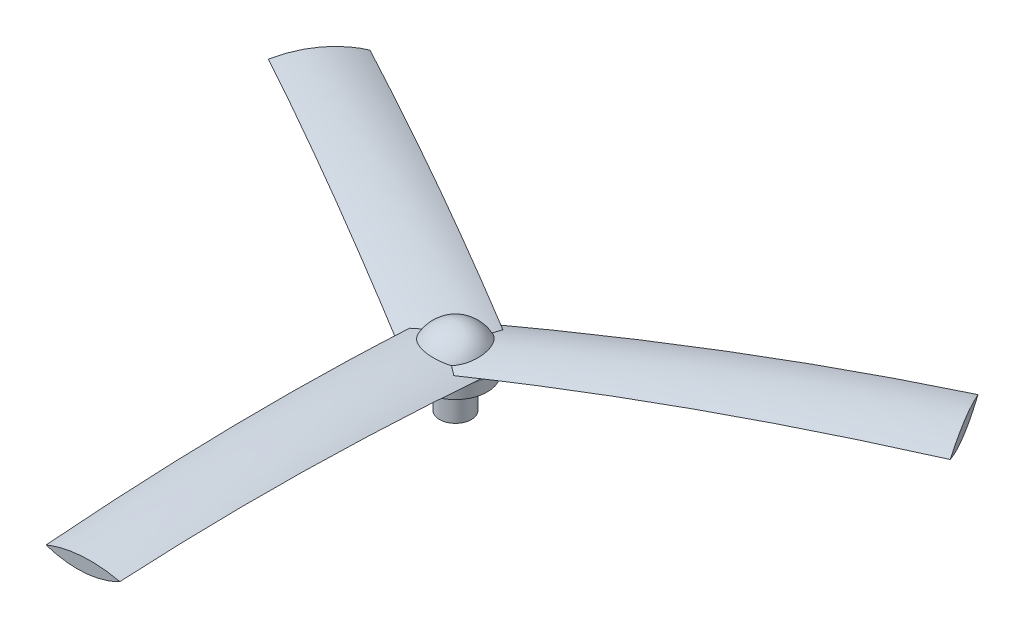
ISO-10303-21;
HEADER;
FILE_DESCRIPTION(('STEP AP214'),'2;1');
FILE_NAME('part.step','',(''),(''),'','','');
FILE_SCHEMA(('AUTOMOTIVE_DESIGN { 1 0 10303 214 1 1 1 1 }'));
ENDSEC;
DATA;
#1=APPLICATION_CONTEXT('core data for automotive mechanical design processes');
#2=APPLICATION_PROTOCOL_DEFINITION('international standard','automotive_design',2000,#1);
#3=PRODUCT_CONTEXT('',#1,'mechanical');
#4=PRODUCT('Part','Part','',(#3));
#5=PRODUCT_RELATED_PRODUCT_CATEGORY('part','',(#4));
#6=PRODUCT_DEFINITION_FORMATION('','',#4);
#7=PRODUCT_DEFINITION_CONTEXT('part definition',#1,'design');
#8=PRODUCT_DEFINITION('design','',#6,#7);
#9=PRODUCT_DEFINITION_SHAPE('','',#8);
#10=(LENGTH_UNIT() NAMED_UNIT(*) SI_UNIT(.MILLI.,.METRE.));
#11=(NAMED_UNIT(*) PLANE_ANGLE_UNIT() SI_UNIT($,.RADIAN.));
#12=(NAMED_UNIT(*) SI_UNIT($,.STERADIAN.) SOLID_ANGLE_UNIT());
#13=UNCERTAINTY_MEASURE_WITH_UNIT(LENGTH_MEASURE(1.E-05),#10,'distance_accuracy_value','');
#14=(GEOMETRIC_REPRESENTATION_CONTEXT(3) GLOBAL_UNCERTAINTY_ASSIGNED_CONTEXT((#13)) GLOBAL_UNIT_ASSIGNED_CONTEXT((#10,
#11,#12)) REPRESENTATION_CONTEXT('',''));
#15=CARTESIAN_POINT('',(0.,0.,0.));
#16=DIRECTION('',(0.,0.,1.));
#17=DIRECTION('',(1.,0.,0.));
#18=AXIS2_PLACEMENT_3D('',#15,#16,#17);
#19=CARTESIAN_POINT('',(0.,7.,0.));
#20=DIRECTION('',(0.,-1.,0.));
#21=DIRECTION('',(1.,0.,0.));
#22=AXIS2_PLACEMENT_3D('',#19,#20,#21);
#23=SPHERICAL_SURFACE('',#22,5.);
#24=CARTESIAN_POINT('',(-2.68634873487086,8.39197255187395,-3.9806962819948));
#25=CARTESIAN_POINT('',(-2.58786244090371,8.39887159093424,-4.04476061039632));
#26=CARTESIAN_POINT('',(-2.48682224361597,8.40747995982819,-4.10470412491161));
#27=CARTESIAN_POINT('',(-2.28043962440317,8.42796885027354,-4.21595957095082));
#28=CARTESIAN_POINT('',(-2.17509807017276,8.43984871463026,-4.26727323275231));
#29=CARTESIAN_POINT('',(-1.96117261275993,8.46670001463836,-4.36077633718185));
#30=CARTESIAN_POINT('',(-1.85259841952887,8.48166286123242,-4.40299047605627));
#31=CARTESIAN_POINT('',(-1.63272901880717,8.51445929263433,-4.4782112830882));
#32=CARTESIAN_POINT('',(-1.52143376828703,8.53229292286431,-4.51121780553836));
#33=CARTESIAN_POINT('',(-1.29696864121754,8.5705210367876,-4.56783244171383));
#34=CARTESIAN_POINT('',(-1.18379964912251,8.59091434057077,-4.59144486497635));
#35=CARTESIAN_POINT('',(-0.956269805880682,8.63392030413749,-4.62921369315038));
#36=CARTESIAN_POINT('',(-0.841908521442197,8.65653379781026,-4.64336652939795));
#37=CARTESIAN_POINT('',(-0.612790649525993,8.70357559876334,-4.6621971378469));
#38=CARTESIAN_POINT('',(-0.498034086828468,8.72800379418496,-4.66687549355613));
#39=CARTESIAN_POINT('',(-0.268790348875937,8.77826068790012,-4.66683168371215));
#40=CARTESIAN_POINT('',(-0.154303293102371,8.80408991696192,-4.66210593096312));
#41=CARTESIAN_POINT('',(0.0763709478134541,8.85732051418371,-4.64316179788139));
#42=CARTESIAN_POINT('',(0.192534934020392,8.88474455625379,-4.62872313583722));
#43=CARTESIAN_POINT('',(0.423170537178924,8.94011901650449,-4.59035086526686));
#44=CARTESIAN_POINT('',(0.537641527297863,8.96806962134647,-4.56641382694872));
#45=CARTESIAN_POINT('',(0.877509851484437,9.05199216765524,-4.48072744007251));
#46=CARTESIAN_POINT('',(1.09952699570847,9.10807369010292,-4.40508882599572));
#47=CARTESIAN_POINT('',(1.54263779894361,9.22019856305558,-4.21380010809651));
#48=CARTESIAN_POINT('',(1.76284350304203,9.27602955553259,-4.09598472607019));
#49=CARTESIAN_POINT('',(2.18268192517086,9.38031128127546,-3.82558829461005));
#50=CARTESIAN_POINT('',(2.38231055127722,9.42876054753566,-3.67300034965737));
#51=CARTESIAN_POINT('',(2.76551571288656,9.51747174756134,-3.32948511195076));
#52=CARTESIAN_POINT('',(2.94790903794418,9.55724632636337,-3.13710139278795));
#53=CARTESIAN_POINT('',(3.19761173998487,9.60689411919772,-2.82795067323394));
#54=CARTESIAN_POINT('',(3.27690493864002,9.62178025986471,-2.72140149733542));
#55=CARTESIAN_POINT('',(3.42706520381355,9.64808564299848,-2.50213157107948));
#56=CARTESIAN_POINT('',(3.49793524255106,9.65950611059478,-2.38941301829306));
#57=CARTESIAN_POINT('',(3.63219552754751,9.67900260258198,-2.15608679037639));
#58=CARTESIAN_POINT('',(3.69539271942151,9.68700163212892,-2.03536175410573));
#59=CARTESIAN_POINT('',(3.81200479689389,9.69928936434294,-1.7891449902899));
#60=CARTESIAN_POINT('',(3.86542317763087,9.70357939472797,-1.66365498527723));
#61=CARTESIAN_POINT('',(3.96208083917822,9.70852830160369,-1.40868470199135));
#62=CARTESIAN_POINT('',(4.00531590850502,9.70918567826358,-1.27920279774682));
#63=CARTESIAN_POINT('',(4.08115927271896,9.70701669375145,-1.01724467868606));
#64=CARTESIAN_POINT('',(4.11377170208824,9.70419169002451,-0.884769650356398));
#65=CARTESIAN_POINT('',(4.16799467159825,9.69529561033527,-0.617855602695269));
#66=CARTESIAN_POINT('',(4.18961820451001,9.68922838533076,-0.483419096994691));
#67=CARTESIAN_POINT('',(4.22159458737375,9.67415713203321,-0.213427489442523));
#68=CARTESIAN_POINT('',(4.23195197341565,9.66515428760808,-0.0778728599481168));
#69=CARTESIAN_POINT('',(4.24114806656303,9.64457333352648,0.193494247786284));
#70=CARTESIAN_POINT('',(4.23998176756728,9.63299410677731,0.329306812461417));
#71=CARTESIAN_POINT('',(4.22591813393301,9.60769299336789,0.600068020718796));
#72=CARTESIAN_POINT('',(4.21302592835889,9.59397204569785,0.735017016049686));
#73=CARTESIAN_POINT('',(4.1758695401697,9.56522882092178,0.999656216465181));
#74=CARTESIAN_POINT('',(4.15190342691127,9.55024859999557,1.12939281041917));
#75=CARTESIAN_POINT('',(4.09268987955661,9.51918019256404,1.38607393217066));
#76=CARTESIAN_POINT('',(4.05744756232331,9.50309251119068,1.51301969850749));
#77=CARTESIAN_POINT('',(3.97572428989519,9.47029874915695,1.76318685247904));
#78=CARTESIAN_POINT('',(3.92924152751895,9.45359256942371,1.88640763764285));
#79=CARTESIAN_POINT('',(3.82522371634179,9.42007853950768,2.12801619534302));
#80=CARTESIAN_POINT('',(3.76769398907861,9.4032707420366,2.24640626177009));
#81=CARTESIAN_POINT('',(3.64517561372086,9.3709209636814,2.47127395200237));
#82=CARTESIAN_POINT('',(3.58074068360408,9.35535898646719,2.57805052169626));
#83=CARTESIAN_POINT('',(3.44258115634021,9.32499131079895,2.7854624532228));
#84=CARTESIAN_POINT('',(3.36886086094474,9.3101852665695,2.88610062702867));
#85=CARTESIAN_POINT('',(3.21260610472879,9.28169355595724,3.08038422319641));
#86=CARTESIAN_POINT('',(3.1300760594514,9.26800733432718,3.17403310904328));
#87=CARTESIAN_POINT('',(2.95680277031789,9.24206421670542,3.35353617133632));
#88=CARTESIAN_POINT('',(2.86606163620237,9.22980695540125,3.4393923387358));
#89=CARTESIAN_POINT('',(2.64155025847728,9.20268731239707,3.63318743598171));
#90=CARTESIAN_POINT('',(2.50438740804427,9.18856716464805,3.7373629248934));
#91=CARTESIAN_POINT('',(2.28966676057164,9.17008326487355,3.88015611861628));
#92=CARTESIAN_POINT('',(2.2166006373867,9.16437154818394,3.92550710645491));
#93=CARTESIAN_POINT('',(2.06771101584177,9.15385616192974,4.01159457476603));
#94=CARTESIAN_POINT('',(1.99188682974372,9.14905272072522,4.05232989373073));
#95=CARTESIAN_POINT('',(1.91482023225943,9.14470966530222,4.0906825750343));
#96=B_SPLINE_CURVE_WITH_KNOTS('',3,(#24,#25,#26,#27,#28,#29,#30,#31,#32,#33,#34,#35,#36,#37,#38,
#39,#40,#41,#42,#43,#44,#45,#46,#47,#48,#49,#50,#51,#52,#53,#54,#55,#56,#57,#58,#59,#60,#61,#62,
#63,#64,#65,#66,#67,#68,#69,#70,#71,#72,#73,#74,#75,#76,#77,#78,#79,#80,#81,#82,#83,#84,#85,#86,
#87,#88,#89,#90,#91,#92,#93,#94,#95),.UNSPECIFIED.,.F.,.F.,(4,2,2,2,2,2,2,2,2,2,2,2,2,2,2,2,2,2,
2,2,2,2,2,2,2,2,2,2,2,2,2,2,2,2,2,4),(0.,0.352956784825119,0.705842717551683,1.05775850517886,
1.40967986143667,1.76143958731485,2.11333194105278,2.4652026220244,2.81720754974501,
3.1774775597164,3.5378777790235,4.25817531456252,5.02255212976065,5.78708065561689,
6.58727320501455,6.98784791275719,7.38828085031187,7.79730327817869,8.20617922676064,
8.6152239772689,9.02410933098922,9.43251010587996,9.84074638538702,10.2491600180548,
10.6573950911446,11.0552303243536,11.452885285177,11.8506042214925,12.2481320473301,
12.6246849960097,13.0010641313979,13.3772554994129,13.7533504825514,14.2702225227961,
14.5286352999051,14.7871129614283),.UNSPECIFIED.);
#97=CARTESIAN_POINT('',(1.57133101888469,9.22744606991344,-4.19158714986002));
#98=VERTEX_POINT('',#97);
#99=CARTESIAN_POINT('',(2.84435544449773,9.22744606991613,3.45660615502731));
#100=VERTEX_POINT('',#99);
#101=EDGE_CURVE('E342',#98,#100,#96,.T.);
#102=ORIENTED_EDGE('',*,*,#101,.F.);
#103=CARTESIAN_POINT('',(-2.10420973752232,8.39197255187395,4.31679438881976));
#104=CARTESIAN_POINT('',(-2.20893422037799,8.39887159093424,4.26353492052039));
#105=CARTESIAN_POINT('',(-2.31136692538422,8.40747995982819,4.20600330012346));
#106=CARTESIAN_POINT('',(-2.51090827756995,8.42796885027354,4.08289843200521));
#107=CARTESIAN_POINT('',(-2.60801798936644,8.43984871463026,4.01732680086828));
#108=CARTESIAN_POINT('',(-2.79595678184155,8.46670001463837,3.87881347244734));
#109=CARTESIAN_POINT('',(-2.88680239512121,8.48166286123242,3.80589253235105));
#110=CARTESIAN_POINT('',(-3.06188022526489,8.51445929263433,3.65309044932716));
#111=CARTESIAN_POINT('',(-3.14611233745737,8.53229292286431,3.57320919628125));
#112=CARTESIAN_POINT('',(-3.30737461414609,8.5705210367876,3.40712401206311));
#113=CARTESIAN_POINT('',(-3.38440806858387,8.59091434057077,3.32092300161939));
#114=CARTESIAN_POINT('',(-3.53088175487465,8.63392030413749,3.14276079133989));
#115=CARTESIAN_POINT('',(-3.6003191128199,8.65653379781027,3.05079743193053));
#116=CARTESIAN_POINT('',(-3.7311858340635,8.70357559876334,2.86179083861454));
#117=CARTESIAN_POINT('',(-3.7926156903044,8.72800379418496,2.76474791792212));
#118=CARTESIAN_POINT('',(-3.90719961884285,8.77826068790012,2.56619511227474));
#119=CARTESIAN_POINT('',(-3.96035052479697,8.80408991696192,2.46468353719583));
#120=CARTESIAN_POINT('',(-4.05928154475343,8.85732051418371,2.25544171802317));
#121=CARTESIAN_POINT('',(-4.10485928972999,8.88474455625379,2.14762142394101));
#122=CARTESIAN_POINT('',(-4.18694573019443,8.94011901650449,1.92869899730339));
#123=CARTESIAN_POINT('',(-4.22345114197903,8.96806962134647,1.81759569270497));
#124=CARTESIAN_POINT('',(-4.31917871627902,9.05199216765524,1.48041789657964));
#125=CARTESIAN_POINT('',(-4.36468232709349,9.10807369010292,1.25032610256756));
#126=CARTESIAN_POINT('',(-4.42057683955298,9.22019856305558,0.770936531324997));
#127=CARTESIAN_POINT('',(-4.42864857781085,9.27602955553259,0.521325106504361));
#128=CARTESIAN_POINT('',(-4.40439761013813,9.38031128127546,0.0225361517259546));
#129=CARTESIAN_POINT('',(-4.37206688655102,9.42876054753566,-0.226641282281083));
#130=CARTESIAN_POINT('',(-4.26617654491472,9.51747174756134,-0.730264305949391));
#131=CARTESIAN_POINT('',(-4.19076401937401,9.55724632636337,-0.98441341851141));
#132=CARTESIAN_POINT('',(-4.04788299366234,9.60689411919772,-1.35523766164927));
#133=CARTESIAN_POINT('',(-3.99525529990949,9.62178025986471,-1.47718217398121));
#134=CARTESIAN_POINT('',(-3.88044210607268,9.64808564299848,-1.71685974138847));
#135=CARTESIAN_POINT('',(-3.81825999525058,9.65950611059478,-1.83459427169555));
#136=CARTESIAN_POINT('',(-3.68332369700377,9.67900260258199,-2.06753020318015));
#137=CARTESIAN_POINT('',(-3.61037134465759,9.68700163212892,-2.18262309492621));
#138=CARTESIAN_POINT('',(-3.45544741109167,9.69928936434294,-2.40672049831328));
#139=CARTESIAN_POINT('',(-3.37347906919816,9.70357939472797,-2.51572717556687));
#140=CARTESIAN_POINT('',(-3.20099715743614,9.70852830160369,-2.72692030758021));
#141=CARTESIAN_POINT('',(-3.11048007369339,9.70918567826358,-2.82910392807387));
#142=CARTESIAN_POINT('',(-2.92153936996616,9.70701669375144,-3.025765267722));
#143=CARTESIAN_POINT('',(-2.82311884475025,9.70419169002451,-3.12024597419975));
#144=CARTESIAN_POINT('',(-2.61907598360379,9.69529561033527,-3.30066146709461));
#145=CARTESIAN_POINT('',(-2.51346232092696,9.68922838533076,-3.38660624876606));
#146=CARTESIAN_POINT('',(-2.29563092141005,9.67415713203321,-3.54929441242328));
#147=CARTESIAN_POINT('',(-2.18341586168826,9.66515428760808,-3.62604148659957));
#148=CARTESIAN_POINT('',(-1.95300309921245,9.64457333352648,-3.76968909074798));
#149=CARTESIAN_POINT('',(-1.83480281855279,9.63299410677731,-3.83658532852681));
#150=CARTESIAN_POINT('',(-1.5932849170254,9.60769299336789,-3.95978646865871));
#151=CARTESIAN_POINT('',(-1.4699695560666,9.59397204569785,-4.01609598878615));
#152=CARTESIAN_POINT('',(-1.22220709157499,9.56522882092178,-4.11623721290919));
#153=CARTESIAN_POINT('',(-1.09786884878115,9.55024859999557,-4.1603502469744));
#154=CARTESIAN_POINT('',(-0.845969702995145,9.51918019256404,-4.23741037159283));
#155=CARTESIAN_POINT('',(-0.718410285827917,9.50309251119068,-4.27036251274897));
#156=CARTESIAN_POINT('',(-0.46089753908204,9.47029874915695,-4.3246716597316));
#157=CARTESIAN_POINT('',(-0.330943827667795,9.45359256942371,-4.34602679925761));
#158=CARTESIAN_POINT('',(-0.0696957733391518,9.42007853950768,-4.37674901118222));
#159=CARTESIAN_POINT('',(0.0615978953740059,9.4032707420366,-4.38612183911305));
#160=CARTESIAN_POINT('',(0.317598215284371,9.3709209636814,-4.39245165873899));
#161=CARTESIAN_POINT('',(0.442286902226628,9.35535898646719,-4.39003765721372));
#162=CARTESIAN_POINT('',(0.690990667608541,9.32499131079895,-4.37409396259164));
#163=CARTESIAN_POINT('',(0.81500603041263,9.3101852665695,-4.3605694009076));
#164=CARTESIAN_POINT('',(1.06138793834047,9.28169355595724,-4.32239061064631));
#165=CARTESIAN_POINT('',(1.18375527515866,9.26800733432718,-4.29774193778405));
#166=CARTESIAN_POINT('',(1.4258461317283,9.24206421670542,-4.23743439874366));
#167=CARTESIAN_POINT('',(1.54557032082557,9.22980695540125,-4.20177835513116));
#168=CARTESIAN_POINT('',(1.82565748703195,9.20268731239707,-4.10424334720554));
#169=CARTESIAN_POINT('',(1.98445753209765,9.18856716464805,-4.03754457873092));
#170=CARTESIAN_POINT('',(2.21548038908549,9.17008326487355,-3.92298764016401));
#171=CARTESIAN_POINT('',(2.29128855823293,9.16437154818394,-3.88238601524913));
#172=CARTESIAN_POINT('',(2.44028730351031,9.15385616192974,-3.79648755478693));
#173=CARTESIAN_POINT('',(2.51347721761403,9.14905272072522,-3.75118954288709));
#174=CARTESIAN_POINT('',(2.58522491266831,9.14470966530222,-3.70362425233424));
#175=B_SPLINE_CURVE_WITH_KNOTS('',3,(#103,#104,#105,#106,#107,#108,#109,#110,#111,#112,#113,
#114,#115,#116,#117,#118,#119,#120,#121,#122,#123,#124,#125,#126,#127,#128,#129,#130,#131,#132,
#133,#134,#135,#136,#137,#138,#139,#140,#141,#142,#143,#144,#145,#146,#147,#148,#149,#150,#151,
#152,#153,#154,#155,#156,#157,#158,#159,#160,#161,#162,#163,#164,#165,#166,#167,#168,#169,#170,
#171,#172,#173,#174),.UNSPECIFIED.,.F.,.F.,(4,2,2,2,2,2,2,2,2,2,2,2,2,2,2,2,2,2,2,2,2,2,2,2,2,2,
2,2,2,2,2,2,2,2,2,4),(0.,0.352956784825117,0.705842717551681,1.05775850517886,1.40967986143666,
1.76143958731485,2.11333194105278,2.4652026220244,2.81720754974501,3.1774775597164,
3.5378777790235,4.25817531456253,5.02255212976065,5.78708065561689,6.58727320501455,
6.98784791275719,7.38828085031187,7.79730327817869,8.20617922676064,8.6152239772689,
9.02410933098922,9.43251010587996,9.84074638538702,10.2491600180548,10.6573950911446,
11.0552303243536,11.452885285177,11.8506042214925,12.2481320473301,12.6246849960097,
13.0010641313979,13.3772554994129,13.7533504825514,14.2702225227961,14.5286352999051,
14.7871129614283),.UNSPECIFIED.);
#176=CARTESIAN_POINT('',(-4.41568646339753,9.22744606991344,0.734980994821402));
#177=VERTEX_POINT('',#176);
#178=EDGE_CURVE('E327',#177,#98,#175,.T.);
#179=ORIENTED_EDGE('',*,*,#178,.F.);
#180=CARTESIAN_POINT('',(4.79055847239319,8.39197255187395,-0.336098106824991));
#181=CARTESIAN_POINT('',(4.79679666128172,8.39887159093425,-0.218774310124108));
#182=CARTESIAN_POINT('',(4.79818916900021,8.40747995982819,-0.101299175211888));
#183=CARTESIAN_POINT('',(4.79134790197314,8.42796885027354,0.133061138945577));
#184=CARTESIAN_POINT('',(4.78311605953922,8.43984871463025,0.249946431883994));
#185=CARTESIAN_POINT('',(4.75712939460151,8.46670001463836,0.481962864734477));
#186=CARTESIAN_POINT('',(4.73940081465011,8.48166286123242,0.597097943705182));
#187=CARTESIAN_POINT('',(4.69460924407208,8.51445929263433,0.82512083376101));
#188=CARTESIAN_POINT('',(4.66754610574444,8.53229292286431,0.93800860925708));
#189=CARTESIAN_POINT('',(4.60434325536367,8.57052103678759,1.16070842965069));
#190=CARTESIAN_POINT('',(4.5682077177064,8.59091434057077,1.27052186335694));
#191=CARTESIAN_POINT('',(4.48715156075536,8.63392030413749,1.48645290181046));
#192=CARTESIAN_POINT('',(4.44222763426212,8.65653379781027,1.59256909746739));
#193=CARTESIAN_POINT('',(4.34397648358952,8.70357559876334,1.80040629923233));
#194=CARTESIAN_POINT('',(4.2906497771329,8.72800379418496,1.90212757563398));
#195=CARTESIAN_POINT('',(4.17598996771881,8.77826068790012,2.10063657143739));
#196=CARTESIAN_POINT('',(4.11465381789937,8.80408991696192,2.19742239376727));
#197=CARTESIAN_POINT('',(3.98291059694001,8.85732051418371,2.38772007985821));
#198=CARTESIAN_POINT('',(3.91232435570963,8.88474455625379,2.48110171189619));
#199=CARTESIAN_POINT('',(3.76377519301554,8.94011901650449,2.66165186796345));
#200=CARTESIAN_POINT('',(3.6858096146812,8.96806962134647,2.74881813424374));
#201=CARTESIAN_POINT('',(3.44166886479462,9.05199216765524,3.00030954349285));
#202=CARTESIAN_POINT('',(3.26515533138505,9.10807369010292,3.15476272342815));
#203=CARTESIAN_POINT('',(2.87793904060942,9.22019856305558,3.4428635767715));
#204=CARTESIAN_POINT('',(2.66580507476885,9.27602955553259,3.57465961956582));
#205=CARTESIAN_POINT('',(2.2217156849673,9.38031128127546,3.8030521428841));
#206=CARTESIAN_POINT('',(1.98975633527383,9.42876054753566,3.89964163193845));
#207=CARTESIAN_POINT('',(1.5006608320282,9.51747174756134,4.05974941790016));
#208=CARTESIAN_POINT('',(1.24285498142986,9.55724632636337,4.12151481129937));
#209=CARTESIAN_POINT('',(0.8502712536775,9.60689411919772,4.18318833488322));
#210=CARTESIAN_POINT('',(0.71835036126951,9.62178025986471,4.19858367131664));
#211=CARTESIAN_POINT('',(0.453376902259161,9.64808564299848,4.21899131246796));
#212=CARTESIAN_POINT('',(0.32032475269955,9.65950611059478,4.22400728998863));
#213=CARTESIAN_POINT('',(0.0511281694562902,9.67900260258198,4.22361699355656));
#214=CARTESIAN_POINT('',(-0.0850213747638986,9.68700163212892,4.21798484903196));
#215=CARTESIAN_POINT('',(-0.35655738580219,9.69928936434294,4.1958654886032));
#216=CARTESIAN_POINT('',(-0.491944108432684,9.70357939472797,4.17938216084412));
#217=CARTESIAN_POINT('',(-0.761083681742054,9.70852830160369,4.13560500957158));
#218=CARTESIAN_POINT('',(-0.8948358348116,9.70918567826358,4.10830672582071));
#219=CARTESIAN_POINT('',(-1.15961990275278,9.70701669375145,4.04300994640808));
#220=CARTESIAN_POINT('',(-1.29065285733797,9.70419169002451,4.00501562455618));
#221=CARTESIAN_POINT('',(-1.54891868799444,9.69529561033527,3.91851706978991));
#222=CARTESIAN_POINT('',(-1.67615588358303,9.68922838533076,3.87002534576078));
#223=CARTESIAN_POINT('',(-1.92596366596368,9.67415713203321,3.76272190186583));
#224=CARTESIAN_POINT('',(-2.04853611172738,9.66515428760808,3.70391434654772));
#225=CARTESIAN_POINT('',(-2.28814496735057,9.64457333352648,3.57619484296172));
#226=CARTESIAN_POINT('',(-2.40517894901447,9.63299410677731,3.50727851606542));
#227=CARTESIAN_POINT('',(-2.6326332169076,9.60769299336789,3.35971844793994));
#228=CARTESIAN_POINT('',(-2.74305637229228,9.59397204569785,3.2810789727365));
#229=CARTESIAN_POINT('',(-2.9536624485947,9.56522882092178,3.11658099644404));
#230=CARTESIAN_POINT('',(-3.05403457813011,9.55024859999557,3.03095743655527));
#231=CARTESIAN_POINT('',(-3.24672017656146,9.51918019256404,2.8513364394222));
#232=CARTESIAN_POINT('',(-3.33903727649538,9.50309251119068,2.75734281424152));
#233=CARTESIAN_POINT('',(-3.51482675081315,9.47029874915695,2.5614848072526));
#234=CARTESIAN_POINT('',(-3.59829769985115,9.45359256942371,2.45961916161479));
#235=CARTESIAN_POINT('',(-3.75552794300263,9.42007853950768,2.24873281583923));
#236=CARTESIAN_POINT('',(-3.82929188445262,9.4032707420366,2.139715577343));
#237=CARTESIAN_POINT('',(-3.96277382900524,9.3709209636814,1.92117770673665));
#238=CARTESIAN_POINT('',(-4.02302758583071,9.35535898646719,1.8119871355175));
#239=CARTESIAN_POINT('',(-4.13357182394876,9.32499131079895,1.58863150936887));
#240=CARTESIAN_POINT('',(-4.18386689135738,9.3101852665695,1.47446877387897));
#241=CARTESIAN_POINT('',(-4.27399404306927,9.28169355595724,1.24200638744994));
#242=CARTESIAN_POINT('',(-4.31383133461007,9.26800733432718,1.12370882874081));
#243=CARTESIAN_POINT('',(-4.38264890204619,9.24206421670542,0.883898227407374));
#244=CARTESIAN_POINT('',(-4.41163195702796,9.22980695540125,0.762386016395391));
#245=CARTESIAN_POINT('',(-4.46720774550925,9.20268731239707,0.47105591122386));
#246=CARTESIAN_POINT('',(-4.48884494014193,9.18856716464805,0.300181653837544));
#247=CARTESIAN_POINT('',(-4.50514714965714,9.17008326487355,0.0428315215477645));
#248=CARTESIAN_POINT('',(-4.50788919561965,9.16437154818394,-0.04312109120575));
#249=CARTESIAN_POINT('',(-4.5079983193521,9.15385616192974,-0.21510701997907));
#250=CARTESIAN_POINT('',(-4.50536404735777,9.14905272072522,-0.301140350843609));
#251=CARTESIAN_POINT('',(-4.50004514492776,9.14470966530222,-0.387058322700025));
#252=B_SPLINE_CURVE_WITH_KNOTS('',3,(#180,#181,#182,#183,#184,#185,#186,#187,#188,#189,#190,
#191,#192,#193,#194,#195,#196,#197,#198,#199,#200,#201,#202,#203,#204,#205,#206,#207,#208,#209,
#210,#211,#212,#213,#214,#215,#216,#217,#218,#219,#220,#221,#222,#223,#224,#225,#226,#227,#228,
#229,#230,#231,#232,#233,#234,#235,#236,#237,#238,#239,#240,#241,#242,#243,#244,#245,#246,#247,
#248,#249,#250,#251),.UNSPECIFIED.,.F.,.F.,(4,2,2,2,2,2,2,2,2,2,2,2,2,2,2,2,2,2,2,2,2,2,2,2,2,2,
2,2,2,2,2,2,2,2,2,4),(0.,0.352956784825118,0.705842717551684,1.05775850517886,1.40967986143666,
1.76143958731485,2.11333194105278,2.4652026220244,2.81720754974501,3.1774775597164,
3.53787777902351,4.25817531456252,5.02255212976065,5.78708065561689,6.58727320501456,
6.98784791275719,7.38828085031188,7.7973032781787,8.20617922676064,8.6152239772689,
9.02410933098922,9.43251010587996,9.84074638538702,10.2491600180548,10.6573950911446,
11.0552303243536,11.452885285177,11.8506042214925,12.2481320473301,12.6246849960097,
13.0010641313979,13.3772554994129,13.7533504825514,14.2702225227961,14.5286352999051,
14.7871129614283),.UNSPECIFIED.);
#253=EDGE_CURVE('E312',#100,#177,#252,.T.);
#254=ORIENTED_EDGE('',*,*,#253,.F.);
#255=EDGE_LOOP('',(#102,#179,#254));
#256=FACE_BOUND('',#255,.T.);
#257=ADVANCED_FACE('F112',(#256),#23,.T.);
#258=CARTESIAN_POINT('',(2.11430569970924,8.34976384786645,4.32525709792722));
#259=CARTESIAN_POINT('',(2.23797903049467,8.36111587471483,4.26127695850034));
#260=CARTESIAN_POINT('',(2.35934674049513,8.3699598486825,4.19240389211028));
#261=CARTESIAN_POINT('',(2.59660195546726,8.38268310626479,4.04540706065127));
#262=CARTESIAN_POINT('',(2.7124899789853,8.38656286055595,3.96728417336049));
#263=CARTESIAN_POINT('',(2.93780273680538,8.38940948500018,3.80241142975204));
#264=CARTESIAN_POINT('',(3.04723520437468,8.38838235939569,3.71567224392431));
#265=CARTESIAN_POINT('',(3.25897702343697,8.3816345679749,3.53406523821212));
#266=CARTESIAN_POINT('',(3.36128639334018,8.37591391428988,3.43919743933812));
#267=CARTESIAN_POINT('',(3.55802002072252,8.36008690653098,3.24193257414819));
#268=CARTESIAN_POINT('',(3.65244353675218,8.3499801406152,3.1395348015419));
#269=CARTESIAN_POINT('',(3.83270752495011,8.32578798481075,2.92781870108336));
#270=CARTESIAN_POINT('',(3.91854479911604,8.31170111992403,2.8184978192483));
#271=CARTESIAN_POINT('',(4.08090025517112,8.28005474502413,2.59368107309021));
#272=CARTESIAN_POINT('',(4.15742194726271,8.26249654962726,2.47818755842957));
#273=CARTESIAN_POINT('',(4.30060620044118,8.22446691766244,2.24164004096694));
#274=CARTESIAN_POINT('',(4.36726508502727,8.20399440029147,2.12058398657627));
#275=CARTESIAN_POINT('',(4.49051965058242,8.16063680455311,1.87293195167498));
#276=CARTESIAN_POINT('',(4.54705218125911,8.13773791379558,1.74630695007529));
#277=CARTESIAN_POINT('',(4.64909315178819,8.09029982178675,1.48893011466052));
#278=CARTESIAN_POINT('',(4.69459747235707,8.06576001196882,1.35817675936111));
#279=CARTESIAN_POINT('',(4.77413487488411,8.01575786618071,1.09343313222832));
#280=CARTESIAN_POINT('',(4.8081708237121,7.99029576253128,0.959443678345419));
#281=CARTESIAN_POINT('',(4.86446622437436,7.93914002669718,0.689001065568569));
#282=CARTESIAN_POINT('',(4.88672140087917,7.9134463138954,0.552547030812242));
#283=CARTESIAN_POINT('',(4.91906965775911,7.8627167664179,0.279142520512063));
#284=CARTESIAN_POINT('',(4.92925169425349,7.83767746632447,0.142203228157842));
#285=CARTESIAN_POINT('',(4.93760034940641,7.78870855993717,-0.132241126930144));
#286=CARTESIAN_POINT('',(4.93576710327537,7.76477894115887,-0.26974618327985));
#287=CARTESIAN_POINT('',(4.92003164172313,7.7186357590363,-0.544325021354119));
#288=CARTESIAN_POINT('',(4.90613206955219,7.69642182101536,-0.68139889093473));
#289=CARTESIAN_POINT('',(4.86631407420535,7.65424362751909,-0.9541435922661));
#290=CARTESIAN_POINT('',(4.84039574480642,7.63427935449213,-1.0898144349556));
#291=CARTESIAN_POINT('',(4.7777464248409,7.59767363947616,-1.35429153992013));
#292=CARTESIAN_POINT('',(4.74139956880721,7.58094443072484,-1.4831767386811));
#293=CARTESIAN_POINT('',(4.65785495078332,7.55033603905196,-1.73772670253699));
#294=CARTESIAN_POINT('',(4.61065756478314,7.53645675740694,-1.86339157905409));
#295=CARTESIAN_POINT('',(4.50575566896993,7.51177437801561,-2.11055120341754));
#296=CARTESIAN_POINT('',(4.44805245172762,7.50097090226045,-2.23204646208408));
#297=CARTESIAN_POINT('',(4.32256488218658,7.48256447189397,-2.4699669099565));
#298=CARTESIAN_POINT('',(4.25478065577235,7.47496147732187,-2.58639216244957));
#299=CARTESIAN_POINT('',(4.11162132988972,7.46314418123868,-2.81020759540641));
#300=CARTESIAN_POINT('',(4.03650257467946,7.45884340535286,-2.91775732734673));
#301=CARTESIAN_POINT('',(3.8777298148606,7.45322503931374,-3.12650084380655));
#302=CARTESIAN_POINT('',(3.79407291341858,7.45190846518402,-3.22769245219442));
#303=CARTESIAN_POINT('',(3.61888245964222,7.45210825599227,-3.42293506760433));
#304=CARTESIAN_POINT('',(3.52735191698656,7.4536235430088,-3.51698877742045));
#305=CARTESIAN_POINT('',(3.3370045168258,7.45924320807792,-3.69739165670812));
#306=CARTESIAN_POINT('',(3.23818508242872,7.4633485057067,-3.78373807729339));
#307=CARTESIAN_POINT('',(3.03331445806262,7.47385840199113,-3.94865724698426));
#308=CARTESIAN_POINT('',(2.92722047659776,7.48027775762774,-4.02717587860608));
#309=CARTESIAN_POINT('',(2.70910702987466,7.49502138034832,-4.17529959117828));
#310=CARTESIAN_POINT('',(2.59708739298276,7.50334570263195,-4.24490441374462));
#311=CARTESIAN_POINT('',(2.36784208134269,7.52146164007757,-4.37479658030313));
#312=CARTESIAN_POINT('',(2.25061486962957,7.53125369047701,-4.43508114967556));
#313=CARTESIAN_POINT('',(2.01178816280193,7.55182234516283,-4.54594700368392));
#314=CARTESIAN_POINT('',(1.8901899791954,7.56259865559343,-4.59653117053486));
#315=CARTESIAN_POINT('',(1.6392343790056,7.58500578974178,-4.68927450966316));
#316=CARTESIAN_POINT('',(1.50975345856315,7.59665313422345,-4.73109571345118));
#317=CARTESIAN_POINT('',(1.2478192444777,7.61989172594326,-4.80388259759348));
#318=CARTESIAN_POINT('',(1.11536692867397,7.63148299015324,-4.83485179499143));
#319=CARTESIAN_POINT('',(0.848257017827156,7.65405059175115,-4.88582639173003));
#320=CARTESIAN_POINT('',(0.713598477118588,7.66502665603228,-4.90582695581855));
#321=CARTESIAN_POINT('',(0.443057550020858,7.68580552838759,-4.93477258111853));
#322=CARTESIAN_POINT('',(0.307175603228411,7.69560874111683,-4.94372146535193));
#323=CARTESIAN_POINT('',(0.0312996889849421,7.71377620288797,-4.95067505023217));
#324=CARTESIAN_POINT('',(-0.108705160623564,7.72209379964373,-4.94837394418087));
#325=CARTESIAN_POINT('',(-0.388112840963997,7.73644268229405,-4.93220514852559));
#326=CARTESIAN_POINT('',(-0.527515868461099,7.74247478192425,-4.91834158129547));
#327=CARTESIAN_POINT('',(-0.804829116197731,7.75182134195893,-4.8792058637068));
#328=CARTESIAN_POINT('',(-0.942739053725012,7.75513529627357,-4.85393159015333));
#329=CARTESIAN_POINT('',(-1.21601962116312,7.75868885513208,-4.79221258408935));
#330=CARTESIAN_POINT('',(-1.35139136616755,7.75892984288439,-4.75577288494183));
#331=CARTESIAN_POINT('',(-1.59393286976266,7.75634974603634,-4.67978024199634));
#332=CARTESIAN_POINT('',(-1.70168487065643,7.75408717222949,-4.64205193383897));
#333=CARTESIAN_POINT('',(-1.91438286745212,7.74726981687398,-4.5595773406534));
#334=CARTESIAN_POINT('',(-2.01932924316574,7.74271534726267,-4.51483201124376));
#335=CARTESIAN_POINT('',(-2.22587947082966,7.73127644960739,-4.41856326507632));
#336=CARTESIAN_POINT('',(-2.32748471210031,7.72439300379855,-4.3670427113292));
#337=CARTESIAN_POINT('',(-2.52693373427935,7.70831926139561,-4.25745478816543));
#338=CARTESIAN_POINT('',(-2.62477688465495,7.69912858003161,-4.19938632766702));
#339=CARTESIAN_POINT('',(-2.72048930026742,7.68879721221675,-4.13817548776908));
#340=B_SPLINE_CURVE_WITH_KNOTS('',3,(#258,#259,#260,#261,#262,#263,#264,#265,#266,#267,#268,
#269,#270,#271,#272,#273,#274,#275,#276,#277,#278,#279,#280,#281,#282,#283,#284,#285,#286,#287,
#288,#289,#290,#291,#292,#293,#294,#295,#296,#297,#298,#299,#300,#301,#302,#303,#304,#305,#306,
#307,#308,#309,#310,#311,#312,#313,#314,#315,#316,#317,#318,#319,#320,#321,#322,#323,#324,#325,
#326,#327,#328,#329,#330,#331,#332,#333,#334,#335,#336,#337,#338,#339),.UNSPECIFIED.,.F.,.F.,(4,
2,2,2,2,2,2,2,2,2,2,2,2,2,2,2,2,2,2,2,2,2,2,2,2,2,2,2,2,2,2,2,2,2,2,2,2,2,2,2,4),(0.,
0.418982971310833,0.837926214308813,1.25635695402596,1.67478661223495,2.09325556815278,
2.51187980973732,2.93034581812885,3.34896742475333,3.77011506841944,4.19141977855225,
4.61261909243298,5.03397115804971,5.45219897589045,5.87042208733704,6.28855360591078,
6.70668186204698,7.1110422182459,7.5153885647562,7.9196851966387,8.3239767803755,
8.7172815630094,9.11072023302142,9.50400917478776,9.89743783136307,10.2934211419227,
10.6894159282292,11.0855283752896,11.48152294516,11.8907485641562,12.2998414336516,
12.7091144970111,13.1182459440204,13.5385595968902,13.9587234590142,14.3789655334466,
14.7990184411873,15.1413226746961,15.483580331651,15.8256938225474,16.1678644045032),.UNSPECIFIED.);
#341=CARTESIAN_POINT('',(4.93150622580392,7.82271564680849,0.0581834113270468));
#342=VERTEX_POINT('',#341);
#343=CARTESIAN_POINT('',(-2.41715306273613,7.71716239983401,-4.31775973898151));
#344=VERTEX_POINT('',#343);
#345=EDGE_CURVE('E289',#342,#344,#340,.T.);
#346=ORIENTED_EDGE('',*,*,#345,.F.);
#347=CARTESIAN_POINT('',(3.05427661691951E-06,7.00806107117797,0.115279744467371));
#348=DIRECTION('',(2.64299396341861E-05,0.0697558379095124,0.997564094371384));
#349=DIRECTION('',(0.,-0.997564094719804,0.0697558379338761));
#350=AXIS2_PLACEMENT_3D('',#347,#348,#349);
#351=CIRCLE('',#350,4.99866438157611);
#352=CARTESIAN_POINT('',(4.94786615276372,7.71716239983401,0.0655639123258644));
#353=VERTEX_POINT('',#352);
#354=EDGE_CURVE('E517',#342,#353,#351,.F.);
#355=ORIENTED_EDGE('',*,*,#354,.T.);
#356=CARTESIAN_POINT('',(-4.80293537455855,8.34976384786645,-0.33158610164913));
#357=CARTESIAN_POINT('',(-4.80936361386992,8.36111587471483,-0.192491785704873));
#358=CARTESIAN_POINT('',(-4.81040164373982,8.36995984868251,-0.0529477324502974));
#359=CARTESIAN_POINT('',(-4.80172626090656,8.38268310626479,0.226019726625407));
#360=CARTESIAN_POINT('',(-4.79201386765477,8.38656286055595,0.365443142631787));
#361=CARTESIAN_POINT('',(-4.76188626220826,8.38940948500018,0.643006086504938));
#362=CARTESIAN_POINT('',(-4.74148415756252,8.38838235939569,0.781146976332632));
#363=CARTESIAN_POINT('',(-4.69007878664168,8.3816345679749,1.0553242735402));
#364=CARTESIAN_POINT('',(-4.65907554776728,8.37591391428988,1.19136068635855));
#365=CARTESIAN_POINT('',(-4.58660597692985,8.36008690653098,1.46036943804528));
#366=CARTESIAN_POINT('',(-4.5451386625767,8.3499801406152,1.59334148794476));
#367=CARTESIAN_POINT('',(-4.45191913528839,8.32578798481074,1.85531273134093));
#368=CARTESIAN_POINT('',(-4.40016311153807,8.31170111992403,1.98431043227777));
#369=CARTESIAN_POINT('',(-4.28664382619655,8.28005474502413,2.23732275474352));
#370=CARTESIAN_POINT('',(-4.22488435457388,8.26249654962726,2.36133924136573));
#371=CARTESIAN_POINT('',(-4.09162032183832,8.22446691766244,2.6036142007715));
#372=CARTESIAN_POINT('',(-4.02011214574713,8.20399440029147,2.72187051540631));
#373=CARTESIAN_POINT('',(-3.86726647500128,8.16063680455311,2.95243811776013));
#374=CARTESIAN_POINT('',(-3.78587227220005,8.13773791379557,3.06470922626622));
#375=CARTESIAN_POINT('',(-3.61399787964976,8.09029982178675,3.28176771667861));
#376=CARTESIAN_POINT('',(-3.52351431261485,8.06576001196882,3.38655229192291));
#377=CARTESIAN_POINT('',(-3.33400830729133,8.01575786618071,3.58780551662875));
#378=CARTESIAN_POINT('',(-3.23498801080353,7.99029576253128,3.68427623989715));
#379=CARTESIAN_POINT('',(-3.02892553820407,7.93914002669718,3.86825079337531));
#380=CARTESIAN_POINT('',(-2.92188046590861,7.9134463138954,3.95575135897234));
#381=CARTESIAN_POINT('',(-2.70127934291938,7.8627167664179,4.12046802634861));
#382=CARTESIAN_POINT('',(-2.58777745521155,7.83767746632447,4.19775557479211));
#383=CARTESIAN_POINT('',(-2.35427599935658,7.78870855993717,4.34220789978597));
#384=CARTESIAN_POINT('',(-2.2342765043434,7.76477894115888,4.40937279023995));
#385=CARTESIAN_POINT('',(-1.98861652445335,7.7186357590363,4.53303489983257));
#386=CARTESIAN_POINT('',(-1.86295728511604,7.69642182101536,4.5895344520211));
#387=CARTESIAN_POINT('',(-1.60684444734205,7.65424362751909,4.69142340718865));
#388=CARTESIAN_POINT('',(-1.47639088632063,7.63427935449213,4.73681289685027));
#389=CARTESIAN_POINT('',(-1.21602233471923,7.59767363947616,4.81479554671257));
#390=CARTESIAN_POINT('',(-1.08623105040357,7.58094443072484,4.84776084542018));
#391=CARTESIAN_POINT('',(-0.824012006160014,7.55033603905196,4.90268406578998));
#392=CARTESIAN_POINT('',(-0.691584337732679,7.53645675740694,4.92464236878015));
#393=CARTESIAN_POINT('',(-0.42508687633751,7.51177437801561,4.95737447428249));
#394=CARTESIAN_POINT('',(-0.291017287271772,7.50097090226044,4.96814965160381));
#395=CARTESIAN_POINT('',(-0.0222283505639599,7.48256447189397,4.97843445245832));
#396=CARTESIAN_POINT('',(0.112490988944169,7.47496147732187,4.97794421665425));
#397=CARTESIAN_POINT('',(0.377900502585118,7.46314418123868,4.96587232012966));
#398=CARTESIAN_POINT('',(0.508600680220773,7.45884340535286,4.95459243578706));
#399=CARTESIAN_POINT('',(0.7687642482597,7.45322503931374,4.92146295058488));
#400=CARTESIAN_POINT('',(0.898227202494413,7.45190846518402,4.89960975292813));
#401=CARTESIAN_POINT('',(1.15490749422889,7.45210825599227,4.84551167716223));
#402=CARTESIAN_POINT('',(1.28212566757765,7.4536235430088,4.81327075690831));
#403=CARTESIAN_POINT('',(1.53353284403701,7.45924320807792,4.73862651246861));
#404=CARTESIAN_POINT('',(1.65772075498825,7.4633485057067,4.69621958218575));
#405=CARTESIAN_POINT('',(1.90298025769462,7.47385840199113,4.60125600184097));
#406=CARTESIAN_POINT('',(2.02402637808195,7.48027775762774,4.54863523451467));
#407=CARTESIAN_POINT('',(2.26136199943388,7.49502138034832,4.43380530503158));
#408=CARTESIAN_POINT('',(2.37765136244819,7.50334570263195,4.37159586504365));
#409=CARTESIAN_POINT('',(2.60476393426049,7.52146164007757,4.23800968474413));
#410=CARTESIAN_POINT('',(2.71558550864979,7.53125369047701,4.16663022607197));
#411=CARTESIAN_POINT('',(2.9310115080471,7.55182234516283,4.01523315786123));
#412=CARTESIAN_POINT('',(3.03561777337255,7.56259865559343,3.93521812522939));
#413=CARTESIAN_POINT('',(3.24141366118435,7.58500578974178,3.76425586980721));
#414=CARTESIAN_POINT('',(3.34237234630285,7.59665313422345,3.67303270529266));
#415=CARTESIAN_POINT('',(3.53637474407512,7.61989172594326,3.4825844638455));
#416=CARTESIAN_POINT('',(3.62942101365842,7.63148299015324,3.38336199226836));
#417=CARTESIAN_POINT('',(3.80712126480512,7.65405059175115,3.17752532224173));
#418=CARTESIAN_POINT('',(3.89177153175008,7.66502665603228,3.07090788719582));
#419=CARTESIAN_POINT('',(4.05210964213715,7.68580552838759,2.85108538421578));
#420=CARTESIAN_POINT('',(4.12780057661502,7.69560874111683,2.73788260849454));
#421=CARTESIAN_POINT('',(4.27176051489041,7.71377620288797,2.50244385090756));
#422=CARTESIAN_POINT('',(4.33977012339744,7.72209379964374,2.38004554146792));
#423=CARTESIAN_POINT('',(4.46547137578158,7.73644268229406,2.12998699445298));
#424=CARTESIAN_POINT('',(4.52316668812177,7.74247478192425,2.00232864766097));
#425=CARTESIAN_POINT('',(4.62793078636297,7.75182134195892,1.74260047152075));
#426=CARTESIAN_POINT('',(4.6749975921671,7.75513529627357,1.61052982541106));
#427=CARTESIAN_POINT('',(4.75818764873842,7.75868885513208,1.34300240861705));
#428=CARTESIAN_POINT('',(4.79431581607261,7.75892984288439,1.20754718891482));
#429=CARTESIAN_POINT('',(4.84977500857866,7.75634974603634,0.959503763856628));
#430=CARTESIAN_POINT('',(4.87097733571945,7.75408717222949,0.847323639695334));
#431=CARTESIAN_POINT('',(4.9059012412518,7.74726981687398,0.621884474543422));
#432=CARTESIAN_POINT('',(4.91962383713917,7.74271534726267,0.508625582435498));
#433=CARTESIAN_POINT('',(4.93952777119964,7.73127644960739,0.281613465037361));
#434=CARTESIAN_POINT('',(4.94571228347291,7.72439300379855,0.167860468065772));
#435=CARTESIAN_POINT('',(4.95053086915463,7.70831926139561,-0.0596614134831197));
#436=CARTESIAN_POINT('',(4.94916368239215,7.69912858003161,-0.173430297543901));
#437=CARTESIAN_POINT('',(4.94400974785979,7.68879721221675,-0.28692510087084));
#438=B_SPLINE_CURVE_WITH_KNOTS('',3,(#356,#357,#358,#359,#360,#361,#362,#363,#364,#365,#366,
#367,#368,#369,#370,#371,#372,#373,#374,#375,#376,#377,#378,#379,#380,#381,#382,#383,#384,#385,
#386,#387,#388,#389,#390,#391,#392,#393,#394,#395,#396,#397,#398,#399,#400,#401,#402,#403,#404,
#405,#406,#407,#408,#409,#410,#411,#412,#413,#414,#415,#416,#417,#418,#419,#420,#421,#422,#423,
#424,#425,#426,#427,#428,#429,#430,#431,#432,#433,#434,#435,#436,#437),.UNSPECIFIED.,.F.,.F.,(4,
2,2,2,2,2,2,2,2,2,2,2,2,2,2,2,2,2,2,2,2,2,2,2,2,2,2,2,2,2,2,2,2,2,2,2,2,2,2,2,4),(0.,
0.418982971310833,0.837926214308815,1.25635695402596,1.67478661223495,2.09325556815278,
2.51187980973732,2.93034581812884,3.34896742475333,3.77011506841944,4.19141977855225,
4.61261909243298,5.03397115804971,5.45219897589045,5.87042208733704,6.28855360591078,
6.70668186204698,7.1110422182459,7.5153885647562,7.9196851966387,8.3239767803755,
8.7172815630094,9.11072023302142,9.50400917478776,9.89743783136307,10.2934211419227,
10.6894159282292,11.0855283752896,11.48152294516,11.8907485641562,12.2998414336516,
12.7091144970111,13.1182459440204,13.5385595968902,13.9587234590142,14.3789655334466,
14.7990184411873,15.1413226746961,15.483580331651,15.8256938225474,16.1678644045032),.UNSPECIFIED.);
#439=CARTESIAN_POINT('',(-2.51614142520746,7.8227156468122,4.24171796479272));
#440=VERTEX_POINT('',#439);
#441=EDGE_CURVE('E320',#440,#353,#438,.T.);
#442=ORIENTED_EDGE('',*,*,#441,.F.);
#443=CARTESIAN_POINT('',(-0.0998367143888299,7.00806107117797,-0.0576372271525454));
#444=DIRECTION('',(-0.863929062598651,0.0697558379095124,-0.498759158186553));
#445=DIRECTION('',(-0.499977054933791,0.,0.866038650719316));
#446=AXIS2_PLACEMENT_3D('',#443,#444,#445);
#447=CIRCLE('',#446,4.99866438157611);
#448=CARTESIAN_POINT('',(-2.53071309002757,7.71716239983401,4.25219582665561));
#449=VERTEX_POINT('',#448);
#450=EDGE_CURVE('E515',#440,#449,#447,.F.);
#451=ORIENTED_EDGE('',*,*,#450,.T.);
#452=CARTESIAN_POINT('',(2.68862967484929,8.34976384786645,-3.99367099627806));
#453=CARTESIAN_POINT('',(2.57138458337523,8.36111587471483,-4.06878517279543));
#454=CARTESIAN_POINT('',(2.45105490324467,8.3699598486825,-4.13945615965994));
#455=CARTESIAN_POINT('',(2.20512430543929,8.38268310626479,-4.27142678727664));
#456=CARTESIAN_POINT('',(2.07952388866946,8.38656286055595,-4.33272731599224));
#457=CARTESIAN_POINT('',(1.82408352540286,8.38940948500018,-4.44541751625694));
#458=CARTESIAN_POINT('',(1.69424895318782,8.38838235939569,-4.49681922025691));
#459=CARTESIAN_POINT('',(1.4311017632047,8.3816345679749,-4.58938951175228));
#460=CARTESIAN_POINT('',(1.2977891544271,8.37591391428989,-4.63055812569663));
#461=CARTESIAN_POINT('',(1.02858595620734,8.36008690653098,-4.70230201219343));
#462=CARTESIAN_POINT('',(0.892695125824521,8.3499801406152,-4.73287628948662));
#463=CARTESIAN_POINT('',(0.619211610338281,8.32578798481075,-4.78313143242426));
#464=CARTESIAN_POINT('',(0.481618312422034,8.31170111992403,-4.80280825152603));
#465=CARTESIAN_POINT('',(0.205743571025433,8.28005474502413,-4.83100382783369));
#466=CARTESIAN_POINT('',(0.0674624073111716,8.26249654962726,-4.83952679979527));
#467=CARTESIAN_POINT('',(-0.208985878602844,8.22446691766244,-4.8452542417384));
#468=CARTESIAN_POINT('',(-0.347152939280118,8.20399440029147,-4.84245450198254));
#469=CARTESIAN_POINT('',(-0.623253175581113,8.16063680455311,-4.82537006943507));
#470=CARTESIAN_POINT('',(-0.761179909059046,8.13773791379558,-4.81101617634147));
#471=CARTESIAN_POINT('',(-1.03509527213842,8.09029982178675,-4.7706978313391));
#472=CARTESIAN_POINT('',(-1.1710831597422,8.06576001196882,-4.74472905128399));
#473=CARTESIAN_POINT('',(-1.44012656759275,8.0157578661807,-4.68123864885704));
#474=CARTESIAN_POINT('',(-1.57318281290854,7.99029576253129,-4.64371991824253));
#475=CARTESIAN_POINT('',(-1.83554068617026,7.93914002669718,-4.55725185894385));
#476=CARTESIAN_POINT('',(-1.96484093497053,7.91344631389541,-4.50829838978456));
#477=CARTESIAN_POINT('',(-2.2177903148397,7.8627167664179,-4.39961054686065));
#478=CARTESIAN_POINT('',(-2.34147423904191,7.83767746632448,-4.33995880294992));
#479=CARTESIAN_POINT('',(-2.5833243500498,7.78870855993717,-4.2099667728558));
#480=CARTESIAN_POINT('',(-2.70149059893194,7.76477894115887,-4.13962660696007));
#481=CARTESIAN_POINT('',(-2.93141511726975,7.7186357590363,-3.98870987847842));
#482=CARTESIAN_POINT('',(-3.04317478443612,7.69642182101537,-3.90813556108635));
#483=CARTESIAN_POINT('',(-3.25946962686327,7.65424362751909,-3.73727981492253));
#484=CARTESIAN_POINT('',(-3.36400485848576,7.63427935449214,-3.64699846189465));
#485=CARTESIAN_POINT('',(-3.56172409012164,7.59767363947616,-3.46050400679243));
#486=CARTESIAN_POINT('',(-3.6551685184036,7.58094443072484,-3.36458410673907));
#487=CARTESIAN_POINT('',(-3.83384294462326,7.55033603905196,-3.16495736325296));
#488=CARTESIAN_POINT('',(-3.91907322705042,7.53645675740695,-3.06125078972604));
#489=CARTESIAN_POINT('',(-4.08066879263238,7.51177437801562,-2.84682327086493));
#490=CARTESIAN_POINT('',(-4.1570351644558,7.50097090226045,-2.73610318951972));
#491=CARTESIAN_POINT('',(-4.30033653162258,7.48256447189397,-2.5084675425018));
#492=CARTESIAN_POINT('',(-4.36727164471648,7.47496147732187,-2.39155205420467));
#493=CARTESIAN_POINT('',(-4.4895218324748,7.46314418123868,-2.15566472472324));
#494=CARTESIAN_POINT('',(-4.54510325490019,7.45884340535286,-2.03683510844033));
#495=CARTESIAN_POINT('',(-4.64649406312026,7.45322503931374,-1.79496210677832));
#496=CARTESIAN_POINT('',(-4.69230011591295,7.45190846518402,-1.67191730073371));
#497=CARTESIAN_POINT('',(-4.77378995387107,7.45210825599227,-1.4225766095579));
#498=CARTESIAN_POINT('',(-4.80947758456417,7.4536235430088,-1.29628197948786));
#499=CARTESIAN_POINT('',(-4.87053736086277,7.45924320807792,-1.04123485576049));
#500=CARTESIAN_POINT('',(-4.89590583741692,7.4633485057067,-0.912481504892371));
#501=CARTESIAN_POINT('',(-4.9362947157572,7.47385840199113,-0.65259875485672));
#502=CARTESIAN_POINT('',(-4.95124685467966,7.48027775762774,-0.521459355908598));
#503=CARTESIAN_POINT('',(-4.9704690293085,7.49502138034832,-0.258505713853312));
#504=CARTESIAN_POINT('',(-4.97473875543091,7.50334570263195,-0.126691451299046));
#505=CARTESIAN_POINT('',(-4.97260601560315,7.52146164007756,0.136786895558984));
#506=CARTESIAN_POINT('',(-4.96620037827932,7.53125369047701,0.26845092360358));
#507=CARTESIAN_POINT('',(-4.94279967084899,7.55182234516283,0.530713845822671));
#508=CARTESIAN_POINT('',(-4.92580775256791,7.56259865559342,0.661313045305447));
#509=CARTESIAN_POINT('',(-4.88064804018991,7.58500578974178,0.925018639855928));
#510=CARTESIAN_POINT('',(-4.85212580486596,7.59665313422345,1.0580630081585));
#511=CARTESIAN_POINT('',(-4.78419398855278,7.61989172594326,1.32129813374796));
#512=CARTESIAN_POINT('',(-4.74478794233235,7.63148299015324,1.45148980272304));
#513=CARTESIAN_POINT('',(-4.65537828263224,7.65405059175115,1.70830106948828));
#514=CARTESIAN_POINT('',(-4.60537000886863,7.66502665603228,1.8349190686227));
#515=CARTESIAN_POINT('',(-4.49516719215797,7.68580552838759,2.08368719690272));
#516=CARTESIAN_POINT('',(-4.43497617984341,7.69560874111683,2.20583885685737));
#517=CARTESIAN_POINT('',(-4.30306020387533,7.71377620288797,2.44823119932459));
#518=CARTESIAN_POINT('',(-4.23106496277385,7.72209379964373,2.56832840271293));
#519=CARTESIAN_POINT('',(-4.07735853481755,7.73644268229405,2.80221815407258));
#520=CARTESIAN_POINT('',(-3.99565081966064,7.74247478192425,2.91601293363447));
#521=CARTESIAN_POINT('',(-3.82310167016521,7.75182134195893,3.13660539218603));
#522=CARTESIAN_POINT('',(-3.73225853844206,7.75513529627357,3.24340176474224));
#523=CARTESIAN_POINT('',(-3.54216802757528,7.75868885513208,3.44921017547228));
#524=CARTESIAN_POINT('',(-3.44292444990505,7.75892984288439,3.54822569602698));
#525=CARTESIAN_POINT('',(-3.25584213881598,7.75634974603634,3.72027647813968));
#526=CARTESIAN_POINT('',(-3.169292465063,7.75408717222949,3.7947282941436));
#527=CARTESIAN_POINT('',(-2.99151837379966,7.74726981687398,3.93769286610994));
#528=CARTESIAN_POINT('',(-2.9002945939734,7.74271534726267,4.00620642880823));
#529=CARTESIAN_POINT('',(-2.71364830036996,7.73127644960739,4.13694980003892));
#530=CARTESIAN_POINT('',(-2.61822757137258,7.72439300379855,4.19918224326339));
#531=CARTESIAN_POINT('',(-2.42359713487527,7.70831926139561,4.31711620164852));
#532=CARTESIAN_POINT('',(-2.32438679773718,7.69912858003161,4.37281662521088));
#533=CARTESIAN_POINT('',(-2.22352044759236,7.68879721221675,4.42510058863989));
#534=B_SPLINE_CURVE_WITH_KNOTS('',3,(#452,#453,#454,#455,#456,#457,#458,#459,#460,#461,#462,
#463,#464,#465,#466,#467,#468,#469,#470,#471,#472,#473,#474,#475,#476,#477,#478,#479,#480,#481,
#482,#483,#484,#485,#486,#487,#488,#489,#490,#491,#492,#493,#494,#495,#496,#497,#498,#499,#500,
#501,#502,#503,#504,#505,#506,#507,#508,#509,#510,#511,#512,#513,#514,#515,#516,#517,#518,#519,
#520,#521,#522,#523,#524,#525,#526,#527,#528,#529,#530,#531,#532,#533),.UNSPECIFIED.,.F.,.F.,(4,
2,2,2,2,2,2,2,2,2,2,2,2,2,2,2,2,2,2,2,2,2,2,2,2,2,2,2,2,2,2,2,2,2,2,2,2,2,2,2,4),(0.,
0.418982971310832,0.837926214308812,1.25635695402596,1.67478661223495,2.09325556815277,
2.51187980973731,2.93034581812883,3.34896742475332,3.77011506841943,4.19141977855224,
4.61261909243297,5.03397115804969,5.45219897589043,5.87042208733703,6.28855360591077,
6.70668186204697,7.11104221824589,7.51538856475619,7.91968519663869,8.32397678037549,
8.71728156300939,9.11072023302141,9.50400917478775,9.89743783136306,10.2934211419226,
10.6894159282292,11.0855283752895,11.48152294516,11.8907485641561,12.2998414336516,
12.7091144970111,13.1182459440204,13.5385595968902,13.9587234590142,14.3789655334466,
14.7990184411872,15.1413226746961,15.483580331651,15.8256938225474,16.1678644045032),.UNSPECIFIED.);
#535=CARTESIAN_POINT('',(-2.41536480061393,7.82271564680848,-4.29990137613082));
#536=VERTEX_POINT('',#535);
#537=EDGE_CURVE('E335',#536,#449,#534,.T.);
#538=ORIENTED_EDGE('',*,*,#537,.F.);
#539=CARTESIAN_POINT('',(0.0998336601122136,7.00806107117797,-0.0576425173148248));
#540=DIRECTION('',(0.863902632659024,0.0697558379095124,-0.498804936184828));
#541=DIRECTION('',(-0.500022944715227,0.,-0.866012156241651));
#542=AXIS2_PLACEMENT_3D('',#539,#540,#541);
#543=CIRCLE('',#542,4.99866438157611);
#544=EDGE_CURVE('E132',#536,#344,#543,.F.);
#545=ORIENTED_EDGE('',*,*,#544,.T.);
#546=EDGE_LOOP('',(#346,#355,#442,#451,#538,#545));
#547=FACE_BOUND('',#546,.T.);
#548=CARTESIAN_POINT('',(0.,7.,0.));
#549=DIRECTION('',(0.,1.,0.));
#550=DIRECTION('',(0.,0.,1.));
#551=AXIS2_PLACEMENT_3D('',#548,#549,#550);
#552=CIRCLE('',#551,5.);
#553=CARTESIAN_POINT('',(0.,7.,5.));
#554=VERTEX_POINT('',#553);
#555=EDGE_CURVE('E536',#554,#554,#552,.T.);
#556=ORIENTED_EDGE('',*,*,#555,.T.);
#557=EDGE_LOOP('',(#556));
#558=FACE_BOUND('',#557,.T.);
#559=ADVANCED_FACE('F299',(#547,#558),#23,.T.);
#560=CARTESIAN_POINT('',(0.,0.,0.));
#561=DIRECTION('',(0.,1.,0.));
#562=DIRECTION('',(0.,0.,1.));
#563=AXIS2_PLACEMENT_3D('',#560,#561,#562);
#564=PLANE('',#563);
#565=CARTESIAN_POINT('',(0.,0.,0.));
#566=DIRECTION('',(0.,1.,0.));
#567=DIRECTION('',(0.,0.,1.));
#568=AXIS2_PLACEMENT_3D('',#565,#566,#567);
#569=CIRCLE('',#568,2.5);
#570=CARTESIAN_POINT('',(0.,0.,2.5));
#571=VERTEX_POINT('',#570);
#572=EDGE_CURVE('E558',#571,#571,#569,.T.);
#573=ORIENTED_EDGE('',*,*,#572,.F.);
#574=EDGE_LOOP('',(#573));
#575=FACE_BOUND('',#574,.T.);
#576=CARTESIAN_POINT('',(0.,0.,0.));
#577=DIRECTION('',(0.,1.,0.));
#578=DIRECTION('',(0.,0.,1.));
#579=AXIS2_PLACEMENT_3D('',#576,#577,#578);
#580=CIRCLE('',#579,1.);
#581=CARTESIAN_POINT('',(0.,0.,1.));
#582=VERTEX_POINT('',#581);
#583=EDGE_CURVE('E555',#582,#582,#580,.T.);
#584=ORIENTED_EDGE('',*,*,#583,.T.);
#585=EDGE_LOOP('',(#584));
#586=FACE_BOUND('',#585,.T.);
#587=ADVANCED_FACE('F303',(#575,#586),#564,.F.);
#588=CARTESIAN_POINT('',(0.,5.,0.));
#589=DIRECTION('',(0.,-1.,0.));
#590=DIRECTION('',(0.,0.,-1.));
#591=AXIS2_PLACEMENT_3D('',#588,#589,#590);
#592=CYLINDRICAL_SURFACE('',#591,2.5);
#593=CARTESIAN_POINT('',(0.,5.,0.));
#594=DIRECTION('',(0.,1.,0.));
#595=DIRECTION('',(0.,0.,1.));
#596=AXIS2_PLACEMENT_3D('',#593,#594,#595);
#597=CIRCLE('',#596,2.5);
#598=CARTESIAN_POINT('',(0.,5.,2.5));
#599=VERTEX_POINT('',#598);
#600=EDGE_CURVE('E559',#599,#599,#597,.T.);
#601=ORIENTED_EDGE('',*,*,#600,.F.);
#602=EDGE_LOOP('',(#601));
#603=FACE_BOUND('',#602,.T.);
#604=ORIENTED_EDGE('',*,*,#572,.T.);
#605=EDGE_LOOP('',(#604));
#606=FACE_BOUND('',#605,.T.);
#607=ADVANCED_FACE('F114',(#603,#606),#592,.T.);
#608=CARTESIAN_POINT('',(0.,5.,0.));
#609=DIRECTION('',(0.,-1.,0.));
#610=DIRECTION('',(0.,0.,-1.));
#611=AXIS2_PLACEMENT_3D('',#608,#609,#610);
#612=CYLINDRICAL_SURFACE('',#611,1.);
#613=CARTESIAN_POINT('',(0.,5.,0.));
#614=DIRECTION('',(0.,1.,0.));
#615=DIRECTION('',(0.,0.,1.));
#616=AXIS2_PLACEMENT_3D('',#613,#614,#615);
#617=CIRCLE('',#616,1.);
#618=CARTESIAN_POINT('',(0.,5.,1.));
#619=VERTEX_POINT('',#618);
#620=EDGE_CURVE('E551',#619,#619,#617,.T.);
#621=ORIENTED_EDGE('',*,*,#620,.T.);
#622=EDGE_LOOP('',(#621));
#623=FACE_BOUND('',#622,.T.);
#624=ORIENTED_EDGE('',*,*,#583,.F.);
#625=EDGE_LOOP('',(#624));
#626=FACE_BOUND('',#625,.T.);
#627=ADVANCED_FACE('F613',(#623,#626),#612,.F.);
#628=CARTESIAN_POINT('',(0.,5.,0.));
#629=DIRECTION('',(0.,1.,0.));
#630=DIRECTION('',(0.,0.,1.));
#631=AXIS2_PLACEMENT_3D('',#628,#629,#630);
#632=PLANE('',#631);
#633=ORIENTED_EDGE('',*,*,#620,.F.);
#634=EDGE_LOOP('',(#633));
#635=FACE_BOUND('',#634,.T.);
#636=ADVANCED_FACE('F307',(#635),#632,.F.);
#637=CARTESIAN_POINT('',(0.,5.,0.));
#638=DIRECTION('',(0.,1.,0.));
#639=DIRECTION('',(0.,0.,1.));
#640=AXIS2_PLACEMENT_3D('',#637,#638,#639);
#641=CIRCLE('',#640,5.);
#642=CARTESIAN_POINT('',(0.,5.,5.));
#643=VERTEX_POINT('',#642);
#644=EDGE_CURVE('E532',#643,#643,#641,.T.);
#645=ORIENTED_EDGE('',*,*,#644,.F.);
#646=EDGE_LOOP('',(#645));
#647=FACE_BOUND('',#646,.T.);
#648=ORIENTED_EDGE('',*,*,#600,.T.);
#649=EDGE_LOOP('',(#648));
#650=FACE_BOUND('',#649,.T.);
#651=ADVANCED_FACE('F574',(#647,#650),#632,.F.);
#652=CARTESIAN_POINT('',(0.,7.,0.));
#653=DIRECTION('',(0.,-1.,0.));
#654=DIRECTION('',(0.,0.,-1.));
#655=AXIS2_PLACEMENT_3D('',#652,#653,#654);
#656=CYLINDRICAL_SURFACE('',#655,5.);
#657=ORIENTED_EDGE('',*,*,#555,.F.);
#658=EDGE_LOOP('',(#657));
#659=FACE_BOUND('',#658,.T.);
#660=ORIENTED_EDGE('',*,*,#644,.T.);
#661=EDGE_LOOP('',(#660));
#662=FACE_BOUND('',#661,.T.);
#663=ADVANCED_FACE('F476',(#659,#662),#656,.T.);
#664=CARTESIAN_POINT('',(-6.96745699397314,6.28588788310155,58.334035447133));
#665=DIRECTION('',(-2.6426496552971E-05,-0.0697557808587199,0.997564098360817));
#666=DIRECTION('',(0.996917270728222,0.078266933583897,0.0054993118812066));
#667=AXIS2_PLACEMENT_3D('',#664,#665,#666);
#668=PLANE('',#667);
#669=CARTESIAN_POINT('',(-5.83838985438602,8.01203987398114,58.454768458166));
#670=CARTESIAN_POINT('',(-5.56170258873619,7.90997491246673,58.4476387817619));
#671=CARTESIAN_POINT('',(-5.28178570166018,7.81664585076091,58.4411200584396));
#672=CARTESIAN_POINT('',(-4.71667262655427,7.64773553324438,58.4293237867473));
#673=CARTESIAN_POINT('',(-4.43147734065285,7.57215127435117,58.4240460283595));
#674=CARTESIAN_POINT('',(-3.85662663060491,7.43891009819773,58.4147442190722));
#675=CARTESIAN_POINT('',(-3.56696731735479,7.38126986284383,58.4107213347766));
#676=CARTESIAN_POINT('',(-2.9845850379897,7.284281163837,58.4039547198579));
#677=CARTESIAN_POINT('',(-2.69186188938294,7.24493379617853,58.4012110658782));
#678=CARTESIAN_POINT('',(-2.00458231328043,7.17441335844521,58.3962980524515));
#679=CARTESIAN_POINT('',(-1.60924679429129,7.15057005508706,58.3946412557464));
#680=CARTESIAN_POINT('',(-0.817909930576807,7.13626363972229,58.3936618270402));
#681=CARTESIAN_POINT('',(-0.421908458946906,7.14580784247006,58.3943397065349));
#682=CARTESIAN_POINT('',(0.36793795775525,7.19806413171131,58.3980147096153));
#683=CARTESIAN_POINT('',(0.761782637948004,7.24078020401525,58.4010121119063));
#684=CARTESIAN_POINT('',(1.54439654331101,7.35922038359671,58.4093149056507));
#685=CARTESIAN_POINT('',(1.93316674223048,7.43493805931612,58.4146198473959));
#686=CARTESIAN_POINT('',(2.62364136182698,7.59981865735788,58.4261675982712));
#687=CARTESIAN_POINT('',(2.92679574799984,7.68300619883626,58.4319926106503));
#688=CARTESIAN_POINT('',(3.52681357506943,7.86943601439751,58.4450448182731));
#689=CARTESIAN_POINT('',(3.82367784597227,7.97267562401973,58.4522718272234));
#690=CARTESIAN_POINT('',(4.40961024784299,8.19862791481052,58.4680873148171));
#691=CARTESIAN_POINT('',(4.69868391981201,8.32132630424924,58.4766747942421));
#692=CARTESIAN_POINT('',(5.26799949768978,8.58575175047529,58.4951801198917));
#693=CARTESIAN_POINT('',(5.54824010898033,8.72748158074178,58.5050981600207));
#694=CARTESIAN_POINT('',(5.82339124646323,8.87845989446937,58.5156627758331));
#695=B_SPLINE_CURVE_WITH_KNOTS('',3,(#669,#670,#671,#672,#673,#674,#675,#676,#677,#678,#679,
#680,#681,#682,#683,#684,#685,#686,#687,#688,#689,#690,#691,#692,#693,#694),.UNSPECIFIED.,.F.,
.F.,(4,2,2,2,2,2,2,2,2,2,2,2,4),(0.,0.884834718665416,1.76951958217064,2.65502446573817,
3.54058239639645,4.72727945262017,5.9142365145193,7.10133621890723,8.28820467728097,
9.23077756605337,10.1732252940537,11.1149840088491,12.0568801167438),.UNSPECIFIED.);
#696=CARTESIAN_POINT('',(-5.84069998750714,8.00579651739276,58.454491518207));
#697=VERTEX_POINT('',#696);
#698=CARTESIAN_POINT('',(5.8215501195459,8.88178935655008,58.5160336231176));
#699=VERTEX_POINT('',#698);
#700=EDGE_CURVE('E518',#697,#699,#695,.T.);
#701=ORIENTED_EDGE('',*,*,#700,.T.);
#702=CARTESIAN_POINT('',(5.82064048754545,8.87827765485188,58.5156499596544));
#703=CARTESIAN_POINT('',(5.53000071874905,8.95299170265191,58.5208667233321));
#704=CARTESIAN_POINT('',(5.23751111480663,9.02052739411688,58.5255814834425));
#705=CARTESIAN_POINT('',(4.64953440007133,9.14112530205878,58.5339988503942));
#706=CARTESIAN_POINT('',(4.35404715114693,9.19418684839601,58.5377014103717));
#707=CARTESIAN_POINT('',(3.76003690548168,9.28583116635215,58.5440940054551));
#708=CARTESIAN_POINT('',(3.46150803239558,9.32437612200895,58.5467813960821));
#709=CARTESIAN_POINT('',(2.86293829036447,9.38667514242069,58.5511218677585));
#710=CARTESIAN_POINT('',(2.56289749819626,9.4104299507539,58.5527750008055));
#711=CARTESIAN_POINT('',(1.75044469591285,9.45458763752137,58.5558412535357));
#712=CARTESIAN_POINT('',(1.23719012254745,9.46086419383,58.5562665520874));
#713=CARTESIAN_POINT('',(0.211826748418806,9.43024098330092,58.5540980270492));
#714=CARTESIAN_POINT('',(-0.300281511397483,9.39332393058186,58.5515029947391));
#715=CARTESIAN_POINT('',(-1.31914931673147,9.27661810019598,58.5433152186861));
#716=CARTESIAN_POINT('',(-1.82591286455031,9.19686412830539,58.5377249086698));
#717=CARTESIAN_POINT('',(-2.83066857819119,8.99508117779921,58.5235883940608));
#718=CARTESIAN_POINT('',(-3.32866522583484,8.87307450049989,58.5150437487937));
#719=CARTESIAN_POINT('',(-4.16474242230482,8.63059335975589,58.4980658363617));
#720=CARTESIAN_POINT('',(-4.50593504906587,8.5206620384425,58.4903697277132));
#721=CARTESIAN_POINT('',(-5.18060860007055,8.28117655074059,58.4736055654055));
#722=CARTESIAN_POINT('',(-5.51410276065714,8.15165949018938,58.4645401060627));
#723=CARTESIAN_POINT('',(-5.84351828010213,8.01244347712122,58.4547965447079));
#724=B_SPLINE_CURVE_WITH_KNOTS('',3,(#702,#703,#704,#705,#706,#707,#708,#709,#710,#711,#712,
#713,#714,#715,#716,#717,#718,#719,#720,#721,#722,#723),.UNSPECIFIED.,.F.,.F.,(4,2,2,2,2,2,2,2,
2,2,4),(0.,0.900304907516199,1.8006514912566,2.70332753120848,3.60595818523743,5.14387646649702,
6.68241042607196,8.2196961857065,9.75617178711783,10.8312289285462,11.9042742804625),.UNSPECIFIED.);
#725=EDGE_CURVE('E533',#699,#697,#724,.T.);
#726=ORIENTED_EDGE('',*,*,#725,.T.);
#727=EDGE_LOOP('',(#701,#726));
#728=FACE_BOUND('',#727,.T.);
#729=ADVANCED_FACE('F568',(#728),#668,.T.);
#730=CARTESIAN_POINT('',(6.84469200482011,9.28773507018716,62.0653846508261));
#731=CARTESIAN_POINT('',(6.86104513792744,9.74535616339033,55.1231710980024));
#732=CARTESIAN_POINT('',(6.89882636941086,10.3040946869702,40.1870522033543));
#733=CARTESIAN_POINT('',(6.94446253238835,9.83370221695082,18.307731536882));
#734=CARTESIAN_POINT('',(6.95463354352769,8.78443123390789,3.4372733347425));
#735=CARTESIAN_POINT('',(6.95210568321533,8.18557941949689,-3.48582608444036));
#736=CARTESIAN_POINT('',(6.4812634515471,9.04301233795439,62.0478089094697));
#737=CARTESIAN_POINT('',(6.4948917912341,9.50411154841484,55.1071912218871));
#738=CARTESIAN_POINT('',(6.52424561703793,10.0754877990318,40.1825186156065));
#739=CARTESIAN_POINT('',(6.555258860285,9.63104866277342,18.312555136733));
#740=CARTESIAN_POINT('',(6.55849262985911,8.59620451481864,3.44991700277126));
#741=CARTESIAN_POINT('',(6.55425976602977,8.00166682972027,-3.47263862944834));
#742=CARTESIAN_POINT('',(5.35683360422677,8.35904013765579,61.9986782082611));
#743=CARTESIAN_POINT('',(5.36279095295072,8.83098294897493,55.0626338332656));
#744=CARTESIAN_POINT('',(5.36868901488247,9.44155476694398,40.1700698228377));
#745=CARTESIAN_POINT('',(5.35942146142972,9.07701581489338,18.3258840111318));
#746=CARTESIAN_POINT('',(5.34378698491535,8.08629730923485,3.48421324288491));
#747=CARTESIAN_POINT('',(5.33502263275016,7.5049053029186,-3.43702127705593));
#748=CARTESIAN_POINT('',(3.53671398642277,7.5766038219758,61.9424414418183));
#749=CARTESIAN_POINT('',(3.53362342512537,8.06646265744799,55.0121490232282));
#750=CARTESIAN_POINT('',(3.51316974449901,8.74090661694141,40.1569535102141));
#751=CARTESIAN_POINT('',(3.46071344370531,8.50393603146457,18.3404164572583));
#752=CARTESIAN_POINT('',(3.42605112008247,7.58237569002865,3.51830571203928));
#753=CARTESIAN_POINT('',(3.41325123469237,7.02136883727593,-3.40235848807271));
#754=CARTESIAN_POINT('',(1.19030566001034,6.99501586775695,61.9005766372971));
#755=CARTESIAN_POINT('',(1.17998239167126,7.50844974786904,54.9755358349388));
#756=CARTESIAN_POINT('',(1.14083600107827,8.26579399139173,40.149289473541));
#757=CARTESIAN_POINT('',(1.06165759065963,8.19095489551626,18.3498796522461));
#758=CARTESIAN_POINT('',(1.01761008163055,7.35556746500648,3.53408455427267));
#759=CARTESIAN_POINT('',(1.00394771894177,6.8196639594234,-3.38791487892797));
#760=CARTESIAN_POINT('',(-1.00490748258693,6.81966593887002,61.8878589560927));
#761=CARTESIAN_POINT('',(-1.01817119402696,7.35556894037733,54.9658625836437));
#762=CARTESIAN_POINT('',(-1.06161375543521,8.19095478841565,40.1501022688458));
#763=CARTESIAN_POINT('',(-1.14079205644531,8.26579389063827,18.3507286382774));
#764=CARTESIAN_POINT('',(-1.18054372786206,7.5084514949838,3.52452200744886));
#765=CARTESIAN_POINT('',(-1.19126576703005,6.9950182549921,-3.40051357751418));
#766=CARTESIAN_POINT('',(-3.41421140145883,7.02137558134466,61.9021717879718));
#767=CARTESIAN_POINT('',(-3.42661258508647,7.58238077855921,54.9815207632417));
#768=CARTESIAN_POINT('',(-3.46066966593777,8.5039355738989,40.1595256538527));
#769=CARTESIAN_POINT('',(-3.51312562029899,8.74090620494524,18.343103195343));
#770=CARTESIAN_POINT('',(-3.5341855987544,8.06646793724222,3.48802798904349));
#771=CARTESIAN_POINT('',(-3.53767524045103,7.57661085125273,-3.44225139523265));
#772=CARTESIAN_POINT('',(-5.33598375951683,7.50491589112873,61.9367307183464));
#773=CARTESIAN_POINT('',(-5.34434922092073,8.08630513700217,55.0155157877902));
#774=CARTESIAN_POINT('',(-5.35937767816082,9.07701524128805,40.1740286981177));
#775=CARTESIAN_POINT('',(-5.36864469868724,9.44155430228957,18.3300191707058));
#776=CARTESIAN_POINT('',(-5.36335427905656,8.83099083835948,3.43763444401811));
#777=CARTESIAN_POINT('',(-5.35779640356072,8.35905081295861,-3.49838920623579));
#778=CARTESIAN_POINT('',(-6.55522187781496,8.00167972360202,61.9722820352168));
#779=CARTESIAN_POINT('',(-6.55905564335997,8.59621448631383,55.0497507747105));
#780=CARTESIAN_POINT('',(-6.55521504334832,9.63104748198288,40.1873386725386));
#781=CARTESIAN_POINT('',(-6.52420115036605,10.0754867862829,18.3175901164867));
#782=CARTESIAN_POINT('',(-6.49545613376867,9.50412146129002,3.393134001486));
#783=CARTESIAN_POINT('',(-6.4822276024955,9.04302513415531,-3.54745891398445));
#784=CARTESIAN_POINT('',(-6.95306815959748,8.18559311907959,61.9854476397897));
#785=CARTESIAN_POINT('',(-6.95519684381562,8.78444173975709,55.0623754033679));
#786=CARTESIAN_POINT('',(-6.94441870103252,9.83370104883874,40.19215494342));
#787=CARTESIAN_POINT('',(-6.89878185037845,10.3040937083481,18.3130617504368));
#788=CARTESIAN_POINT('',(-6.86160984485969,9.7453665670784,3.37717348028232));
#789=CARTESIAN_POINT('',(-6.84565663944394,9.28774860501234,-3.56501524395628));
#790=B_SPLINE_SURFACE_WITH_KNOTS('',3,3,((#730,#731,#732,#733,#734,#735),(#736,#737,#738,#739,
#740,#741),(#742,#743,#744,#745,#746,#747),(#748,#749,#750,#751,#752,#753),(#754,#755,#756,#757,
#758,#759),(#760,#761,#762,#763,#764,#765),(#766,#767,#768,#769,#770,#771),(#772,#773,#774,#775,
#776,#777),(#778,#779,#780,#781,#782,#783),(#784,#785,#786,#787,#788,#789)),.UNSPECIFIED.,.F.,
.F.,.F.,(4,1,1,1,1,1,1,4),(4,1,1,4),(4.19822910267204,4.29171271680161,4.47867994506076,
4.61890536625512,4.80587259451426,4.94609801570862,5.13306524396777,5.22654885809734),
(-0.00351000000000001,0.0173372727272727,0.0411627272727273,0.06201),.UNSPECIFIED.);
#791=CARTESIAN_POINT('',(5.91009017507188,8.06260111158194,0.343850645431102));
#792=CARTESIAN_POINT('',(5.88099858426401,8.04901515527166,0.310681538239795));
#793=CARTESIAN_POINT('',(5.85220879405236,8.03563025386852,0.277161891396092));
#794=CARTESIAN_POINT('',(5.79537310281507,8.00929680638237,0.209426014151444));
#795=CARTESIAN_POINT('',(5.76732612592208,7.99634762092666,0.175210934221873));
#796=CARTESIAN_POINT('',(5.71205155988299,7.97088962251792,0.106018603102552));
#797=CARTESIAN_POINT('',(5.68482324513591,7.95838041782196,0.071042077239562));
#798=CARTESIAN_POINT('',(5.631267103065,7.93380419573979,0.000241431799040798));
#799=CARTESIAN_POINT('',(5.60493945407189,7.92173726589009,-0.0355828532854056));
#800=CARTESIAN_POINT('',(5.55329631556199,7.89805844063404,-0.108144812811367));
#801=CARTESIAN_POINT('',(5.52798156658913,7.8864468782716,-0.14488312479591));
#802=CARTESIAN_POINT('',(5.47848128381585,7.86368952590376,-0.219353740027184));
#803=CARTESIAN_POINT('',(5.45429784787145,7.85254460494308,-0.257087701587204));
#804=CARTESIAN_POINT('',(5.43077418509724,7.84165459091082,-0.295306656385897));
#805=B_SPLINE_CURVE_WITH_KNOTS('',3,(#791,#792,#793,#794,#795,#796,#797,#798,#799,#800,#801,
#802,#803,#804),.UNSPECIFIED.,.F.,.F.,(4,2,2,2,2,2,4),(0.,0.138492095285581,0.276771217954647,
0.41492393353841,0.553103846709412,0.691383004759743,0.829909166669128),.UNSPECIFIED.);
#806=CARTESIAN_POINT('',(5.84104370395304,8.03046302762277,0.263759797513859));
#807=VERTEX_POINT('',#806);
#808=CARTESIAN_POINT('',(5.66834342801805,7.95081878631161,0.0492061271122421));
#809=VERTEX_POINT('',#808);
#810=EDGE_CURVE('E283',#807,#809,#805,.T.);
#811=CARTESIAN_POINT('',(5.82228708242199,8.87784348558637,58.5158051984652));
#812=CARTESIAN_POINT('',(5.82423610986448,8.9683414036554,56.9588118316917));
#813=CARTESIAN_POINT('',(5.82609279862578,9.04928444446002,55.4012639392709));
#814=CARTESIAN_POINT('',(5.82961013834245,9.19211563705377,52.2853201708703));
#815=CARTESIAN_POINT('',(5.83127079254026,9.2540041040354,50.7269243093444));
#816=CARTESIAN_POINT('',(5.83438475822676,9.35878367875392,47.6095038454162));
#817=CARTESIAN_POINT('',(5.83583807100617,9.40167490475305,46.0504792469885));
#818=CARTESIAN_POINT('',(5.83852434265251,9.46842787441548,42.9338353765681));
#819=CARTESIAN_POINT('',(5.83975755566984,9.49231167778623,41.3762165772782));
#820=CARTESIAN_POINT('',(5.84199415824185,9.52129077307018,38.2608026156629));
#821=CARTESIAN_POINT('',(5.84299754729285,9.52638602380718,36.7030074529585));
#822=CARTESIAN_POINT('',(5.84476293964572,9.5183738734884,33.5874696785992));
#823=CARTESIAN_POINT('',(5.84552494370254,9.50526652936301,32.0297270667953));
#824=CARTESIAN_POINT('',(5.84667809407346,9.46544433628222,29.2035315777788));
#825=CARTESIAN_POINT('',(5.84711181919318,9.44170584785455,27.9350356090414));
#826=CARTESIAN_POINT('',(5.84780526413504,9.38279186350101,25.3983060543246));
#827=CARTESIAN_POINT('',(5.84806498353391,9.34761633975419,24.130072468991));
#828=CARTESIAN_POINT('',(5.84840417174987,9.26612370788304,21.5939500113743));
#829=CARTESIAN_POINT('',(5.84848363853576,9.21980647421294,20.3260611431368));
#830=CARTESIAN_POINT('',(5.84845604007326,9.11629220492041,17.7907105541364));
#831=CARTESIAN_POINT('',(5.84834897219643,9.05909501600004,16.5232488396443));
#832=CARTESIAN_POINT('',(5.84794181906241,8.93417185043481,13.987227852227));
#833=CARTESIAN_POINT('',(5.84764148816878,8.86643255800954,12.7186692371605));
#834=CARTESIAN_POINT('',(5.84684143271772,8.72104976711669,10.1821288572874));
#835=CARTESIAN_POINT('',(5.84634170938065,8.6434063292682,8.91414708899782));
#836=CARTESIAN_POINT('',(5.84513676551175,8.47876021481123,6.37882925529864));
#837=CARTESIAN_POINT('',(5.84443155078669,8.39175780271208,5.11149317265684));
#838=CARTESIAN_POINT('',(5.84280959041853,8.20894922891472,2.57753196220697));
#839=CARTESIAN_POINT('',(5.84189285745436,8.11314359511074,1.31090679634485));
#840=CARTESIAN_POINT('',(5.8408673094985,8.01320973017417,0.0446116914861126));
#841=B_SPLINE_CURVE_WITH_KNOTS('',3,(#811,#812,#813,#814,#815,#816,#817,#818,#819,#820,#821,
#822,#823,#824,#825,#826,#827,#828,#829,#830,#831,#832,#833,#834,#835,#836,#837,#838,#839,#840),
.UNSPECIFIED.,.F.,.F.,(4,2,2,2,2,2,2,2,2,2,2,2,2,2,4),(0.,4.67883639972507,9.35759540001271,
14.0363252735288,18.7096171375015,23.3829192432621,28.0562067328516,31.8623106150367,
35.6684237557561,39.4745797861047,43.2807894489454,47.0918463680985,50.9028799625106,
54.7138058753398,58.5245034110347),.UNSPECIFIED.);
#842=EDGE_CURVE('E566',#699,#807,#841,.T.);
#843=CARTESIAN_POINT('',(-5.84163726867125,8.01322043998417,58.4550781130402));
#844=CARTESIAN_POINT('',(-5.84281531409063,8.1358773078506,56.9008883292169));
#845=CARTESIAN_POINT('',(-5.84383541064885,8.25231138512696,55.346197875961));
#846=CARTESIAN_POINT('',(-5.84557135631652,8.47172744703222,52.235797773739));
#847=CARTESIAN_POINT('',(-5.84628719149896,8.57470881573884,50.6800880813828));
#848=CARTESIAN_POINT('',(-5.84742616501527,8.76620255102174,47.5677574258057));
#849=CARTESIAN_POINT('',(-5.84784930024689,8.85471476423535,46.0111364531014));
#850=CARTESIAN_POINT('',(-5.84841425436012,9.01613209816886,42.8988932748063));
#851=CARTESIAN_POINT('',(-5.84855639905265,9.08905520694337,41.3432720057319));
#852=CARTESIAN_POINT('',(-5.84857207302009,9.21854218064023,38.2313641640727));
#853=CARTESIAN_POINT('',(-5.84844560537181,9.27510623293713,36.6750775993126));
#854=CARTESIAN_POINT('',(-5.84793563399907,9.37139074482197,33.5619813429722));
#855=CARTESIAN_POINT('',(-5.84755213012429,9.41111119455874,32.0051716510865));
#856=CARTESIAN_POINT('',(-5.84649582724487,9.47584556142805,28.7564480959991));
#857=CARTESIAN_POINT('',(-5.84580086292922,9.49928912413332,27.0645026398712));
#858=CARTESIAN_POINT('',(-5.84413591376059,9.52495942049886,23.680432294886));
#859=CARTESIAN_POINT('',(-5.84316592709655,9.52718601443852,21.9883074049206));
#860=CARTESIAN_POINT('',(-5.84151579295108,9.51410148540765,19.4502152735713));
#861=CARTESIAN_POINT('',(-5.84093322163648,9.5070025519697,18.6041993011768));
#862=CARTESIAN_POINT('',(-5.83970488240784,9.48723858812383,16.9122324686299));
#863=CARTESIAN_POINT('',(-5.83905911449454,9.47457355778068,16.0662816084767));
#864=CARTESIAN_POINT('',(-5.83702802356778,9.42816900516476,13.5264702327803));
#865=CARTESIAN_POINT('',(-5.83555029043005,9.38603068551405,11.8327556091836));
#866=CARTESIAN_POINT('',(-5.83236285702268,9.27933875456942,8.44602425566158));
#867=CARTESIAN_POINT('',(-5.83065315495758,9.21478496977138,6.75300753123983));
#868=CARTESIAN_POINT('',(-5.82701582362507,9.06319649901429,3.36794371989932));
#869=CARTESIAN_POINT('',(-5.82508818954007,8.97616131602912,1.6758966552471));
#870=CARTESIAN_POINT('',(-5.82305864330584,8.87785402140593,-0.0154988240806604));
#871=B_SPLINE_CURVE_WITH_KNOTS('',3,(#843,#844,#845,#846,#847,#848,#849,#850,#851,#852,#853,
#854,#855,#856,#857,#858,#859,#860,#861,#862,#863,#864,#865,#866,#867,#868,#869,#870),
.UNSPECIFIED.,.F.,.F.,(4,2,2,2,2,2,2,2,2,2,2,2,2,4),(0.,4.6770697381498,9.35435353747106,
14.0316869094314,18.7035936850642,23.3754469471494,28.0473029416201,33.123499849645,
38.1997301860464,40.7378521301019,43.2759740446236,48.3585315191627,53.441128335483,
58.5238375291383),.UNSPECIFIED.);
#872=CARTESIAN_POINT('',(-5.82470773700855,8.95630720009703,1.37831115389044));
#873=VERTEX_POINT('',#872);
#874=EDGE_CURVE('E539',#697,#873,#871,.T.);
#875=CARTESIAN_POINT('',(-2.93217841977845,7.97877632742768,5.12957333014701));
#876=CARTESIAN_POINT('',(-3.03395205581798,8.0022551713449,5.03651001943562));
#877=CARTESIAN_POINT('',(-3.13408963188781,8.02646329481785,4.94185155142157));
#878=CARTESIAN_POINT('',(-3.33068234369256,8.07605385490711,4.74994555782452));
#879=CARTESIAN_POINT('',(-3.42715154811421,8.10143075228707,4.65271101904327));
#880=CARTESIAN_POINT('',(-3.61657105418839,8.15319706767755,4.45576434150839));
#881=CARTESIAN_POINT('',(-3.70953174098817,8.17958294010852,4.35606124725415));
#882=CARTESIAN_POINT('',(-3.89207614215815,8.23321511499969,4.15426457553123));
#883=CARTESIAN_POINT('',(-3.98166705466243,8.26045932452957,4.05217694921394));
#884=CARTESIAN_POINT('',(-4.15759130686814,8.31566407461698,3.84568155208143));
#885=CARTESIAN_POINT('',(-4.2439290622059,8.34362355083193,3.74127725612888));
#886=CARTESIAN_POINT('',(-4.41344919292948,8.40012086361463,3.5302042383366));
#887=CARTESIAN_POINT('',(-4.49663351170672,8.42865832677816,3.42353697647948));
#888=CARTESIAN_POINT('',(-4.65987588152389,8.48615781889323,3.20805892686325));
#889=CARTESIAN_POINT('',(-4.73993584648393,8.51511957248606,3.09924951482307));
#890=CARTESIAN_POINT('',(-4.89708129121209,8.57336336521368,2.87942747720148));
#891=CARTESIAN_POINT('',(-4.974163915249,8.60264567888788,2.76841288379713));
#892=CARTESIAN_POINT('',(-5.12542522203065,8.66140680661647,2.5441934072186));
#893=CARTESIAN_POINT('',(-5.19959886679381,8.69088586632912,2.43098519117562));
#894=CARTESIAN_POINT('',(-5.34510186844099,8.74991803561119,2.20238456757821));
#895=CARTESIAN_POINT('',(-5.41642415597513,8.77947115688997,2.08698766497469));
#896=CARTESIAN_POINT('',(-5.55627419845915,8.83852938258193,1.85400983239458));
#897=CARTESIAN_POINT('',(-5.62479296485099,8.86803407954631,1.73642340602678));
#898=CARTESIAN_POINT('',(-5.75907875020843,8.92687371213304,1.4990608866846));
#899=CARTESIAN_POINT('',(-5.82483494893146,8.95620765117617,1.37927842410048));
#900=CARTESIAN_POINT('',(-5.88909750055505,8.98533259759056,1.25865152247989));
#901=B_SPLINE_CURVE_WITH_KNOTS('',3,(#875,#876,#877,#878,#879,#880,#881,#882,#883,#884,#885,
#886,#887,#888,#889,#890,#891,#892,#893,#894,#895,#896,#897,#898,#899,#900),.UNSPECIFIED.,.F.,
.F.,(4,2,2,2,2,2,2,2,2,2,2,2,4),(0.,0.419647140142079,0.837477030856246,1.25395364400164,
1.6694832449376,2.08442686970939,2.49911047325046,2.91353592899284,3.32834948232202,
3.74385228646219,4.16032835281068,4.57804907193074,4.99727692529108),.UNSPECIFIED.);
#902=CARTESIAN_POINT('',(-3.14894453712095,8.0304630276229,4.92661233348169));
#903=VERTEX_POINT('',#902);
#904=EDGE_CURVE('E453',#903,#873,#901,.T.);
#905=CARTESIAN_POINT('',(-2.45723362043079,7.84106971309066,4.85077473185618));
#906=CARTESIAN_POINT('',(-2.50223238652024,7.85198337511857,4.85201181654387));
#907=CARTESIAN_POINT('',(-2.5471409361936,7.86315370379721,4.854069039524));
#908=CARTESIAN_POINT('',(-2.63665947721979,7.88596494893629,4.8596748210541));
#909=CARTESIAN_POINT('',(-2.68126986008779,7.89760498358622,4.86322069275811));
#910=CARTESIAN_POINT('',(-2.7702037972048,7.92134370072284,4.87165726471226));
#911=CARTESIAN_POINT('',(-2.81452753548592,7.93344204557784,4.87654699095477));
#912=CARTESIAN_POINT('',(-2.90288949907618,7.95808389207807,4.88753891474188));
#913=CARTESIAN_POINT('',(-2.94692777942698,7.97062730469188,4.89364087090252));
#914=CARTESIAN_POINT('',(-3.03475326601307,7.99615650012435,4.90694072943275));
#915=CARTESIAN_POINT('',(-3.07854020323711,8.00914268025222,4.91413963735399));
#916=CARTESIAN_POINT('',(-3.16588261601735,8.03555286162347,4.9295332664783));
#917=CARTESIAN_POINT('',(-3.20943762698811,8.04897751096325,4.93772951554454));
#918=CARTESIAN_POINT('',(-3.25283902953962,8.06260442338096,4.94636500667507));
#919=B_SPLINE_CURVE_WITH_KNOTS('',3,(#905,#906,#907,#908,#909,#910,#911,#912,#913,#914,#915,
#916,#917,#918),.UNSPECIFIED.,.F.,.F.,(4,2,2,2,2,2,4),(0.,0.138943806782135,0.277637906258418,
0.416231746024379,0.55479801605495,0.693492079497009,0.832401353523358),.UNSPECIFIED.);
#920=CARTESIAN_POINT('',(-2.87678547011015,7.95081878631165,4.88432634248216));
#921=VERTEX_POINT('',#920);
#922=EDGE_CURVE('E490',#921,#903,#919,.T.);
#923=CARTESIAN_POINT('',(-2.99582548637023,7.99492424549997,5.09669084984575));
#924=CARTESIAN_POINT('',(-2.87155628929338,7.94840710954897,4.87493128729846));
#925=CARTESIAN_POINT('',(-2.74707225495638,7.90329984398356,4.65299677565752));
#926=CARTESIAN_POINT('',(-2.49773725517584,7.81590818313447,4.20888697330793));
#927=CARTESIAN_POINT('',(-2.37288643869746,7.77362277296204,3.98671179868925));
#928=CARTESIAN_POINT('',(-2.12282073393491,7.69185414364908,3.54212273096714));
#929=CARTESIAN_POINT('',(-1.99760594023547,7.65237025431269,3.31970890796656));
#930=CARTESIAN_POINT('',(-1.74681399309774,7.57619620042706,2.87464432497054));
#931=CARTESIAN_POINT('',(-1.62123688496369,7.53950570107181,2.6519935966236));
#932=CARTESIAN_POINT('',(-0.992326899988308,7.36300450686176,1.53793765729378));
#933=CARTESIAN_POINT('',(-0.48625899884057,7.24415309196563,0.644726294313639));
#934=CARTESIAN_POINT('',(0.0223153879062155,7.14780957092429,-0.249678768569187));
#935=B_SPLINE_CURVE_WITH_KNOTS('',3,(#923,#924,#925,#926,#927,#928,#929,#930,#931,#932,#933,
#934),.UNSPECIFIED.,.F.,.F.,(4,2,2,2,2,4),(0.,0.775273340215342,1.55026633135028,
2.32507329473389,3.09978724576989,6.19934043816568),.UNSPECIFIED.);
#936=EDGE_CURVE('E405',#921,#440,#935,.T.);
#937=CARTESIAN_POINT('',(-5.82416459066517,8.87847140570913,-0.0153565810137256));
#938=CARTESIAN_POINT('',(-5.56571826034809,8.73665718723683,-0.00544690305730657));
#939=CARTESIAN_POINT('',(-5.30278093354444,8.60300448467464,0.00389195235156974));
#940=CARTESIAN_POINT('',(-4.76896519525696,8.35242880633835,0.0213996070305));
#941=CARTESIAN_POINT('',(-4.49808560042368,8.2355083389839,0.0295682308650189));
#942=CARTESIAN_POINT('',(-3.94926288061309,8.01875121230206,0.0447106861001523));
#943=CARTESIAN_POINT('',(-3.67131374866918,7.91892967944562,0.0516834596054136));
#944=CARTESIAN_POINT('',(-3.10973263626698,7.73695163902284,0.0643936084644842));
#945=CARTESIAN_POINT('',(-2.82610164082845,7.65479209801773,0.0701311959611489));
#946=CARTESIAN_POINT('',(-2.15689984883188,7.48350421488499,0.0820909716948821));
#947=CARTESIAN_POINT('',(-1.76946988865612,7.40151091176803,0.087814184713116));
#948=CARTESIAN_POINT('',(-0.98899521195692,7.27043801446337,0.0969589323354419));
#949=CARTESIAN_POINT('',(-0.595949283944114,7.22136563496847,0.10037996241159));
#950=CARTESIAN_POINT('',(0.192935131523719,7.15634099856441,0.104905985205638));
#951=CARTESIAN_POINT('',(0.588773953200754,7.14039277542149,0.106010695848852));
#952=CARTESIAN_POINT('',(1.38033319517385,7.14188828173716,0.105885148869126));
#953=CARTESIAN_POINT('',(1.77605362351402,7.15932550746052,0.104655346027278));
#954=CARTESIAN_POINT('',(2.48338203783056,7.2203599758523,0.100368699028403));
#955=CARTESIAN_POINT('',(2.79553674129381,7.25783350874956,0.0977400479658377));
#956=CARTESIAN_POINT('',(3.41660290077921,7.35354127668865,0.091031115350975));
#957=CARTESIAN_POINT('',(3.7255147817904,7.41177275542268,0.08695102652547));
#958=CARTESIAN_POINT('',(4.3385196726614,7.54864343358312,0.0773639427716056));
#959=CARTESIAN_POINT('',(4.64261605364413,7.62726762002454,0.0718579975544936));
#960=CARTESIAN_POINT('',(5.24490122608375,7.80463655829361,0.0594393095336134));
#961=CARTESIAN_POINT('',(5.54308915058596,7.90338423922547,0.0525263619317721));
#962=CARTESIAN_POINT('',(5.83761797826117,8.01202845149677,0.0449214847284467));
#963=B_SPLINE_CURVE_WITH_KNOTS('',3,(#937,#938,#939,#940,#941,#942,#943,#944,#945,#946,#947,
#948,#949,#950,#951,#952,#953,#954,#955,#956,#957,#958,#959,#960,#961,#962),.UNSPECIFIED.,.F.,
.F.,(4,2,2,2,2,2,2,2,2,2,2,2,4),(0.,0.884733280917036,1.76959905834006,2.65524362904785,
3.54073596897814,4.72741860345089,5.91436121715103,7.10144836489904,8.28830428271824,
9.23085369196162,10.1732779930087,11.115010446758,12.0568800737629),.UNSPECIFIED.);
#964=EDGE_CURVE('E531',#353,#809,#963,.T.);
#965=ORIENTED_EDGE('',*,*,#810,.F.);
#966=ORIENTED_EDGE('',*,*,#842,.F.);
#967=ORIENTED_EDGE('',*,*,#700,.F.);
#968=ORIENTED_EDGE('',*,*,#874,.T.);
#969=ORIENTED_EDGE('',*,*,#904,.F.);
#970=ORIENTED_EDGE('',*,*,#922,.F.);
#971=ORIENTED_EDGE('',*,*,#936,.T.);
#972=ORIENTED_EDGE('',*,*,#441,.T.);
#973=ORIENTED_EDGE('',*,*,#964,.T.);
#974=EDGE_LOOP('',(#965,#966,#967,#968,#969,#970,#971,#972,#973));
#975=FACE_BOUND('',#974,.T.);
#976=ADVANCED_FACE('F362',(#975),#790,.T.);
#977=CARTESIAN_POINT('',(-6.91599444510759,7.22224174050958,61.9163538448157));
#978=CARTESIAN_POINT('',(-6.92809975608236,7.81962811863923,54.9981263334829));
#979=CARTESIAN_POINT('',(-6.95181776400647,8.86630348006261,40.1712233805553));
#980=CARTESIAN_POINT('',(-6.97169232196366,9.33942499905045,18.3340233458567));
#981=CARTESIAN_POINT('',(-6.96885821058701,8.78612770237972,3.44107513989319));
#982=CARTESIAN_POINT('',(-6.96277397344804,8.33079135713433,-3.49637881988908));
#983=CARTESIAN_POINT('',(-6.53039443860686,7.41843572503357,61.9304505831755));
#984=CARTESIAN_POINT('',(-6.54026715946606,8.01206060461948,55.0108501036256));
#985=CARTESIAN_POINT('',(-6.55731378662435,9.04524427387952,40.1746610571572));
#986=CARTESIAN_POINT('',(-6.56597551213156,9.49117435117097,18.330284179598));
#987=CARTESIAN_POINT('',(-6.55803117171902,8.92301307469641,3.43184502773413));
#988=CARTESIAN_POINT('',(-6.55078275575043,8.46327425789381,-3.50587705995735));
#989=CARTESIAN_POINT('',(-5.35257606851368,7.9659123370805,61.9697945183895));
#990=CARTESIAN_POINT('',(-5.35616678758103,8.54798945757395,55.0462601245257));
#991=CARTESIAN_POINT('',(-5.35468869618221,9.53989510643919,40.184042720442));
#992=CARTESIAN_POINT('',(-5.33261249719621,9.90305048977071,18.3199898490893));
#993=CARTESIAN_POINT('',(-5.31089572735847,9.28984846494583,3.4070664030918));
#994=CARTESIAN_POINT('',(-5.30061768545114,8.81680510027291,-3.53122099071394));
#995=CARTESIAN_POINT('',(-3.50452262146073,8.59553157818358,62.0150719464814));
#996=CARTESIAN_POINT('',(-3.50063676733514,9.15923312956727,55.0865338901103));
#997=CARTESIAN_POINT('',(-3.47829893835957,10.0860702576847,40.1937909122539));
#998=CARTESIAN_POINT('',(-3.4235455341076,10.3205960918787,18.3088108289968));
#999=CARTESIAN_POINT('',(-3.38835357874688,9.63832569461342,3.38332406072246));
#1000=CARTESIAN_POINT('',(-3.37565296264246,9.14503812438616,-3.5547450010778));
#1001=CARTESIAN_POINT('',(-1.17007469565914,9.07864877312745,62.0498733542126));
#1002=CARTESIAN_POINT('',(-1.15998395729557,9.61878838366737,55.1165936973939));
#1003=CARTESIAN_POINT('',(-1.12246532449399,10.4630227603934,40.1993491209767));
#1004=CARTESIAN_POINT('',(-1.04760088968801,10.536763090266,18.3014697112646));
#1005=CARTESIAN_POINT('',(-1.00645822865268,9.76942588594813,3.37392497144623));
#1006=CARTESIAN_POINT('',(-0.99387003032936,9.25142598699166,-3.56235211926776));
#1007=CARTESIAN_POINT('',(0.992905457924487,9.25142398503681,62.0624042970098));
#1008=CARTESIAN_POINT('',(1.00589346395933,9.76942439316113,55.1261249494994));
#1009=CARTESIAN_POINT('',(1.04764518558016,10.5367630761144,40.1985482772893));
#1010=CARTESIAN_POINT('',(1.12250951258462,10.4630229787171,18.3006332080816));
#1011=CARTESIAN_POINT('',(1.15941941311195,9.61878670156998,3.38334714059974));
#1012=CARTESIAN_POINT('',(1.16911046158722,9.07864647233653,-3.54993841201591));
#1013=CARTESIAN_POINT('',(3.37468860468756,9.14503141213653,62.0549261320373));
#1014=CARTESIAN_POINT('',(3.38778902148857,9.63832062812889,55.1168462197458));
#1015=CARTESIAN_POINT('',(3.42358990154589,10.32059642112,40.191245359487));
#1016=CARTESIAN_POINT('',(3.4783429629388,10.086070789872,18.3061518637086));
#1017=CARTESIAN_POINT('',(3.50007291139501,9.15922793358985,3.41328946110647));
#1018=CARTESIAN_POINT('',(3.50355933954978,8.59552465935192,-3.51526367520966));
#1019=CARTESIAN_POINT('',(5.29965398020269,8.81679453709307,62.0315068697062));
#1020=CARTESIAN_POINT('',(5.31033170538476,9.28984065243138,55.0931993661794));
#1021=CARTESIAN_POINT('',(5.33265688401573,9.90305092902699,40.1800988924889));
#1022=CARTESIAN_POINT('',(5.35473255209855,9.53989570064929,18.3158704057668));
#1023=CARTESIAN_POINT('',(5.35560385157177,8.54798161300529,3.45346844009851));
#1024=CARTESIAN_POINT('',(5.35161402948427,7.96590171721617,-3.47008600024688));
#1025=CARTESIAN_POINT('',(6.54981975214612,8.46326132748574,62.0062307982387));
#1026=CARTESIAN_POINT('',(6.55746771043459,8.92300306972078,55.0684831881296));
#1027=CARTESIAN_POINT('',(6.56601988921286,9.49117539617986,40.1698247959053));
#1028=CARTESIAN_POINT('',(6.55735751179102,9.0452454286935,18.3252322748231));
#1029=CARTESIAN_POINT('',(6.53970503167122,8.01205065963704,3.48881846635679));
#1030=CARTESIAN_POINT('',(6.5294334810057,7.41842287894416,-3.43080580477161));
#1031=CARTESIAN_POINT('',(6.96181123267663,8.33077759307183,61.996754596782));
#1032=CARTESIAN_POINT('',(6.96829495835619,8.78611714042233,55.0592746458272));
#1033=CARTESIAN_POINT('',(6.9717366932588,9.33942603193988,40.1660909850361));
#1034=CARTESIAN_POINT('',(6.95186144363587,8.86630460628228,18.328662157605));
#1035=CARTESIAN_POINT('',(6.92753791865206,7.81961765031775,3.5015235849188));
#1036=CARTESIAN_POINT('',(6.91503387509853,7.22222811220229,-3.41673025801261));
#1037=B_SPLINE_SURFACE_WITH_KNOTS('',3,3,((#977,#978,#979,#980,#981,#982),(#983,#984,#985,#986,
#987,#988),(#989,#990,#991,#992,#993,#994),(#995,#996,#997,#998,#999,#1000),(#1001,#1002,#1003,
#1004,#1005,#1006),(#1007,#1008,#1009,#1010,#1011,#1012),(#1013,#1014,#1015,#1016,#1017,#1018),
(#1019,#1020,#1021,#1022,#1023,#1024),(#1025,#1026,#1027,#1028,#1029,#1030),(#1031,#1032,#1033,
#1034,#1035,#1036)),.UNSPECIFIED.,.F.,.F.,.F.,(4,1,1,1,1,1,1,4),(4,1,1,4),(1.17905315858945,
1.25027918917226,1.39273125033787,1.49957029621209,1.64202235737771,1.74886140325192,
1.89131346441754,1.96253949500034),(-0.00350999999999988,0.0173372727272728,0.0411627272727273,
0.06201),.UNSPECIFIED.);
#1038=CARTESIAN_POINT('',(4.03457294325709,8.98533259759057,4.47078227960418));
#1039=CARTESIAN_POINT('',(4.10690762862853,8.95620765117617,4.35481582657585));
#1040=CARTESIAN_POINT('',(4.17776418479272,8.92687371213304,4.23797805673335));
#1041=CARTESIAN_POINT('',(4.3161832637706,8.86803407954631,4.00300189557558));
#1042=CARTESIAN_POINT('',(4.38375671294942,8.83852938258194,3.88486969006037));
#1043=CARTESIAN_POINT('',(4.51559641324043,8.77947115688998,3.64726708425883));
#1044=CARTESIAN_POINT('',(4.57987191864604,8.7499180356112,3.52780172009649));
#1045=CARTESIAN_POINT('',(4.70509436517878,8.69088586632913,3.28749211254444));
#1046=CARTESIAN_POINT('',(4.76604873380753,8.66140680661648,3.16665174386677));
#1047=CARTESIAN_POINT('',(4.88459784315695,8.60264567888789,2.92354587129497));
#1048=CARTESIAN_POINT('',(4.94219798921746,8.57336336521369,2.80128306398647));
#1049=CARTESIAN_POINT('',(5.05399673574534,8.51511957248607,2.55528009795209));
#1050=CARTESIAN_POINT('',(5.10819846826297,8.48615781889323,2.43154142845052));
#1051=CARTESIAN_POINT('',(5.21318674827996,8.42865832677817,2.18243036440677));
#1052=CARTESIAN_POINT('',(5.26397114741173,8.40012086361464,2.05705700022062));
#1053=CARTESIAN_POINT('',(5.36200567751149,8.34362355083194,1.80471175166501));
#1054=CARTESIAN_POINT('',(5.40925357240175,8.31566407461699,1.67773891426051));
#1055=CARTESIAN_POINT('',(5.50012170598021,8.26045932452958,1.42213634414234));
#1056=CARTESIAN_POINT('',(5.5437367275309,8.23321511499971,1.29350452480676));
#1057=CARTESIAN_POINT('',(5.6272255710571,8.17958294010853,1.03451810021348));
#1058=CARTESIAN_POINT('',(5.6670906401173,8.15319706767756,0.904160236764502));
#1059=CARTESIAN_POINT('',(5.74294171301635,8.10143075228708,0.641644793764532));
#1060=CARTESIAN_POINT('',(5.77891469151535,8.07605385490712,0.509482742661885));
#1061=CARTESIAN_POINT('',(5.84681380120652,8.02646329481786,0.243275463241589));
#1062=CARTESIAN_POINT('',(5.8787216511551,8.00225517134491,0.109224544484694));
#1063=CARTESIAN_POINT('',(5.90843002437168,7.97877632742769,-0.0254456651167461));
#1064=B_SPLINE_CURVE_WITH_KNOTS('',3,(#1038,#1039,#1040,#1041,#1042,#1043,#1044,#1045,#1046,
#1047,#1048,#1049,#1050,#1051,#1052,#1053,#1054,#1055,#1056,#1057,#1058,#1059,#1060,#1061,#1062,
#1063),.UNSPECIFIED.,.F.,.F.,(4,2,2,2,2,2,2,2,2,2,2,2,4),(0.,0.419227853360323,
0.836948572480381,1.25342463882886,1.66892744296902,2.08374099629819,2.49816645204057,
2.91285005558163,3.3277936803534,3.74332328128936,4.15979989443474,4.5776297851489,
4.99727692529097),.UNSPECIFIED.);
#1065=CARTESIAN_POINT('',(4.10600634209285,8.95630720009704,4.35518929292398));
#1066=VERTEX_POINT('',#1065);
#1067=EDGE_CURVE('E140',#1066,#807,#1064,.T.);
#1068=CARTESIAN_POINT('',(-0.0793142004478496,9.39086779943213,-0.401559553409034));
#1069=CARTESIAN_POINT('',(-0.0708293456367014,9.39442580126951,-0.34187140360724));
#1070=CARTESIAN_POINT('',(-0.0609497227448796,9.39786470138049,-0.282370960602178));
#1071=CARTESIAN_POINT('',(-0.038355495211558,9.40447713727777,-0.163892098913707));
#1072=CARTESIAN_POINT('',(-0.0256406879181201,9.40765065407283,-0.104913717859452));
#1073=CARTESIAN_POINT('',(0.0026488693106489,9.41370052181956,0.0122859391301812));
#1074=CARTESIAN_POINT('',(0.0182196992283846,9.41657727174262,0.0705081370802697));
#1075=CARTESIAN_POINT('',(0.052211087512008,9.42201023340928,0.186121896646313));
#1076=CARTESIAN_POINT('',(0.070631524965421,9.4245664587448,0.243513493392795));
#1077=CARTESIAN_POINT('',(0.129091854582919,9.43159250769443,0.411367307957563));
#1078=CARTESIAN_POINT('',(0.173059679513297,9.43557631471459,0.520508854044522));
#1079=CARTESIAN_POINT('',(0.270724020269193,9.44204139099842,0.734367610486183));
#1080=CARTESIAN_POINT('',(0.324422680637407,9.44452232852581,0.839083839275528));
#1081=CARTESIAN_POINT('',(0.458504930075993,9.44836786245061,1.07601210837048));
#1082=CARTESIAN_POINT('',(0.541965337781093,9.44913438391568,1.20649117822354));
#1083=CARTESIAN_POINT('',(0.720245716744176,9.44764730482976,1.45941546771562));
#1084=CARTESIAN_POINT('',(0.815073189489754,9.44539169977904,1.58185529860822));
#1085=CARTESIAN_POINT('',(1.0150305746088,9.43771152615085,1.82171376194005));
#1086=CARTESIAN_POINT('',(1.12031903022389,9.43222892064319,1.93899702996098));
#1087=CARTESIAN_POINT('',(1.33731882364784,9.41802306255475,2.16714571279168));
#1088=CARTESIAN_POINT('',(1.4490287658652,9.40930051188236,2.27801251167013));
#1089=CARTESIAN_POINT('',(1.66602421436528,9.38962468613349,2.4838047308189));
#1090=CARTESIAN_POINT('',(1.77086827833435,9.37897332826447,2.57922832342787));
#1091=CARTESIAN_POINT('',(1.98353213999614,9.35503220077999,2.76640435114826));
#1092=CARTESIAN_POINT('',(2.09135277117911,9.34174168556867,2.85815573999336));
#1093=CARTESIAN_POINT('',(2.30929596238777,9.31252412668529,3.03857562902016));
#1094=CARTESIAN_POINT('',(2.41941988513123,9.29659548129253,3.12724221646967));
#1095=CARTESIAN_POINT('',(2.64142134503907,9.26210560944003,3.30193163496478));
#1096=CARTESIAN_POINT('',(2.75329969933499,9.24354312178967,3.38795317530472));
#1097=CARTESIAN_POINT('',(2.97314455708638,9.20471346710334,3.55375755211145));
#1098=CARTESIAN_POINT('',(3.08105320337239,9.18456456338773,3.63364506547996));
#1099=CARTESIAN_POINT('',(3.29769860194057,9.14189276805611,3.79152969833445));
#1100=CARTESIAN_POINT('',(3.40643493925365,9.11937100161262,3.86952769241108));
#1101=CARTESIAN_POINT('',(3.62442345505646,9.07197568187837,4.02378247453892));
#1102=CARTESIAN_POINT('',(3.7336748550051,9.04710499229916,4.10004124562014));
#1103=CARTESIAN_POINT('',(3.95242051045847,8.99504174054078,4.2509162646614));
#1104=CARTESIAN_POINT('',(4.0619138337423,8.96785395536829,4.32553551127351));
#1105=CARTESIAN_POINT('',(4.17154733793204,8.9394838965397,4.3994890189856));
#1106=B_SPLINE_CURVE_WITH_KNOTS('',3,(#1068,#1069,#1070,#1071,#1072,#1073,#1074,#1075,#1076,
#1077,#1078,#1079,#1080,#1081,#1082,#1083,#1084,#1085,#1086,#1087,#1088,#1089,#1090,#1091,#1092,
#1093,#1094,#1095,#1096,#1097,#1098,#1099,#1100,#1101,#1102,#1103,#1104,#1105),.UNSPECIFIED.,
.F.,.F.,(4,2,2,2,2,2,2,2,2,2,2,2,2,2,2,2,2,2,4),(0.,0.181167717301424,0.362348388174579,
0.543282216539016,0.724208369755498,1.07682619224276,1.42952182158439,1.89335032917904,
2.35748663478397,2.83023700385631,3.30288501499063,3.72926933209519,4.15577428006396,
4.58253913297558,5.00950903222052,5.41676708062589,5.82383287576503,6.23040864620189,
6.63616559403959),.UNSPECIFIED.);
#1107=EDGE_CURVE('E347',#100,#1066,#1106,.T.);
#1108=CARTESIAN_POINT('',(-5.89584292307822,8.9394838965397,1.41292145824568));
#1109=CARTESIAN_POINT('',(-5.76817903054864,8.9699545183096,1.35066242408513));
#1110=CARTESIAN_POINT('',(-5.63993150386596,8.99906141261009,1.28892487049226));
#1111=CARTESIAN_POINT('',(-5.38212384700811,9.05456709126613,1.1667430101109));
#1112=CARTESIAN_POINT('',(-5.25256284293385,9.08096392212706,1.10629966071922));
#1113=CARTESIAN_POINT('',(-4.9921300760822,9.13103200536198,0.98703024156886));
#1114=CARTESIAN_POINT('',(-4.86125796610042,9.15470251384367,0.928204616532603));
#1115=CARTESIAN_POINT('',(-4.59501439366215,9.19984101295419,0.811193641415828));
#1116=CARTESIAN_POINT('',(-4.45961015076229,9.22124284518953,0.753057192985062));
#1117=CARTESIAN_POINT('',(-4.187300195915,9.26117140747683,0.639446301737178));
#1118=CARTESIAN_POINT('',(-4.05039480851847,9.27969874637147,0.583971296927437));
#1119=CARTESIAN_POINT('',(-3.77493971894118,9.31387558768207,0.47635078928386));
#1120=CARTESIAN_POINT('',(-3.6363902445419,9.32952548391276,0.424204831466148));
#1121=CARTESIAN_POINT('',(-3.37885924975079,9.35576385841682,0.331783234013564));
#1122=CARTESIAN_POINT('',(-3.26013324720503,9.36676045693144,0.290913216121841));
#1123=CARTESIAN_POINT('',(-3.0212835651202,9.3866814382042,0.212859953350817));
#1124=CARTESIAN_POINT('',(-2.90115976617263,9.3956056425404,0.17567702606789));
#1125=CARTESIAN_POINT('',(-2.65939493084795,9.4113826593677,0.10580969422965));
#1126=CARTESIAN_POINT('',(-2.53775311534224,9.41823435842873,0.0731277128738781));
#1127=CARTESIAN_POINT('',(-2.29395941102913,9.42981612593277,0.0135599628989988));
#1128=CARTESIAN_POINT('',(-2.17181909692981,9.43456248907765,-0.0133694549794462));
#1129=CARTESIAN_POINT('',(-1.92621681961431,9.44202175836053,-0.0605003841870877));
#1130=CARTESIAN_POINT('',(-1.80275543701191,9.44473552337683,-0.080704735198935));
#1131=CARTESIAN_POINT('',(-1.55481297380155,9.44816026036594,-0.112932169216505));
#1132=CARTESIAN_POINT('',(-1.4303328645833,9.44887295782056,-0.124962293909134));
#1133=CARTESIAN_POINT('',(-1.1959461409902,9.44839296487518,-0.138417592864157));
#1134=CARTESIAN_POINT('',(-1.08610519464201,9.44742111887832,-0.140953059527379));
#1135=CARTESIAN_POINT('',(-0.866553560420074,9.4440581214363,-0.137507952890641));
#1136=CARTESIAN_POINT('',(-0.756842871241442,9.44166698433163,-0.131527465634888));
#1137=CARTESIAN_POINT('',(-0.538553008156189,9.43558308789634,-0.110306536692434));
#1138=CARTESIAN_POINT('',(-0.429972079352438,9.43189281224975,-0.0950837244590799));
#1139=CARTESIAN_POINT('',(-0.21467407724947,9.42335640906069,-0.0550467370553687));
#1140=CARTESIAN_POINT('',(-0.107956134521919,9.41851083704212,-0.0302371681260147));
#1141=CARTESIAN_POINT('',(0.0639865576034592,9.40979643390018,0.0179201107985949));
#1142=CARTESIAN_POINT('',(0.130031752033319,9.4062241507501,0.0384473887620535));
#1143=CARTESIAN_POINT('',(0.260887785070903,9.39872527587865,0.0830960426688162));
#1144=CARTESIAN_POINT('',(0.325698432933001,9.39479862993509,0.107217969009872));
#1145=CARTESIAN_POINT('',(0.389810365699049,9.39071551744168,0.133054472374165));
#1146=B_SPLINE_CURVE_WITH_KNOTS('',3,(#1108,#1109,#1110,#1111,#1112,#1113,#1114,#1115,#1116,
#1117,#1118,#1119,#1120,#1121,#1122,#1123,#1124,#1125,#1126,#1127,#1128,#1129,#1130,#1131,#1132,
#1133,#1134,#1135,#1136,#1137,#1138,#1139,#1140,#1141,#1142,#1143,#1144,#1145),.UNSPECIFIED.,
.F.,.F.,(4,2,2,2,2,2,2,2,2,2,2,2,2,2,2,2,2,2,4),(0.,0.435799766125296,0.871911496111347,
1.30814194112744,1.75479795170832,2.20135922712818,2.64785933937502,3.02592561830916,
3.40402443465,3.78232602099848,4.15764627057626,4.53280783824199,4.90764581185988,
5.23697109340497,5.5662930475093,5.89498879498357,6.22352680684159,6.43119050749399,
6.63888603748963),.UNSPECIFIED.);
#1147=EDGE_CURVE('E399',#873,#177,#1146,.T.);
#1148=ORIENTED_EDGE('',*,*,#1067,.F.);
#1149=ORIENTED_EDGE('',*,*,#1107,.F.);
#1150=ORIENTED_EDGE('',*,*,#253,.T.);
#1151=ORIENTED_EDGE('',*,*,#1147,.F.);
#1152=ORIENTED_EDGE('',*,*,#874,.F.);
#1153=ORIENTED_EDGE('',*,*,#725,.F.);
#1154=ORIENTED_EDGE('',*,*,#842,.T.);
#1155=EDGE_LOOP('',(#1148,#1149,#1150,#1151,#1152,#1153,#1154));
#1156=FACE_BOUND('',#1155,.T.);
#1157=ADVANCED_FACE('F356',(#1156),#1037,.T.);
#1158=CARTESIAN_POINT('',(-7.20213685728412,7.39920403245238,0.0881194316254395));
#1159=DIRECTION('',(2.64299396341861E-05,0.0697558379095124,0.997564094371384));
#1160=DIRECTION('',(0.996917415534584,-0.0782687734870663,0.00544662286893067));
#1161=AXIS2_PLACEMENT_3D('',#1158,#1159,#1160);
#1162=PLANE('',#1161);
#1163=ORIENTED_EDGE('',*,*,#354,.F.);
#1164=CARTESIAN_POINT('',(4.73878312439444,7.79053908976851,0.0604385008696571));
#1165=CARTESIAN_POINT('',(4.92372926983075,7.82115139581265,0.0582929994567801));
#1166=CARTESIAN_POINT('',(5.1085463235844,7.85250302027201,0.0560958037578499));
#1167=CARTESIAN_POINT('',(5.47792224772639,7.91668490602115,0.0515980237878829));
#1168=CARTESIAN_POINT('',(5.66248111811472,7.94951516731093,0.0492974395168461));
#1169=CARTESIAN_POINT('',(5.84691089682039,7.98308474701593,0.0469451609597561));
#1170=B_SPLINE_CURVE_WITH_KNOTS('',3,(#1164,#1165,#1166,#1167,#1168,#1169),.UNSPECIFIED.,.F.,
.F.,(4,2,4),(0.,0.562410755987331,1.12482151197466),.UNSPECIFIED.);
#1171=EDGE_CURVE('E276',#342,#809,#1170,.T.);
#1172=ORIENTED_EDGE('',*,*,#1171,.T.);
#1173=ORIENTED_EDGE('',*,*,#964,.F.);
#1174=EDGE_LOOP('',(#1163,#1172,#1173));
#1175=FACE_BOUND('',#1174,.T.);
#1176=ADVANCED_FACE('F304',(#1175),#1162,.F.);
#1177=CARTESIAN_POINT('',(-47.0350281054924,6.28588788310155,-35.201012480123));
#1178=DIRECTION('',(-0.863902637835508,-0.0697557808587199,-0.498804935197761));
#1179=DIRECTION('',(-0.503221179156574,0.078266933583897,0.860606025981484));
#1180=AXIS2_PLACEMENT_3D('',#1177,#1178,#1179);
#1181=PLANE('',#1180);
#1182=CARTESIAN_POINT('',(-47.7041195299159,8.01203987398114,-34.2835781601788));
#1183=CARTESIAN_POINT('',(-47.8362886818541,7.90997491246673,-34.0403951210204));
#1184=CARTESIAN_POINT('',(-47.9706017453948,7.81664585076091,-33.7947206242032));
#1185=CARTESIAN_POINT('',(-48.2429424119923,7.64773553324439,-33.2994202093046));
#1186=CARTESIAN_POINT('',(-48.3809693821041,7.57215127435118,-33.0497949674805));
#1187=CARTESIAN_POINT('',(-48.6603391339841,7.43891009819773,-32.5473087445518));
#1188=CARTESIAN_POINT('',(-48.8016848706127,7.38126986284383,-32.2944449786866));
#1189=CARTESIAN_POINT('',(-49.087015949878,7.284281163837,-31.7867038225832));
#1190=CARTESIAN_POINT('',(-49.2310014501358,7.24493379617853,-31.5318263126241));
#1191=CARTESIAN_POINT('',(-49.5703864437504,7.17441335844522,-30.9341682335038));
#1192=CARTESIAN_POINT('',(-49.7666193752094,7.15057005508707,-30.5909692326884));
#1193=CARTESIAN_POINT('',(-50.1614395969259,7.1362636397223,-29.9051616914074));
#1194=CARTESIAN_POINT('',(-50.360027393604,7.14580784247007,-29.5625532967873));
#1195=CARTESIAN_POINT('',(-50.7581332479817,7.19806413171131,-28.8803637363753));
#1196=CARTESIAN_POINT('',(-50.9576514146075,7.24078020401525,-28.5407829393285));
#1197=CARTESIAN_POINT('',(-51.3561487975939,7.35922038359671,-27.8671708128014));
#1198=CARTESIAN_POINT('',(-51.5551281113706,7.43493805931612,-27.5331384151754));
#1199=CARTESIAN_POINT('',(-51.9103660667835,7.59981865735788,-26.9409437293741));
#1200=CARTESIAN_POINT('',(-52.0669878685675,7.68300619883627,-26.6813168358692));
#1201=CARTESIAN_POINT('',(-52.3783003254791,7.86943601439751,-26.1682122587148));
#1202=CARTESIAN_POINT('',(-52.5329912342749,7.97267562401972,-25.9147337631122));
#1203=CARTESIAN_POINT('',(-52.8396540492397,8.19862791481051,-25.4152091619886));
#1204=CARTESIAN_POINT('',(-52.9916278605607,8.32132630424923,-25.1691577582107));
#1205=CARTESIAN_POINT('',(-53.2923117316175,8.58575175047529,-24.6853686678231));
#1206=CARTESIAN_POINT('',(-53.4410213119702,8.72748158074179,-24.4476321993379));
#1207=CARTESIAN_POINT('',(-53.5877461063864,8.87845989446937,-24.2146266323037));
#1208=B_SPLINE_CURVE_WITH_KNOTS('',3,(#1182,#1183,#1184,#1185,#1186,#1187,#1188,#1189,#1190,
#1191,#1192,#1193,#1194,#1195,#1196,#1197,#1198,#1199,#1200,#1201,#1202,#1203,#1204,#1205,#1206,
#1207),.UNSPECIFIED.,.F.,.F.,(4,2,2,2,2,2,2,2,2,2,2,2,4),(0.,0.884834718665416,1.76951958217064,
2.65502446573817,3.54058239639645,4.72727945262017,5.9142365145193,7.10133621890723,
8.28820467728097,9.23077756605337,10.1732252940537,11.1149840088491,12.0568801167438),.UNSPECIFIED.);
#1209=CARTESIAN_POINT('',(-47.7027246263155,8.00579651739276,-34.2854403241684));
#1210=VERTEX_POINT('',#1209);
#1211=CARTESIAN_POINT('',(-53.5871467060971,8.88178935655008,-24.216406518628));
#1212=VERTEX_POINT('',#1211);
#1213=EDGE_CURVE('E464',#1210,#1212,#1208,.T.);
#1214=ORIENTED_EDGE('',*,*,#1213,.T.);
#1215=CARTESIAN_POINT('',(-53.5863596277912,8.87827765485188,-24.2170024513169));
#1216=CARTESIAN_POINT('',(-53.4455575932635,8.95299170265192,-24.4713122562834));
#1217=CARTESIAN_POINT('',(-53.3033958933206,9.02052739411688,-24.7269730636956));
#1218=CARTESIAN_POINT('',(-53.0166971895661,9.14112530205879,-25.2403845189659));
#1219=CARTESIAN_POINT('',(-52.8721600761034,9.19418684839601,-25.4981352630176));
#1220=CARTESIAN_POINT('',(-52.5806911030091,9.28583116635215,-26.0157595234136));
#1221=CARTESIAN_POINT('',(-52.433754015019,9.32437612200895,-26.2756368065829));
#1222=CARTESIAN_POINT('',(-52.1382281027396,9.38667514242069,-26.7961836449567));
#1223=CARTESIAN_POINT('',(-51.98963936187,9.4104299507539,-27.0568531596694));
#1224=CARTESIAN_POINT('',(-51.5860684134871,9.45458763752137,-27.7619910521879));
#1225=CARTESIAN_POINT('',(-51.3298094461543,9.46086419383,-28.2066952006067));
#1226=CARTESIAN_POINT('',(-50.8152497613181,9.43024098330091,-29.0936016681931));
#1227=CARTESIAN_POINT('',(-50.5569482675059,9.39332393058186,-29.5358029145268));
#1228=CARTESIAN_POINT('',(-50.0404235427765,9.27661810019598,-30.4140744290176));
#1229=CARTESIAN_POINT('',(-49.7822004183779,9.19686412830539,-30.8501493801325));
#1230=CARTESIAN_POINT('',(-49.2675799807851,8.99508117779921,-31.7132250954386));
#1231=CARTESIAN_POINT('',(-49.0111817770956,8.87307450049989,-32.1402305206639));
#1232=CARTESIAN_POINT('',(-48.5784398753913,8.63059335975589,-32.8558056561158));
#1233=CARTESIAN_POINT('',(-48.4011785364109,8.5206620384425,-33.1474390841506));
#1234=CARTESIAN_POINT('',(-48.0493235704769,8.28117655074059,-33.7233414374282));
#1235=CARTESIAN_POINT('',(-47.8747255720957,8.15165949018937,-34.0076231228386));
#1236=CARTESIAN_POINT('',(-47.7015796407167,8.01244347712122,-34.2880335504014));
#1237=B_SPLINE_CURVE_WITH_KNOTS('',3,(#1215,#1216,#1217,#1218,#1219,#1220,#1221,#1222,#1223,
#1224,#1225,#1226,#1227,#1228,#1229,#1230,#1231,#1232,#1233,#1234,#1235,#1236),.UNSPECIFIED.,
.F.,.F.,(4,2,2,2,2,2,2,2,2,2,4),(0.,0.900304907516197,1.8006514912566,2.70332753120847,
3.60595818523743,5.14387646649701,6.68241042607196,8.2196961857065,9.75617178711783,
10.8312289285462,11.9042742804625),.UNSPECIFIED.);
#1238=EDGE_CURVE('E519',#1212,#1210,#1237,.T.);
#1239=ORIENTED_EDGE('',*,*,#1238,.T.);
#1240=EDGE_LOOP('',(#1214,#1239));
#1241=FACE_BOUND('',#1240,.T.);
#1242=ADVANCED_FACE('F465',(#1241),#1181,.T.);
#1243=CARTESIAN_POINT('',(-57.1725458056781,9.28773507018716,-25.1050151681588));
#1244=CARTESIAN_POINT('',(-51.1685890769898,9.74535616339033,-21.6197461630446));
#1245=CARTESIAN_POINT('',(-38.2524212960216,10.3040946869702,-14.1189672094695));
#1246=CARTESIAN_POINT('',(-19.3271918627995,9.83370221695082,-3.13978479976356));
#1247=CARTESIAN_POINT('',(-6.45408279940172,8.78443123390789,4.30425265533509));
#1248=CARTESIAN_POINT('',(-0.457238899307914,8.18557941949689,7.76361317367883));
#1249=CARTESIAN_POINT('',(-56.9756104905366,9.04301233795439,-25.4109656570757));
#1250=CARTESIAN_POINT('',(-50.971673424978,9.50411154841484,-21.928854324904));
#1251=CARTESIAN_POINT('',(-38.0612047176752,10.0754877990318,-14.4410968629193));
#1252=CARTESIAN_POINT('',(-19.1367673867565,9.63104866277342,-3.47925686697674));
#1253=CARTESIAN_POINT('',(-6.26696208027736,8.59620451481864,3.95486272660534));
#1254=CARTESIAN_POINT('',(-0.269736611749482,8.00166682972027,7.41247477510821));
#1255=CARTESIAN_POINT('',(-56.3708471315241,8.35904013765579,-26.3601851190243));
#1256=CARTESIAN_POINT('',(-50.3670351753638,8.83098294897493,-22.8870037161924));
#1257=CARTESIAN_POINT('',(-37.4726454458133,9.44155476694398,-15.4356138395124));
#1258=CARTESIAN_POINT('',(-18.550391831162,9.07701581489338,-4.52154687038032));
#1259=CARTESIAN_POINT('',(-5.68931067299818,8.08629730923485,2.88574865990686));
#1260=CARTESIAN_POINT('',(0.309036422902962,7.5049053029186,6.33877576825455));
#1261=CARTESIAN_POINT('',(-55.4120848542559,7.5766038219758,-27.9083365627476));
#1262=CARTESIAN_POINT('',(-49.4087302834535,8.06646265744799,-24.445866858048));
#1263=CARTESIAN_POINT('',(-36.5335267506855,8.74090661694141,-17.0359825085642));
#1264=CARTESIAN_POINT('',(-17.6136232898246,8.50393603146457,-6.17314247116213));
#1265=CARTESIAN_POINT('',(-4.75996768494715,7.58237569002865,1.20789444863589));
#1266=CARTESIAN_POINT('',(1.23990326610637,7.02136883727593,4.65714152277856));
#1267=CARTESIAN_POINT('',(-54.2026247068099,6.99501586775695,-29.9194533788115));
#1268=CARTESIAN_POINT('',(-48.2002018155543,7.50844974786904,-26.465873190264));
#1269=CARTESIAN_POINT('',(-35.3407226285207,8.26579399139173,-19.086651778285));
#1270=CARTESIAN_POINT('',(-16.422290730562,8.19095489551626,-8.25551738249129));
#1271=CARTESIAN_POINT('',(-3.56941204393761,7.35556746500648,-0.885766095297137));
#1272=CARTESIAN_POINT('',(2.43204649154,6.8196639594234,2.563401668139));
#1273=CARTESIAN_POINT('',(-53.094004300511,6.81966593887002,-31.81420488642));
#1274=CARTESIAN_POINT('',(-47.0927477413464,7.35556894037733,-28.3646934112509));
#1275=CARTESIAN_POINT('',(-34.240201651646,8.19095478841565,-20.994435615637));
#1276=CARTESIAN_POINT('',(-15.3218011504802,8.26579389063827,-10.1633192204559));
#1277=CARTESIAN_POINT('',(-2.46205373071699,7.5084514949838,-2.78464186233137));
#1278=CARTESIAN_POINT('',(3.54056402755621,6.9950182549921,0.668590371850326));
#1279=CARTESIAN_POINT('',(-51.9017476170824,7.02137558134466,-33.90787970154));
#1280=CARTESIAN_POINT('',(-45.9020874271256,7.58238077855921,-30.4582939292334));
#1281=CARTESIAN_POINT('',(-33.0488345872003,8.5039355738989,-23.0767906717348));
#1282=CARTESIAN_POINT('',(-14.129030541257,8.74090620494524,-12.2140076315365));
#1283=CARTESIAN_POINT('',(-1.25362804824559,8.06646793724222,-4.80470850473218));
#1284=CARTESIAN_POINT('',(4.74991477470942,7.57661085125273,-1.34259093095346));
#1285=CARTESIAN_POINT('',(-50.9707903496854,7.50491589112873,-35.5894628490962));
#1286=CARTESIAN_POINT('',(-44.9726596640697,8.08630513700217,-32.1361000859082));
#1287=CARTESIAN_POINT('',(-32.1120405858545,9.07701524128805,-24.7283715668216));
#1288=CARTESIAN_POINT('',(-13.1899399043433,9.44155430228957,-13.8143922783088));
#1289=CARTESIAN_POINT('',(-0.295401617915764,8.83099083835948,-6.36361827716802));
#1290=CARTESIAN_POINT('',(5.70859212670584,8.35905081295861,-2.89079319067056));
#1291=CARTESIAN_POINT('',(-50.3919596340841,8.00167972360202,-36.6631296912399));
#1292=CARTESIAN_POINT('',(-44.3949548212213,8.59621448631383,-33.2051841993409));
#1293=CARTESIAN_POINT('',(-31.5256486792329,9.63104748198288,-25.770652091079));
#1294=CARTESIAN_POINT('',(-12.6013978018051,10.0754867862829,-14.8089189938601));
#1295=CARTESIAN_POINT('',(0.30918782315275,9.50412146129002,-7.32179702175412));
#1296=CARTESIAN_POINT('',(6.31330333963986,9.04302513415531,-3.84004431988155));
#1297=CARTESIAN_POINT('',(-50.2044382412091,8.18559311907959,-37.0142574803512));
#1298=CARTESIAN_POINT('',(-44.2078174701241,8.78444173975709,-33.5545648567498));
#1299=CARTESIAN_POINT('',(-31.3352178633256,9.83370104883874,-26.11012048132));
#1300=CARTESIAN_POINT('',(-12.4101857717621,10.3040937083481,-15.1310512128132));
#1301=CARTESIAN_POINT('',(0.506086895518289,9.7453665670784,-7.63091517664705));
#1302=CARTESIAN_POINT('',(6.51022208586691,9.28774860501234,-4.14600493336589));
#1303=B_SPLINE_SURFACE_WITH_KNOTS('',3,3,((#1243,#1244,#1245,#1246,#1247,#1248),(#1249,#1250,
#1251,#1252,#1253,#1254),(#1255,#1256,#1257,#1258,#1259,#1260),(#1261,#1262,#1263,#1264,#1265,
#1266),(#1267,#1268,#1269,#1270,#1271,#1272),(#1273,#1274,#1275,#1276,#1277,#1278),(#1279,#1280,
#1281,#1282,#1283,#1284),(#1285,#1286,#1287,#1288,#1289,#1290),(#1291,#1292,#1293,#1294,#1295,
#1296),(#1297,#1298,#1299,#1300,#1301,#1302)),.UNSPECIFIED.,.F.,.F.,.F.,(4,1,1,1,1,1,1,4),(4,1,
1,4),(4.19822910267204,4.29171271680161,4.47867994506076,4.61890536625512,4.80587259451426,
4.94609801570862,5.13306524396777,5.22654885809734),(-0.00351000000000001,0.0173372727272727,
0.0411627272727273,0.06201),.UNSPECIFIED.);
#1304=CARTESIAN_POINT('',(-2.97625160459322,7.97877632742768,-5.10412766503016));
#1305=CARTESIAN_POINT('',(-2.8447695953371,8.0022551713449,-5.14573456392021));
#1306=CARTESIAN_POINT('',(-2.7127241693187,8.02646329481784,-5.18512701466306));
#1307=CARTESIAN_POINT('',(-2.44823234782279,8.07605385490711,-5.25942830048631));
#1308=CARTESIAN_POINT('',(-2.31579016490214,8.10143075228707,-5.29435581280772));
#1309=CARTESIAN_POINT('',(-2.0505195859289,8.15319706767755,-5.35992457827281));
#1310=CARTESIAN_POINT('',(-1.91769383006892,8.17958294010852,-5.39057934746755));
#1311=CARTESIAN_POINT('',(-1.65166058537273,8.23321511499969,-5.44776910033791));
#1312=CARTESIAN_POINT('',(-1.51845465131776,8.26045932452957,-5.4743132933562));
#1313=CARTESIAN_POINT('',(-1.2516622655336,8.31566407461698,-5.52342046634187));
#1314=CARTESIAN_POINT('',(-1.11807661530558,8.34362355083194,-5.54598900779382));
#1315=CARTESIAN_POINT('',(-0.850521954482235,8.40012086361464,-5.58726123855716));
#1316=CARTESIAN_POINT('',(-0.71655323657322,8.42865832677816,-5.60596734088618));
#1317=CARTESIAN_POINT('',(-0.448322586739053,8.48615781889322,-5.63960035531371));
#1318=CARTESIAN_POINT('',(-0.31406088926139,8.51511957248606,-5.65452961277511));
#1319=CARTESIAN_POINT('',(-0.0451166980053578,8.57336336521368,-5.68071054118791));
#1320=CARTESIAN_POINT('',(0.0895660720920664,8.60264567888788,-5.69195875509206));
#1321=CARTESIAN_POINT('',(0.359376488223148,8.66140680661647,-5.71084515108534));
#1322=CARTESIAN_POINT('',(0.494504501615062,8.69088586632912,-5.71847730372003));
#1323=CARTESIAN_POINT('',(0.765229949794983,8.74991803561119,-5.73018628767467));
#1324=CARTESIAN_POINT('',(0.900827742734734,8.77947115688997,-5.73425474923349));
#1325=CARTESIAN_POINT('',(1.17251748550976,8.83852938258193,-5.73887952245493));
#1326=CARTESIAN_POINT('',(1.30860970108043,8.86803407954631,-5.73942530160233));
#1327=CARTESIAN_POINT('',(1.58131456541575,8.92687371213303,-5.73703894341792));
#1328=CARTESIAN_POINT('',(1.71792732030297,8.95620765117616,-5.7340942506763));
#1329=CARTESIAN_POINT('',(1.854524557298,8.98533259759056,-5.72943380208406));
#1330=B_SPLINE_CURVE_WITH_KNOTS('',3,(#1304,#1305,#1306,#1307,#1308,#1309,#1310,#1311,#1312,
#1313,#1314,#1315,#1316,#1317,#1318,#1319,#1320,#1321,#1322,#1323,#1324,#1325,#1326,#1327,#1328,
#1329),.UNSPECIFIED.,.F.,.F.,(4,2,2,2,2,2,2,2,2,2,2,2,4),(0.,0.419647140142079,
0.837477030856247,1.25395364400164,1.66948324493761,2.08442686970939,2.49911047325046,
2.91353592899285,3.32834948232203,3.74385228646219,4.16032835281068,4.57804907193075,
4.99727692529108),.UNSPECIFIED.);
#1331=CARTESIAN_POINT('',(-2.69209916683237,8.0304630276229,-5.19037213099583));
#1332=VERTEX_POINT('',#1331);
#1333=CARTESIAN_POINT('',(1.71870139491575,8.95630720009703,-5.73350044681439));
#1334=VERTEX_POINT('',#1333);
#1335=EDGE_CURVE('E348',#1332,#1334,#1330,.T.);
#1336=CARTESIAN_POINT('',(-2.97227733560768,7.84106971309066,-4.55341410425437));
#1337=CARTESIAN_POINT('',(-2.95084929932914,7.85198337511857,-4.59300272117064));
#1338=CARTESIAN_POINT('',(-2.9301766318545,7.86315370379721,-4.63292327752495));
#1339=CARTESIAN_POINT('',(-2.89027211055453,7.88596494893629,-4.7132514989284));
#1340=CARTESIAN_POINT('',(-2.87103773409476,7.89760498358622,-4.75365815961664));
#1341=CARTESIAN_POINT('',(-2.8338770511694,7.92134370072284,-4.83489549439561));
#1342=CARTESIAN_POINT('',(-2.81594980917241,7.93344204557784,-4.87572584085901));
#1343=CARTESIAN_POINT('',(-2.78128811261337,7.95808389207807,-4.95774550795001));
#1344=CARTESIAN_POINT('',(-2.76455342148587,7.97062730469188,-4.9989347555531));
#1345=CARTESIAN_POINT('',(-2.73215869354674,7.99615650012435,-5.08164378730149));
#1346=CARTESIAN_POINT('',(-2.71649966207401,8.00914268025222,-5.12316384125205));
#1347=CARTESIAN_POINT('',(-2.68615972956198,8.03555286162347,-5.20650140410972));
#1348=CARTESIAN_POINT('',(-2.67148038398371,8.04897751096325,-5.24831927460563));
#1349=CARTESIAN_POINT('',(-2.65725823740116,8.06260442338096,-5.29022373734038));
#1350=B_SPLINE_CURVE_WITH_KNOTS('',3,(#1336,#1337,#1338,#1339,#1340,#1341,#1342,#1343,#1344,
#1345,#1346,#1347,#1348,#1349),.UNSPECIFIED.,.F.,.F.,(4,2,2,2,2,2,4),(0.,0.138943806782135,
0.277637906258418,0.416231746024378,0.554798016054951,0.693492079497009,0.832401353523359),.UNSPECIFIED.);
#1351=CARTESIAN_POINT('',(-2.79155795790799,7.95081878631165,-4.93353246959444));
#1352=VERTEX_POINT('',#1351);
#1353=EDGE_CURVE('E13',#1352,#1332,#1350,.T.);
#1354=CARTESIAN_POINT('',(-2.91595100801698,7.99492424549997,-5.14280640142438));
#1355=CARTESIAN_POINT('',(-2.78603619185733,7.94840710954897,-4.92430633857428));
#1356=CARTESIAN_POINT('',(-2.65607728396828,7.90329984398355,-4.7055327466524));
#1357=CARTESIAN_POINT('',(-2.39613441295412,7.81590818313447,-4.26754740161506));
#1358=CARTESIAN_POINT('',(-2.26615047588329,7.77362277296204,-4.04833583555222));
#1359=CARTESIAN_POINT('',(-2.00615790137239,7.69185414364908,-3.60947804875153));
#1360=CARTESIAN_POINT('',(-1.87614927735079,7.65237025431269,-3.38983194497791));
#1361=CARTESIAN_POINT('',(-1.61610801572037,7.57619620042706,-2.95010745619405));
#1362=CARTESIAN_POINT('',(-1.48607538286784,7.53950570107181,-2.73002912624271));
#1363=CARTESIAN_POINT('',(-0.835729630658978,7.36300450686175,-1.62834913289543));
#1364=CARTESIAN_POINT('',(-0.315219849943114,7.24415309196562,-0.743475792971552));
#1365=CARTESIAN_POINT('',(0.205070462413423,7.14780957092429,0.144165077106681));
#1366=B_SPLINE_CURVE_WITH_KNOTS('',3,(#1354,#1355,#1356,#1357,#1358,#1359,#1360,#1361,#1362,
#1363,#1364,#1365),.UNSPECIFIED.,.F.,.F.,(4,2,2,2,2,4),(0.,0.775273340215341,1.55026633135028,
2.32507329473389,3.09978724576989,6.19934043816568),.UNSPECIFIED.);
#1367=EDGE_CURVE('E125',#1352,#536,#1366,.T.);
#1368=CARTESIAN_POINT('',(2.92538148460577,8.87847140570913,-5.03619620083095));
#1369=CARTESIAN_POINT('',(2.78757628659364,8.73665718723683,-4.81732995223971));
#1370=CARTESIAN_POINT('',(2.64801993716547,8.60300448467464,-4.59428897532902));
#1371=CARTESIAN_POINT('',(2.36594999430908,8.35242880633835,-4.14074481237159));
#1372=CARTESIAN_POINT('',(2.22343596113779,8.23550833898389,-3.91024051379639));
#1373=CARTESIAN_POINT('',(1.9359108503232,8.01875121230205,-3.44251732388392));
#1374=CARTESIAN_POINT('',(1.79089768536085,7.91892967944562,-3.20529270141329));
#1375=CARTESIAN_POINT('',(1.49909981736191,7.73695163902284,-2.725304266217));
#1376=CARTESIAN_POINT('',(1.3523154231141,7.65479209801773,-2.48254141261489));
#1377=CARTESIAN_POINT('',(1.00735705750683,7.48350421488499,-1.90897554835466));
#1378=CARTESIAN_POINT('',(0.80868562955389,7.40151091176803,-1.57631296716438));
#1379=CARTESIAN_POINT('',(0.410528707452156,7.27043801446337,-0.904974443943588));
#1380=CARTESIAN_POINT('',(0.211043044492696,7.22136563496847,-0.566297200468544));
#1381=CARTESIAN_POINT('',(-0.187318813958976,7.15634099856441,0.114633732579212));
#1382=CARTESIAN_POINT('',(-0.38619493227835,7.14039277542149,0.456887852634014));
#1383=CARTESIAN_POINT('',(-0.781865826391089,7.14188828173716,1.14246103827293));
#1384=CARTESIAN_POINT('',(-0.978661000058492,7.15932550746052,1.4857798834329));
#1385=CARTESIAN_POINT('',(-1.32861286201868,7.2203599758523,2.10048758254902));
#1386=CARTESIAN_POINT('',(-1.48241373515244,7.25783350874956,2.37213581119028));
#1387=CARTESIAN_POINT('',(-1.78713670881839,7.35354127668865,2.9133493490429));
#1388=CARTESIAN_POINT('',(-1.93805918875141,7.41177275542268,3.18291492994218));
#1389=CARTESIAN_POINT('',(-2.23625897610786,7.54864343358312,3.71858627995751));
#1390=CARTESIAN_POINT('',(-2.38353887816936,7.62726762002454,3.98469444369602));
#1391=CARTESIAN_POINT('',(-2.67392656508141,7.80463655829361,4.51249804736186));
#1392=CARTESIAN_POINT('',(-2.81703373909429,7.90338423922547,4.77419283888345));
#1393=CARTESIAN_POINT('',(-2.95771213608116,8.01202845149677,5.03306472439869));
#1394=B_SPLINE_CURVE_WITH_KNOTS('',3,(#1368,#1369,#1370,#1371,#1372,#1373,#1374,#1375,#1376,
#1377,#1378,#1379,#1380,#1381,#1382,#1383,#1384,#1385,#1386,#1387,#1388,#1389,#1390,#1391,#1392,
#1393),.UNSPECIFIED.,.F.,.F.,(4,2,2,2,2,2,2,2,2,2,2,2,4),(0.,0.884733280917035,1.76959905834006,
2.65524362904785,3.54073596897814,4.72741860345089,5.91436121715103,7.10144836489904,
8.28830428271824,9.23085369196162,10.1732779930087,11.115010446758,12.0568800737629),.UNSPECIFIED.);
#1395=EDGE_CURVE('E459',#449,#921,#1394,.T.);
#1396=CARTESIAN_POINT('',(-53.5873173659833,8.87784348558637,-24.2156540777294));
#1397=CARTESIAN_POINT('',(-52.2398960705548,8.9683414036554,-23.4354694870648));
#1398=CARTESIAN_POINT('',(-50.8919483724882,9.04928444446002,-22.6550876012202));
#1399=CARTESIAN_POINT('',(-48.1952205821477,9.19211563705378,-21.0940696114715));
#1400=CARTESIAN_POINT('',(-46.8464405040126,9.2540041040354,-20.3134335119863));
#1401=CARTESIAN_POINT('',(-44.1482321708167,9.35878367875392,-18.7520265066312));
#1402=CARTESIAN_POINT('',(-42.7988039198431,9.40167490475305,-17.9712556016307));
#1403=CARTESIAN_POINT('',(-40.1010542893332,9.46842787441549,-16.4106072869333));
#1404=CARTESIAN_POINT('',(-38.7527334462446,9.49231167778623,-15.6307298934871));
#1405=CARTESIAN_POINT('',(-36.055824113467,9.52129077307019,-14.0710859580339));
#1406=CARTESIAN_POINT('',(-34.707235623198,9.52638602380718,-13.2913194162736));
#1407=CARTESIAN_POINT('',(-32.0099834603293,9.5183738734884,-11.7320216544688));
#1408=CARTESIAN_POINT('',(-30.6613197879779,9.50526652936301,-10.9524904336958));
#1409=CARTESIAN_POINT('',(-28.2143392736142,9.46544433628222,-9.53839403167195));
#1410=CARTESIAN_POINT('',(-27.1160064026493,9.44170584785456,-8.90377043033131));
#1411=CARTESIAN_POINT('',(-24.9194808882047,9.38279186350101,-7.63480511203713));
#1412=CARTESIAN_POINT('',(-23.8212882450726,9.34761633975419,-7.00046339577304));
#1413=CARTESIAN_POINT('',(-21.6251113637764,9.26612370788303,-5.732108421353));
#1414=CARTESIAN_POINT('',(-20.5271271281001,9.21980647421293,-5.09809516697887));
#1415=CARTESIAN_POINT('',(-18.3314353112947,9.11629220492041,-3.8304437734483));
#1416=CARTESIAN_POINT('',(-17.2337277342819,9.05909501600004,-3.19680563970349));
#1417=CARTESIAN_POINT('',(-15.037265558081,8.93417185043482,-1.92914775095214));
#1418=CARTESIAN_POINT('',(-13.938511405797,8.86643255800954,-1.29512853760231));
#1419=CARTESIAN_POINT('',(-11.7414029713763,8.72104976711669,-0.027551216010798));
#1420=CARTESIAN_POINT('',(-10.6430486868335,8.6434063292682,0.60600689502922));
#1421=CARTESIAN_POINT('',(-8.44679656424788,8.47876021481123,1.87262229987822));
#1422=CARTESIAN_POINT('',(-7.34889871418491,8.39175780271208,2.5056796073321));
#1423=CARTESIAN_POINT('',(-5.15361295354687,8.20894922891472,3.77125555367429));
#1424=CARTESIAN_POINT('',(-4.05622501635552,8.11314359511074,4.40377422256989));
#1425=CARTESIAN_POINT('',(-2.95906851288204,8.01320973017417,5.03603362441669));
#1426=B_SPLINE_CURVE_WITH_KNOTS('',3,(#1396,#1397,#1398,#1399,#1400,#1401,#1402,#1403,#1404,
#1405,#1406,#1407,#1408,#1409,#1410,#1411,#1412,#1413,#1414,#1415,#1416,#1417,#1418,#1419,#1420,
#1421,#1422,#1423,#1424,#1425),.UNSPECIFIED.,.F.,.F.,(4,2,2,2,2,2,2,2,2,2,2,2,2,2,4),(0.,
4.67883639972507,9.35759540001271,14.0363252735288,18.7096171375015,23.3829192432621,
28.0562067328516,31.8623106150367,35.6684237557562,39.4745797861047,43.2807894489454,
47.0918463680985,50.9028799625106,54.7138058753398,58.5245034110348),.UNSPECIFIED.);
#1427=EDGE_CURVE('E527',#1212,#903,#1426,.T.);
#1428=CARTESIAN_POINT('',(-47.7027639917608,8.01322043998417,-34.2865453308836));
#1429=CARTESIAN_POINT('',(-46.3562071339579,8.1358773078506,-33.5104706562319));
#1430=CARTESIAN_POINT('',(-45.009295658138,8.25231138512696,-32.7340088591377));
#1431=CARTESIAN_POINT('',(-42.3147421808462,8.47172744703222,-31.1803121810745));
#1432=CARTESIAN_POINT('',(-40.9671001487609,8.57470881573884,-30.4030772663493));
#1433=CARTESIAN_POINT('',(-38.2711732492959,8.76620255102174,-28.8478983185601));
#1434=CARTESIAN_POINT('',(-36.9228883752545,8.85471476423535,-28.0699542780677));
#1435=CARTESIAN_POINT('',(-34.2273242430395,9.01613209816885,-26.5143219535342));
#1436=CARTESIAN_POINT('',(-32.8800456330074,9.08905520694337,-25.7366344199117));
#1437=CARTESIAN_POINT('',(-30.1850465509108,9.21854218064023,-24.1806940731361));
#1438=CARTESIAN_POINT('',(-28.8373260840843,9.27510623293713,-23.4024412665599));
#1439=CARTESIAN_POINT('',(-26.1415606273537,9.37139074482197,-21.8454514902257));
#1440=CARTESIAN_POINT('',(-24.7935156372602,9.41111119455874,-21.0667145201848));
#1441=CARTESIAN_POINT('',(-21.9805666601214,9.47584556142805,-19.4414379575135));
#1442=CARTESIAN_POINT('',(-20.5156463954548,9.49928912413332,-18.5948633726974));
#1443=CARTESIAN_POINT('',(-17.5857879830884,9.52495942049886,-16.9013863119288));
#1444=CARTESIAN_POINT('',(-16.1208498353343,9.52718601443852,-16.0544838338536));
#1445=CARTESIAN_POINT('',(-13.9236226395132,9.51410148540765,-14.7840087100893));
#1446=CARTESIAN_POINT('',(-13.1912426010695,9.5070025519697,-14.3604962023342));
#1447=CARTESIAN_POINT('',(-11.7265705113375,9.48723858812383,-13.5134490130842));
#1448=CARTESIAN_POINT('',(-10.9942784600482,9.47457355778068,-13.0899143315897));
#1449=CARTESIAN_POINT('',(-8.79575283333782,9.42816900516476,-11.8182496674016));
#1450=CARTESIAN_POINT('',(-7.32969180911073,9.38603068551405,-10.9701126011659));
#1451=CARTESIAN_POINT('',(-4.3982901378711,9.27933875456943,-9.27398652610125));
#1452=CARTESIAN_POINT('',(-2.9329494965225,9.21478496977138,-8.42599751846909));
#1453=CARTESIAN_POINT('',(-0.00321690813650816,9.06319649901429,-6.73031559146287));
#1454=CARTESIAN_POINT('',(1.46117501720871,8.97616131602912,-5.88262267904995));
#1455=CARTESIAN_POINT('',(2.92495169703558,8.87785402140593,-5.03516730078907));
#1456=B_SPLINE_CURVE_WITH_KNOTS('',3,(#1428,#1429,#1430,#1431,#1432,#1433,#1434,#1435,#1436,
#1437,#1438,#1439,#1440,#1441,#1442,#1443,#1444,#1445,#1446,#1447,#1448,#1449,#1450,#1451,#1452,
#1453,#1454,#1455),.UNSPECIFIED.,.F.,.F.,(4,2,2,2,2,2,2,2,2,2,2,2,2,4),(0.,4.67706973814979,
9.35435353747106,14.0316869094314,18.7035936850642,23.3754469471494,28.0473029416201,
33.123499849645,38.1997301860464,40.7378521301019,43.2759740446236,48.3585315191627,
53.4411283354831,58.5238375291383),.UNSPECIFIED.);
#1457=EDGE_CURVE('E525',#1210,#1334,#1456,.T.);
#1458=ORIENTED_EDGE('',*,*,#1335,.F.);
#1459=ORIENTED_EDGE('',*,*,#1353,.F.);
#1460=ORIENTED_EDGE('',*,*,#1367,.T.);
#1461=ORIENTED_EDGE('',*,*,#537,.T.);
#1462=ORIENTED_EDGE('',*,*,#1395,.T.);
#1463=ORIENTED_EDGE('',*,*,#922,.T.);
#1464=ORIENTED_EDGE('',*,*,#1427,.F.);
#1465=ORIENTED_EDGE('',*,*,#1213,.F.);
#1466=ORIENTED_EDGE('',*,*,#1457,.T.);
#1467=EDGE_LOOP('',(#1458,#1459,#1460,#1461,#1462,#1463,#1464,#1465,#1466));
#1468=FACE_BOUND('',#1467,.T.);
#1469=ADVANCED_FACE('F415',(#1468),#1303,.T.);
#1470=CARTESIAN_POINT('',(-50.1631381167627,7.22224174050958,-36.9476038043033));
#1471=CARTESIAN_POINT('',(-44.1657246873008,7.81962811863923,-33.4989735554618));
#1472=CARTESIAN_POINT('',(-31.313391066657,8.86630348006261,-26.1060624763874));
#1473=CARTESIAN_POINT('',(-12.391883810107,9.33942499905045,-15.2046743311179));
#1474=CARTESIAN_POINT('',(0.504370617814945,8.78612770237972,-7.75574581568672));
#1475=CARTESIAN_POINT('',(6.50933986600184,8.33079135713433,-4.28174973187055));
#1476=CARTESIAN_POINT('',(-50.3681462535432,7.41843572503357,-36.6207127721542));
#1477=CARTESIAN_POINT('',(-44.3706600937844,8.01206060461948,-33.1694625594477));
#1478=CARTESIAN_POINT('',(-31.5136201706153,9.04524427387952,-25.7661308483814));
#1479=CARTESIAN_POINT('',(-12.591504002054,9.49117435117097,-14.8514436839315));
#1480=CARTESIAN_POINT('',(0.306950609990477,8.92301307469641,-7.39534410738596));
#1481=CARTESIAN_POINT('',(6.3115699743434,8.46327425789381,-3.9202057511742));
#1482=CARTESIAN_POINT('',(-50.99112828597,7.9659123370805,-35.6203641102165));
#1483=CARTESIAN_POINT('',(-44.9933762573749,8.54798945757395,-32.1617065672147));
#1484=CARTESIAN_POINT('',(-32.1230574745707,9.53989510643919,-24.7293178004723));
#1485=CARTESIAN_POINT('',(-13.1992703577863,9.90305048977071,-13.778172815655));
#1486=CARTESIAN_POINT('',(-0.295158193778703,9.28984846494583,-6.30290381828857));
#1487=CARTESIAN_POINT('',(5.70843592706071,8.81680510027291,-2.82485907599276));
#1488=CARTESIAN_POINT('',(-51.954366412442,8.59553157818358,-34.0425415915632));
#1489=CARTESIAN_POINT('',(-45.9560193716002,9.15923312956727,-30.5749073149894));
#1490=CARTESIAN_POINT('',(-33.0696945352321,10.0860702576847,-23.109190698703));
#1491=CARTESIAN_POINT('',(-14.144122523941,10.3205960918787,-12.1192828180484));
#1492=CARTESIAN_POINT('',(-1.23586779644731,9.63832569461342,-4.62606230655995));
#1493=CARTESIAN_POINT('',(4.76632595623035,9.14503812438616,-1.14602871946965));
#1494=CARTESIAN_POINT('',(-53.1517292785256,9.07864877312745,-32.0382510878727));
#1495=CARTESIAN_POINT('',(-47.1523783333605,9.61878838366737,-28.5628724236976));
#1496=CARTESIAN_POINT('',(-34.2524248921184,10.4630227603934,-21.0717580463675));
#1497=CARTESIAN_POINT('',(-15.3257372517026,10.536763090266,-10.0579838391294));
#1498=CARTESIAN_POINT('',(-2.41867562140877,9.76942588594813,-2.55858087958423));
#1499=CARTESIAN_POINT('',(3.58202244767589,9.25142598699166,0.920459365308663));
#1500=CARTESIAN_POINT('',(-54.2440714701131,9.25142398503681,-30.1713207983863));
#1501=CARTESIAN_POINT('',(-48.2435713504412,9.76942439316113,-26.6919331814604));
#1502=CARTESIAN_POINT('',(-35.3367865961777,10.5367630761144,-19.1919867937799));
#1503=CARTESIAN_POINT('',(-16.4100680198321,10.4630229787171,-8.17819485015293));
#1504=CARTESIAN_POINT('',(-3.50977428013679,9.61878670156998,-0.687586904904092));
#1505=CARTESIAN_POINT('',(2.48978161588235,9.07864647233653,2.78744856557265));
#1506=CARTESIAN_POINT('',(-55.4284867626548,9.14503141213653,-28.1048970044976));
#1507=CARTESIAN_POINT('',(-49.4264835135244,9.63832062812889,-24.624511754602));
#1508=CARTESIAN_POINT('',(-36.5184344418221,10.32059642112,-17.1307068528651));
#1509=CARTESIAN_POINT('',(-17.5927640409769,10.086070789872,-6.14074256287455));
#1510=CARTESIAN_POINT('',(-4.70603183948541,9.15922793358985,1.32450732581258));
#1511=CARTESIAN_POINT('',(1.2925279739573,8.59552465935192,4.79180322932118));
#1512=CARTESIAN_POINT('',(-56.3706877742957,8.81679453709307,-26.4261184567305));
#1513=CARTESIAN_POINT('',(-50.3672760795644,9.28984065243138,-22.9477175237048));
#1514=CARTESIAN_POINT('',(-37.4633148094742,9.90305092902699,-15.4718331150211));
#1515=CARTESIAN_POINT('',(-18.5393753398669,9.53989570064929,-4.52060078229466));
#1516=CARTESIAN_POINT('',(-5.66859332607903,8.54798161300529,2.91135476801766));
#1517=CARTESIAN_POINT('',(0.329375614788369,7.96590171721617,6.36967670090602));
#1518=CARTESIAN_POINT('',(-56.9738809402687,8.46326132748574,-25.330805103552));
#1519=CARTESIAN_POINT('',(-50.9694392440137,8.92300306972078,-21.8553079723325));
#1520=CARTESIAN_POINT('',(-38.0710986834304,9.49117539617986,-14.3985723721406));
#1521=CARTESIAN_POINT('',(-19.1487954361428,9.0452454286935,-3.4837779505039));
#1522=CARTESIAN_POINT('',(-6.29125793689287,8.01205065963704,3.91914145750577));
#1523=CARTESIAN_POINT('',(-0.293551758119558,7.41842287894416,7.3700581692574));
#1524=CARTESIAN_POINT('',(-57.1716700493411,8.33077759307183,-24.9692719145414));
#1525=CARTESIAN_POINT('',(-51.1668780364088,8.78611714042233,-21.4949168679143));
#1526=CARTESIAN_POINT('',(-38.2707235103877,9.33942603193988,-14.04534440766));
#1527=CARTESIAN_POINT('',(-19.3490177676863,8.86630460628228,-3.14384246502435));
#1528=CARTESIAN_POINT('',(-6.49617733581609,7.81961765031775,4.24866203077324));
#1529=CARTESIAN_POINT('',(-0.49854173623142,7.22222811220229,7.69696013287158));
#1530=B_SPLINE_SURFACE_WITH_KNOTS('',3,3,((#1470,#1471,#1472,#1473,#1474,#1475),(#1476,#1477,
#1478,#1479,#1480,#1481),(#1482,#1483,#1484,#1485,#1486,#1487),(#1488,#1489,#1490,#1491,#1492,
#1493),(#1494,#1495,#1496,#1497,#1498,#1499),(#1500,#1501,#1502,#1503,#1504,#1505),(#1506,#1507,
#1508,#1509,#1510,#1511),(#1512,#1513,#1514,#1515,#1516,#1517),(#1518,#1519,#1520,#1521,#1522,
#1523),(#1524,#1525,#1526,#1527,#1528,#1529)),.UNSPECIFIED.,.F.,.F.,.F.,(4,1,1,1,1,1,1,4),(4,1,
1,4),(1.17905315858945,1.25027918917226,1.39273125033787,1.49957029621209,1.64202235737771,
1.74886140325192,1.89131346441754,1.96253949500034),(-0.00350999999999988,0.0173372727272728,
0.0411627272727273,0.06201),.UNSPECIFIED.);
#1531=CARTESIAN_POINT('',(1.72429466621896,8.93948672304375,-5.81239733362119));
#1532=CARTESIAN_POINT('',(1.71438059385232,8.96995721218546,-5.67070785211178));
#1533=CARTESIAN_POINT('',(1.70372308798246,8.99906397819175,-5.52877367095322));
#1534=CARTESIAN_POINT('',(1.68063178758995,9.05456940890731,-5.2444151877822));
#1535=CARTESIAN_POINT('',(1.6681967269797,9.08096612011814,-5.10199060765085));
#1536=CARTESIAN_POINT('',(1.64127061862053,9.13103397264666,-4.81681494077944));
#1537=CARTESIAN_POINT('',(1.62677901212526,9.15470437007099,-4.67406377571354));
#1538=CARTESIAN_POINT('',(1.59499162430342,9.19984265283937,-4.38498504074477));
#1539=CARTESIAN_POINT('',(1.57763710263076,9.22124438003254,-4.23865353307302));
#1540=CARTESIAN_POINT('',(1.53987195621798,9.26117274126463,-3.94602121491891));
#1541=CARTESIAN_POINT('',(1.51946198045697,9.279699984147,-3.7997204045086));
#1542=CARTESIAN_POINT('',(1.47493643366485,9.31387664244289,-3.50735952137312));
#1543=CARTESIAN_POINT('',(1.45082137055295,9.32952645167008,-3.36129941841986));
#1544=CARTESIAN_POINT('',(1.40209525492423,9.35576465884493,-3.09206083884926));
#1545=CARTESIAN_POINT('',(1.37812671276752,9.36676117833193,-2.9688064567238));
#1546=CARTESIAN_POINT('',(1.32629795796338,9.38668201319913,-2.72293065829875));
#1547=CARTESIAN_POINT('',(1.29843741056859,9.3956061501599,-2.60030929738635));
#1548=CARTESIAN_POINT('',(1.23806187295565,9.41138304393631,-2.35600187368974));
#1549=CARTESIAN_POINT('',(1.20554439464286,9.41823468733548,-2.23431634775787));
#1550=CARTESIAN_POINT('',(1.13523474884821,9.42981635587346,-1.99340166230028));
#1551=CARTESIAN_POINT('',(1.09748616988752,9.4345626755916,-1.87416070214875));
#1552=CARTESIAN_POINT('',(1.01550167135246,9.44202186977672,-1.63789815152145));
#1553=CARTESIAN_POINT('',(0.971268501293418,9.44473560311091,-1.52087564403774));
#1554=CARTESIAN_POINT('',(0.875207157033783,9.44816028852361,-1.29003817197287));
#1555=CARTESIAN_POINT('',(0.823385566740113,9.44887296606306,-1.17622052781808));
#1556=CARTESIAN_POINT('',(0.717844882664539,9.4483929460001,-0.966508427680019));
#1557=CARTESIAN_POINT('',(0.665120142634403,9.4474210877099,-0.870115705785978));
#1558=CARTESIAN_POINT('',(0.552360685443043,9.44405806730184,-0.681701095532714));
#1559=CARTESIAN_POINT('',(0.492326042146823,9.44166691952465,-0.589679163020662));
#1560=CARTESIAN_POINT('',(0.364803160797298,9.43558300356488,-0.411245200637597));
#1561=CARTESIAN_POINT('',(0.297329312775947,9.43189271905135,-0.32482283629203));
#1562=CARTESIAN_POINT('',(0.155007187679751,9.42335630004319,-0.158387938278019));
#1563=CARTESIAN_POINT('',(0.0801624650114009,9.41851072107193,-0.0783723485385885));
#1564=CARTESIAN_POINT('',(-0.0475140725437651,9.40979632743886,0.0464553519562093));
#1565=CARTESIAN_POINT('',(-0.0983135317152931,9.40622406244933,0.0933882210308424));
#1566=CARTESIAN_POINT('',(-0.202407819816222,9.39872522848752,0.184387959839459));
#1567=CARTESIAN_POINT('',(-0.25570302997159,9.39479860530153,0.228454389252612));
#1568=CARTESIAN_POINT('',(-0.310133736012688,9.39071551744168,0.271058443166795));
#1569=B_SPLINE_CURVE_WITH_KNOTS('',3,(#1531,#1532,#1533,#1534,#1535,#1536,#1537,#1538,#1539,
#1540,#1541,#1542,#1543,#1544,#1545,#1546,#1547,#1548,#1549,#1550,#1551,#1552,#1553,#1554,#1555,
#1556,#1557,#1558,#1559,#1560,#1561,#1562,#1563,#1564,#1565,#1566,#1567,#1568),.UNSPECIFIED.,
.F.,.F.,(4,2,2,2,2,2,2,2,2,2,2,2,2,2,2,2,2,2,4),(0.,0.435799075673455,0.871910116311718,
1.30813987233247,1.75479517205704,2.20135573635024,2.64785513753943,3.02592034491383,
3.40401808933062,3.78231860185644,4.15763779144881,4.53279830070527,4.90763521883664,
5.2369604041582,5.56628226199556,5.89497791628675,6.22351583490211,6.4311782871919,
6.63887256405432),.UNSPECIFIED.);
#1570=EDGE_CURVE('E487',#1334,#98,#1569,.T.);
#1571=ORIENTED_EDGE('',*,*,#1570,.F.);
#1572=ORIENTED_EDGE('',*,*,#1457,.F.);
#1573=ORIENTED_EDGE('',*,*,#1238,.F.);
#1574=ORIENTED_EDGE('',*,*,#1427,.T.);
#1575=ORIENTED_EDGE('',*,*,#904,.T.);
#1576=ORIENTED_EDGE('',*,*,#1147,.T.);
#1577=ORIENTED_EDGE('',*,*,#178,.T.);
#1578=EDGE_LOOP('',(#1571,#1572,#1573,#1574,#1575,#1576,#1577));
#1579=FACE_BOUND('',#1578,.T.);
#1580=ADVANCED_FACE('F410',(#1579),#1530,.T.);
#1581=CARTESIAN_POINT('',(3.52475476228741,7.39920403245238,-6.28129319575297));
#1582=DIRECTION('',(-0.863929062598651,0.0697558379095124,-0.498759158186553));
#1583=DIRECTION('',(-0.503175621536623,-0.0782687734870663,0.86063249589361));
#1584=AXIS2_PLACEMENT_3D('',#1581,#1582,#1583);
#1585=PLANE('',#1584);
#1586=ORIENTED_EDGE('',*,*,#450,.F.);
#1587=ORIENTED_EDGE('',*,*,#936,.F.);
#1588=ORIENTED_EDGE('',*,*,#1395,.F.);
#1589=EDGE_LOOP('',(#1586,#1587,#1588));
#1590=FACE_BOUND('',#1589,.T.);
#1591=ADVANCED_FACE('F363',(#1590),#1585,.F.);
#1592=CARTESIAN_POINT('',(54.0024850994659,6.28588788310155,-23.1330229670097));
#1593=DIRECTION('',(0.863929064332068,-0.0697557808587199,-0.498759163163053));
#1594=DIRECTION('',(-0.493696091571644,0.078266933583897,-0.866105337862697));
#1595=AXIS2_PLACEMENT_3D('',#1592,#1593,#1594);
#1596=PLANE('',#1595);
#1597=CARTESIAN_POINT('',(53.5425093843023,8.01203987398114,-24.1711902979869));
#1598=CARTESIAN_POINT('',(53.3979912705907,7.90997491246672,-24.4072436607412));
#1599=CARTESIAN_POINT('',(53.2523874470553,7.8166458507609,-24.6463994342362));
#1600=CARTESIAN_POINT('',(52.9596150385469,7.64773553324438,-25.1299035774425));
#1601=CARTESIAN_POINT('',(52.8124467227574,7.57215127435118,-25.3742510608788));
#1602=CARTESIAN_POINT('',(52.5169657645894,7.43891009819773,-25.8674354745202));
#1603=CARTESIAN_POINT('',(52.3686521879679,7.38126986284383,-26.1162763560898));
#1604=CARTESIAN_POINT('',(52.0716009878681,7.284281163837,-26.6172508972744));
#1605=CARTESIAN_POINT('',(51.9228633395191,7.24493379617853,-26.8693847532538));
#1606=CARTESIAN_POINT('',(51.5749687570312,7.17441335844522,-27.4621298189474));
#1607=CARTESIAN_POINT('',(51.3758661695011,7.15057005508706,-27.8036720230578));
#1608=CARTESIAN_POINT('',(50.9793495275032,7.1362636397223,-28.4885001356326));
#1609=CARTESIAN_POINT('',(50.7819358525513,7.14580784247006,-28.8317864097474));
#1610=CARTESIAN_POINT('',(50.3901952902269,7.1980641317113,-29.5176509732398));
#1611=CARTESIAN_POINT('',(50.1958687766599,7.24078020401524,-29.8602291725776));
#1612=CARTESIAN_POINT('',(49.8117522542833,7.35922038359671,-30.5421440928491));
#1613=CARTESIAN_POINT('',(49.6219613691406,7.43493805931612,-30.8814814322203));
#1614=CARTESIAN_POINT('',(49.2867247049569,7.59981865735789,-31.4852238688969));
#1615=CARTESIAN_POINT('',(49.1401921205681,7.68300619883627,-31.7506757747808));
#1616=CARTESIAN_POINT('',(48.8514867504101,7.86943601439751,-32.276832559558));
#1617=CARTESIAN_POINT('',(48.7093133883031,7.97267562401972,-32.537538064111));
#1618=CARTESIAN_POINT('',(48.4300438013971,8.19862791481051,-33.0528781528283));
#1619=CARTESIAN_POINT('',(48.2929439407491,8.32132630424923,-33.3075170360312));
#1620=CARTESIAN_POINT('',(48.0243122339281,8.58575175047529,-33.8098114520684));
#1621=CARTESIAN_POINT('',(47.8927812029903,8.72748158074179,-34.0574659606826));
#1622=CARTESIAN_POINT('',(47.7643548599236,8.87845989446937,-34.3010361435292));
#1623=B_SPLINE_CURVE_WITH_KNOTS('',3,(#1597,#1598,#1599,#1600,#1601,#1602,#1603,#1604,#1605,
#1606,#1607,#1608,#1609,#1610,#1611,#1612,#1613,#1614,#1615,#1616,#1617,#1618,#1619,#1620,#1621,
#1622),.UNSPECIFIED.,.F.,.F.,(4,2,2,2,2,2,2,2,2,2,2,2,4),(0.,0.884834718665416,1.76951958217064,
2.65502446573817,3.54058239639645,4.72727945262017,5.9142365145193,7.10133621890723,
8.28820467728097,9.23077756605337,10.1732252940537,11.1149840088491,12.0568801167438),.UNSPECIFIED.);
#1624=CARTESIAN_POINT('',(53.543424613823,8.00579651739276,-24.1690511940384));
#1625=VERTEX_POINT('',#1624);
#1626=CARTESIAN_POINT('',(47.7655965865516,8.88178935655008,-34.2996271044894));
#1627=VERTEX_POINT('',#1626);
#1628=EDGE_CURVE('E207',#1625,#1627,#1623,.T.);
#1629=ORIENTED_EDGE('',*,*,#1628,.T.);
#1630=CARTESIAN_POINT('',(47.7657191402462,8.87827765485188,-34.2986475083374));
#1631=CARTESIAN_POINT('',(47.9155568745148,8.95299170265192,-34.0495544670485));
#1632=CARTESIAN_POINT('',(48.0658847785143,9.02052739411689,-33.7986084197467));
#1633=CARTESIAN_POINT('',(48.3671627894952,9.14112530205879,-33.2936143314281));
#1634=CARTESIAN_POINT('',(48.5181129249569,9.19418684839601,-33.0395661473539));
#1635=CARTESIAN_POINT('',(48.8206541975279,9.28583116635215,-32.5283344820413));
#1636=CARTESIAN_POINT('',(48.9722459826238,9.32437612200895,-32.2711445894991));
#1637=CARTESIAN_POINT('',(49.2752898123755,9.3866751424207,-31.7549382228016));
#1638=CARTESIAN_POINT('',(49.4267418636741,9.4104299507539,-31.4959218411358));
#1639=CARTESIAN_POINT('',(49.8356237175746,9.45458763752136,-30.7938502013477));
#1640=CARTESIAN_POINT('',(50.0926193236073,9.46086419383,-30.3495713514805));
#1641=CARTESIAN_POINT('',(50.6034230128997,9.43024098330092,-29.4604963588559));
#1642=CARTESIAN_POINT('',(50.8572297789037,9.39332393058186,-29.0157000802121));
#1643=CARTESIAN_POINT('',(51.3595728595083,9.27661810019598,-28.1292407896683));
#1644=CARTESIAN_POINT('',(51.6081132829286,9.19686412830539,-27.6875755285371));
#1645=CARTESIAN_POINT('',(52.0982485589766,8.99508117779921,-26.810363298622));
#1646=CARTESIAN_POINT('',(52.3398470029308,8.87307450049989,-26.3748132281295));
#1647=CARTESIAN_POINT('',(52.7431822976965,8.63059335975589,-25.6422601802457));
#1648=CARTESIAN_POINT('',(52.9071135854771,8.5206620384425,-25.3429306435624));
#1649=CARTESIAN_POINT('',(53.2299321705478,8.28117655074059,-24.750264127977));
#1650=CARTESIAN_POINT('',(53.3888283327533,8.15165949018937,-24.4569169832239));
#1651=CARTESIAN_POINT('',(53.5450979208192,8.01244347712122,-24.1667629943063));
#1652=B_SPLINE_CURVE_WITH_KNOTS('',3,(#1630,#1631,#1632,#1633,#1634,#1635,#1636,#1637,#1638,
#1639,#1640,#1641,#1642,#1643,#1644,#1645,#1646,#1647,#1648,#1649,#1650,#1651),.UNSPECIFIED.,
.F.,.F.,(4,2,2,2,2,2,2,2,2,2,4),(0.,0.900304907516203,1.8006514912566,2.70332753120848,
3.60595818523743,5.14387646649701,6.68241042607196,8.2196961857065,9.75617178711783,
10.8312289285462,11.9042742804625),.UNSPECIFIED.);
#1653=EDGE_CURVE('E210',#1627,#1625,#1652,.T.);
#1654=ORIENTED_EDGE('',*,*,#1653,.T.);
#1655=EDGE_LOOP('',(#1629,#1654));
#1656=FACE_BOUND('',#1655,.T.);
#1657=ADVANCED_FACE('F209',(#1656),#1596,.T.);
#1658=CARTESIAN_POINT('',(50.3278538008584,9.28773507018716,-36.960369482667));
#1659=CARTESIAN_POINT('',(44.3075439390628,9.74535616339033,-33.5034249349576));
#1660=CARTESIAN_POINT('',(31.353594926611,10.3040946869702,-26.0680849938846));
#1661=CARTESIAN_POINT('',(12.3827293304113,9.83370221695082,-15.1679467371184));
#1662=CARTESIAN_POINT('',(-0.500550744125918,8.78443123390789,-7.74152599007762));
#1663=CARTESIAN_POINT('',(-6.49486678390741,8.18557941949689,-4.27778708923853));
#1664=CARTESIAN_POINT('',(50.49434703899,9.04301233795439,-36.6368432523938));
#1665=CARTESIAN_POINT('',(44.4767816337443,9.50411154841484,-33.1783368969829));
#1666=CARTESIAN_POINT('',(31.5369591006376,10.0754877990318,-25.7414217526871));
#1667=CARTESIAN_POINT('',(12.5815085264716,9.63104866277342,-14.8332982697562));
#1668=CARTESIAN_POINT('',(-0.291530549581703,8.59620451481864,-7.40477972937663));
#1669=CARTESIAN_POINT('',(-6.28452315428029,8.00166682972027,-3.93983614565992));
#1670=CARTESIAN_POINT('',(51.0140135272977,8.35904013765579,-35.6384930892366));
#1671=CARTESIAN_POINT('',(45.0042442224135,8.83098294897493,-32.1756301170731));
#1672=CARTESIAN_POINT('',(32.1039564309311,9.44155476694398,-24.7344559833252));
#1673=CARTESIAN_POINT('',(13.1909703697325,9.07701581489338,-13.8043371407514));
#1674=CARTESIAN_POINT('',(0.34552368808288,8.08629730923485,-6.36996190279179));
#1675=CARTESIAN_POINT('',(-5.64405905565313,7.5049053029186,-2.90175449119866));
#1676=CARTESIAN_POINT('',(51.8753708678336,7.5766038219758,-34.0341048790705));
#1677=CARTESIAN_POINT('',(45.8751068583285,8.06646265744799,-30.56628216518));
#1678=CARTESIAN_POINT('',(33.0203570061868,8.74090661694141,-23.1209710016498));
#1679=CARTESIAN_POINT('',(14.1529098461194,8.50393603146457,-12.1672739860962));
#1680=CARTESIAN_POINT('',(1.33391656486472,7.58237569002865,-4.72620016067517));
#1681=CARTESIAN_POINT('',(-4.65315450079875,7.02136883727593,-1.25478303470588));
#1682=CARTESIAN_POINT('',(53.0123190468,6.99501586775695,-31.9811232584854));
#1683=CARTESIAN_POINT('',(47.0202194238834,7.50844974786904,-28.5096626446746));
#1684=CARTESIAN_POINT('',(34.1998866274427,8.26579399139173,-21.0626376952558));
#1685=CARTESIAN_POINT('',(15.3606331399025,8.19095489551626,-10.0943622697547));
#1686=CARTESIAN_POINT('',(2.55180196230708,7.35556746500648,-2.64831845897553));
#1687=CARTESIAN_POINT('',(-3.43599421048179,6.8196639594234,0.824513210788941));
#1688=CARTESIAN_POINT('',(54.0989117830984,6.81966593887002,-30.0736540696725));
#1689=CARTESIAN_POINT('',(48.1109189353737,7.35556894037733,-26.6011691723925));
#1690=CARTESIAN_POINT('',(35.3018154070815,8.19095478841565,-19.1556666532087));
#1691=CARTESIAN_POINT('',(16.4625932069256,8.26579389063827,-8.18740941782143));
#1692=CARTESIAN_POINT('',(3.64259745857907,7.5084514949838,-0.739880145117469));
#1693=CARTESIAN_POINT('',(-2.34929826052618,6.9950182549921,2.73192320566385));
#1694=CARTESIAN_POINT('',(55.3159590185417,7.02137558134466,-27.9942920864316));
#1695=CARTESIAN_POINT('',(49.3287000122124,7.58238077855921,-24.5232268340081));
#1696=CARTESIAN_POINT('',(36.5095042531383,8.5039355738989,-17.0827349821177));
#1697=CARTESIAN_POINT('',(17.6421561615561,8.74090620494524,-6.12909556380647));
#1698=CARTESIAN_POINT('',(4.787813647,8.06646793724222,1.31668051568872));
#1699=CARTESIAN_POINT('',(-1.21223953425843,7.57661085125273,4.78484232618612));
#1700=CARTESIAN_POINT('',(56.3067741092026,7.50491589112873,-26.3472678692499));
#1701=CARTESIAN_POINT('',(50.3170088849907,8.08630513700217,-22.8794157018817));
#1702=CARTESIAN_POINT('',(37.4714182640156,9.07701524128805,-15.445657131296));
#1703=CARTESIAN_POINT('',(18.5585846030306,9.44155430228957,-4.51562689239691));
#1704=CARTESIAN_POINT('',(5.65875589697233,8.83099083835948,2.92598383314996));
#1705=CARTESIAN_POINT('',(-0.350795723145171,8.35905081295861,6.38918239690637));
#1706=CARTESIAN_POINT('',(56.9471815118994,8.00167972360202,-25.3091523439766));
#1707=CARTESIAN_POINT('',(50.9540104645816,8.59621448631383,-21.8445665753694));
#1708=CARTESIAN_POINT('',(38.0808637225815,9.63104748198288,-14.4166865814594));
#1709=CARTESIAN_POINT('',(19.1255989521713,10.0754867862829,-3.50867112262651));
#1710=CARTESIAN_POINT('',(6.18626831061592,9.50412146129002,3.92866302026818));
#1711=CARTESIAN_POINT('',(0.168924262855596,9.04302513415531,7.38750323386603));
#1712=CARTESIAN_POINT('',(57.157506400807,8.18559311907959,-24.9711901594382));
#1713=CARTESIAN_POINT('',(51.1630143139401,8.78444173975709,-21.5078105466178));
#1714=CARTESIAN_POINT('',(38.2796365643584,9.83370104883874,-14.0820344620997));
#1715=CARTESIAN_POINT('',(19.3089676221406,10.3040937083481,-3.18201053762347));
#1716=CARTESIAN_POINT('',(6.3555229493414,9.7453665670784,4.25374169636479));
#1717=CARTESIAN_POINT('',(0.335434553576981,9.28774860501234,7.71102017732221));
#1718=B_SPLINE_SURFACE_WITH_KNOTS('',3,3,((#1658,#1659,#1660,#1661,#1662,#1663),(#1664,#1665,
#1666,#1667,#1668,#1669),(#1670,#1671,#1672,#1673,#1674,#1675),(#1676,#1677,#1678,#1679,#1680,
#1681),(#1682,#1683,#1684,#1685,#1686,#1687),(#1688,#1689,#1690,#1691,#1692,#1693),(#1694,#1695,
#1696,#1697,#1698,#1699),(#1700,#1701,#1702,#1703,#1704,#1705),(#1706,#1707,#1708,#1709,#1710,
#1711),(#1712,#1713,#1714,#1715,#1716,#1717)),.UNSPECIFIED.,.F.,.F.,.F.,(4,1,1,1,1,1,1,4),(4,1,
1,4),(4.19822910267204,4.29171271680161,4.47867994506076,4.61890536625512,4.80587259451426,
4.94609801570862,5.13306524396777,5.22654885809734),(-0.00351000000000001,0.0173372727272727,
0.0411627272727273,0.06201),.UNSPECIFIED.);
#1719=CARTESIAN_POINT('',(53.5444012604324,8.01322043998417,-24.1685327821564));
#1720=CARTESIAN_POINT('',(52.1990224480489,8.1358773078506,-23.3904176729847));
#1721=CARTESIAN_POINT('',(50.8531310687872,8.25231138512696,-22.612189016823));
#1722=CARTESIAN_POINT('',(48.1603135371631,8.47172744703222,-21.0554855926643));
#1723=CARTESIAN_POINT('',(46.8133873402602,8.57470881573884,-20.2770108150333));
#1724=CARTESIAN_POINT('',(44.1185994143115,8.76620255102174,-18.7198591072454));
#1725=CARTESIAN_POINT('',(42.7707376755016,8.85471476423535,-17.9411821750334));
#1726=CARTESIAN_POINT('',(40.0757384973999,9.01613209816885,-16.3845713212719));
#1727=CARTESIAN_POINT('',(38.7286020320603,9.08905520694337,-15.60663758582));
#1728=CARTESIAN_POINT('',(36.0336186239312,9.21854218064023,-14.0506700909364));
#1729=CARTESIAN_POINT('',(34.6857716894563,9.27510623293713,-13.2726363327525));
#1730=CARTESIAN_POINT('',(31.9894962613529,9.37139074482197,-11.7165298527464));
#1731=CARTESIAN_POINT('',(30.6410677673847,9.41111119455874,-10.9384571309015));
#1732=CARTESIAN_POINT('',(27.8270624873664,9.47584556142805,-9.31501013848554));
#1733=CARTESIAN_POINT('',(26.3614472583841,9.49928912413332,-8.46963926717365));
#1734=CARTESIAN_POINT('',(23.4299238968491,9.52495942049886,-6.77904598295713));
#1735=CARTESIAN_POINT('',(21.964015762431,9.52718601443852,-5.93382357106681));
#1736=CARTESIAN_POINT('',(19.7651384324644,9.51410148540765,-4.66620656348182));
#1737=CARTESIAN_POINT('',(19.0321758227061,9.5070025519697,-4.24370309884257));
#1738=CARTESIAN_POINT('',(17.5662753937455,9.48723858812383,-3.39878345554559));
#1739=CARTESIAN_POINT('',(16.8333375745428,9.47457355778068,-2.97636727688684));
#1740=CARTESIAN_POINT('',(14.6327808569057,9.42816900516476,-1.70822056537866));
#1741=CARTESIAN_POINT('',(13.1652420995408,9.38603068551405,-0.862643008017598));
#1742=CARTESIAN_POINT('',(10.2306529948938,9.27933875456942,0.827962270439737));
#1743=CARTESIAN_POINT('',(8.76360265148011,9.21478496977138,1.67298998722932));
#1744=CARTESIAN_POINT('',(5.83023273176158,9.06319649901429,3.36237187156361));
#1745=CARTESIAN_POINT('',(4.36391317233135,8.97616131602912,4.2067260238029));
#1746=CARTESIAN_POINT('',(2.89810694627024,8.87785402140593,5.05066612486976));
#1747=B_SPLINE_CURVE_WITH_KNOTS('',3,(#1719,#1720,#1721,#1722,#1723,#1724,#1725,#1726,#1727,
#1728,#1729,#1730,#1731,#1732,#1733,#1734,#1735,#1736,#1737,#1738,#1739,#1740,#1741,#1742,#1743,
#1744,#1745,#1746),.UNSPECIFIED.,.F.,.F.,(4,2,2,2,2,2,2,2,2,2,2,2,2,4),(0.,4.67706973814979,
9.35435353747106,14.0316869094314,18.7035936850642,23.3754469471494,28.0473029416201,
33.123499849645,38.1997301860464,40.7378521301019,43.2759740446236,48.3585315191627,
53.441128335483,58.5238375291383),.UNSPECIFIED.);
#1748=EDGE_CURVE('E222',#1625,#1066,#1747,.T.);
#1749=CARTESIAN_POINT('',(2.89878310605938,8.87847140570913,5.05155278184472));
#1750=CARTESIAN_POINT('',(2.77814197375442,8.73665718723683,4.82277685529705));
#1751=CARTESIAN_POINT('',(2.65476099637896,8.60300448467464,4.59039702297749));
#1752=CARTESIAN_POINT('',(2.40301520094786,8.35242880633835,4.11934520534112));
#1753=CARTESIAN_POINT('',(2.27464963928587,8.2355083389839,3.8806722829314));
#1754=CARTESIAN_POINT('',(2.01335203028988,8.01875121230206,3.39780663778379));
#1755=CARTESIAN_POINT('',(1.88041606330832,7.91892967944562,3.1536092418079));
#1756=CARTESIAN_POINT('',(1.61063281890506,7.73695163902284,2.66091065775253));
#1757=CARTESIAN_POINT('',(1.47378621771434,7.65479209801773,2.41241021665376));
#1758=CARTESIAN_POINT('',(1.14954279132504,7.48350421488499,1.82688457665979));
#1759=CARTESIAN_POINT('',(0.960784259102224,7.40151091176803,1.48849878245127));
#1760=CARTESIAN_POINT('',(0.578466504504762,7.27043801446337,0.808015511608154));
#1761=CARTESIAN_POINT('',(0.384906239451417,7.22136563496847,0.465917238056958));
#1762=CARTESIAN_POINT('',(-0.00561631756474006,7.15634099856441,-0.21953971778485));
#1763=CARTESIAN_POINT('',(-0.2025790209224,7.14039277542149,-0.56289854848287));
#1764=CARTESIAN_POINT('',(-0.598467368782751,7.14188828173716,-1.24834618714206));
#1765=CARTESIAN_POINT('',(-0.797392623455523,7.15932550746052,-1.59043522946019));
#1766=CARTESIAN_POINT('',(-1.15476917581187,7.2203599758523,-2.20085628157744));
#1767=CARTESIAN_POINT('',(-1.31312300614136,7.25783350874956,-2.46987585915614));
#1768=CARTESIAN_POINT('',(-1.6294661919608,7.35354127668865,-3.0043804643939));
#1769=CARTESIAN_POINT('',(-1.78745559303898,7.41177275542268,-3.26986595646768));
#1770=CARTESIAN_POINT('',(-2.10226069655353,7.54864343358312,-3.79595022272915));
#1771=CARTESIAN_POINT('',(-2.25907717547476,7.62726762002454,-4.05655244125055));
#1772=CARTESIAN_POINT('',(-2.57097466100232,7.80463655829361,-4.57193735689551));
#1773=CARTESIAN_POINT('',(-2.72605541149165,7.90338423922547,-4.82671920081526));
#1774=CARTESIAN_POINT('',(-2.87990584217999,8.01202845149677,-5.07798620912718));
#1775=B_SPLINE_CURVE_WITH_KNOTS('',3,(#1749,#1750,#1751,#1752,#1753,#1754,#1755,#1756,#1757,
#1758,#1759,#1760,#1761,#1762,#1763,#1764,#1765,#1766,#1767,#1768,#1769,#1770,#1771,#1772,#1773,
#1774),.UNSPECIFIED.,.F.,.F.,(4,2,2,2,2,2,2,2,2,2,2,2,4),(0.,0.884733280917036,1.76959905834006,
2.65524362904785,3.54073596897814,4.72741860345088,5.91436121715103,7.10144836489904,
8.28830428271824,9.23085369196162,10.1732779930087,11.115010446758,12.0568800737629),.UNSPECIFIED.);
#1776=EDGE_CURVE('E223',#344,#1352,#1775,.T.);
#1777=CARTESIAN_POINT('',(47.7650302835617,8.87784348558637,-34.3001511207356));
#1778=CARTESIAN_POINT('',(46.4156599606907,8.9683414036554,-33.5233423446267));
#1779=CARTESIAN_POINT('',(45.0658555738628,9.04928444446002,-32.7461763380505));
#1780=CARTESIAN_POINT('',(42.3656104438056,9.19211563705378,-31.1912505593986));
#1781=CARTESIAN_POINT('',(41.0151697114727,9.2540041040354,-30.4134907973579));
#1782=CARTESIAN_POINT('',(38.3138474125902,9.35878367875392,-28.8574773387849));
#1783=CARTESIAN_POINT('',(36.9629658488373,9.40167490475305,-28.0792236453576));
#1784=CARTESIAN_POINT('',(34.262529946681,9.46842787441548,-26.5232280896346));
#1785=CARTESIAN_POINT('',(32.912975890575,9.49231167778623,-25.745486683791));
#1786=CARTESIAN_POINT('',(30.2138299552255,9.52129077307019,-24.1897166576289));
#1787=CARTESIAN_POINT('',(28.8642380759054,9.52638602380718,-23.4116880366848));
#1788=CARTESIAN_POINT('',(26.1652205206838,9.5183738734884,-21.8554480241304));
#1789=CARTESIAN_POINT('',(24.8157948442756,9.50526652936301,-21.0772366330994));
#1790=CARTESIAN_POINT('',(22.367661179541,9.46544433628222,-19.6651375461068));
#1791=CARTESIAN_POINT('',(21.2688945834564,9.44170584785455,-19.0312651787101));
#1792=CARTESIAN_POINT('',(19.0716756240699,9.38279186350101,-17.7635009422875));
#1793=CARTESIAN_POINT('',(17.9732232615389,9.34761633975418,-17.1296090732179));
#1794=CARTESIAN_POINT('',(15.7767071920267,9.26612370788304,-15.8618415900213));
#1795=CARTESIAN_POINT('',(14.6786434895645,9.21980647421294,-15.2279659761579));
#1796=CARTESIAN_POINT('',(12.4829792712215,9.11629220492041,-13.9602667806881));
#1797=CARTESIAN_POINT('',(11.3853787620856,9.05909501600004,-13.3264431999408));
#1798=CARTESIAN_POINT('',(9.18932373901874,8.93417185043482,-12.0580801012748));
#1799=CARTESIAN_POINT('',(8.09086991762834,8.86643255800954,-11.4235406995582));
#1800=CARTESIAN_POINT('',(5.89456153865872,8.72104976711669,-10.1545776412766));
#1801=CARTESIAN_POINT('',(4.79670697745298,8.6434063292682,-9.52015398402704));
#1802=CARTESIAN_POINT('',(2.6016597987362,8.47876021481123,-8.25145155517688));
#1803=CARTESIAN_POINT('',(1.50446716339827,8.39175780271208,-7.61717277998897));
#1804=CARTESIAN_POINT('',(-0.689196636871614,8.20894922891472,-6.34878751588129));
#1805=CARTESIAN_POINT('',(-1.78566784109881,8.11314359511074,-5.71468101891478));
#1806=CARTESIAN_POINT('',(-2.88179879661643,8.01320973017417,-5.08064531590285));
#1807=B_SPLINE_CURVE_WITH_KNOTS('',3,(#1777,#1778,#1779,#1780,#1781,#1782,#1783,#1784,#1785,
#1786,#1787,#1788,#1789,#1790,#1791,#1792,#1793,#1794,#1795,#1796,#1797,#1798,#1799,#1800,#1801,
#1802,#1803,#1804,#1805,#1806),.UNSPECIFIED.,.F.,.F.,(4,2,2,2,2,2,2,2,2,2,2,2,2,2,4),(0.,
4.67883639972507,9.35759540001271,14.0363252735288,18.7096171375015,23.3829192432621,
28.0562067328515,31.8623106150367,35.6684237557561,39.4745797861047,43.2807894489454,
47.0918463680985,50.9028799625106,54.7138058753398,58.5245034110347),.UNSPECIFIED.);
#1808=EDGE_CURVE('E215',#1627,#1332,#1807,.T.);
#1809=ORIENTED_EDGE('',*,*,#1748,.T.);
#1810=ORIENTED_EDGE('',*,*,#1067,.T.);
#1811=ORIENTED_EDGE('',*,*,#810,.T.);
#1812=ORIENTED_EDGE('',*,*,#1171,.F.);
#1813=ORIENTED_EDGE('',*,*,#345,.T.);
#1814=ORIENTED_EDGE('',*,*,#1776,.T.);
#1815=ORIENTED_EDGE('',*,*,#1353,.T.);
#1816=ORIENTED_EDGE('',*,*,#1808,.F.);
#1817=ORIENTED_EDGE('',*,*,#1628,.F.);
#1818=EDGE_LOOP('',(#1809,#1810,#1811,#1812,#1813,#1814,#1815,#1816,#1817));
#1819=FACE_BOUND('',#1818,.T.);
#1820=ADVANCED_FACE('F225',(#1819),#1718,.T.);
#1821=CARTESIAN_POINT('',(57.0791325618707,7.22224174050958,-24.9687500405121));
#1822=CARTESIAN_POINT('',(51.0938244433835,7.81962811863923,-21.4991527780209));
#1823=CARTESIAN_POINT('',(38.2652088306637,8.86630348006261,-14.0651609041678));
#1824=CARTESIAN_POINT('',(19.3635761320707,9.33942499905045,-3.12934901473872));
#1825=CARTESIAN_POINT('',(6.46448759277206,8.78612770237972,4.31467067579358));
#1826=CARTESIAN_POINT('',(0.453434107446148,8.33079135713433,7.77812855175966));
#1827=CARTESIAN_POINT('',(56.8985406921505,7.41843572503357,-25.3097378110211));
#1828=CARTESIAN_POINT('',(50.9109272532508,8.01206060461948,-21.8413875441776));
#1829=CARTESIAN_POINT('',(38.0709339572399,9.04524427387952,-14.4085302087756));
#1830=CARTESIAN_POINT('',(19.1574795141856,9.49117435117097,-3.47884049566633));
#1831=CARTESIAN_POINT('',(6.25108056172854,8.92301307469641,3.96349907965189));
#1832=CARTESIAN_POINT('',(0.239212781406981,8.46327425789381,7.42608281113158));
#1833=CARTESIAN_POINT('',(56.3437043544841,7.9659123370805,-26.3494304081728));
#1834=CARTESIAN_POINT('',(50.3495430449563,8.54798945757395,-22.8845535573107));
#1835=CARTESIAN_POINT('',(37.4777461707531,9.53989510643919,-15.4547249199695));
#1836=CARTESIAN_POINT('',(18.5318828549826,9.90305048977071,-4.54181703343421));
#1837=CARTESIAN_POINT('',(5.60605392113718,9.28984846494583,2.89583741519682));
#1838=CARTESIAN_POINT('',(-0.407818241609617,8.81680510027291,6.35608006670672));
#1839=CARTESIAN_POINT('',(55.4588890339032,8.59553157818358,-27.972530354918));
#1840=CARTESIAN_POINT('',(49.4566561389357,9.15923312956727,-24.5116265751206));
#1841=CARTESIAN_POINT('',(36.547993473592,10.0860702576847,-17.0846002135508));
#1842=CARTESIAN_POINT('',(17.5676680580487,10.3205960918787,-6.18952801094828));
#1843=CARTESIAN_POINT('',(4.6242213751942,9.63832569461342,1.24273824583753));
#1844=CARTESIAN_POINT('',(-1.39067299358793,9.14503812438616,4.70077372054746));
#1845=CARTESIAN_POINT('',(54.3218039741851,9.07864877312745,-30.0116222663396));
#1846=CARTESIAN_POINT('',(48.3123622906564,9.61878838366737,-26.5537212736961));
#1847=CARTESIAN_POINT('',(35.3748902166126,10.4630227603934,-19.1275910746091));
#1848=CARTESIAN_POINT('',(16.3733381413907,10.536763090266,-8.24348587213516));
#1849=CARTESIAN_POINT('',(3.42513385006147,9.76942588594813,-0.815344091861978));
#1850=CARTESIAN_POINT('',(-2.58815241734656,9.25142598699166,2.64189275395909));
#1851=CARTESIAN_POINT('',(53.251166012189,9.25142398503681,-31.8910834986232));
#1852=CARTESIAN_POINT('',(47.2376778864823,9.76942439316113,-28.4341917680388));
#1853=CARTESIAN_POINT('',(34.2891414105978,10.5367630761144,-21.0065614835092));
#1854=CARTESIAN_POINT('',(15.2875585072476,10.4630229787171,-10.1224383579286));
#1855=CARTESIAN_POINT('',(2.35035486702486,9.61878670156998,-2.69576023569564));
#1856=CARTESIAN_POINT('',(-3.65889207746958,9.07864647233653,0.762489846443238));
#1857=CARTESIAN_POINT('',(52.0537981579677,9.14503141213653,-33.9500291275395));
#1858=CARTESIAN_POINT('',(46.0386944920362,9.63832062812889,-30.4923344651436));
#1859=CARTESIAN_POINT('',(33.0948445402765,10.32059642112,-23.0605385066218));
#1860=CARTESIAN_POINT('',(14.1144210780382,10.086070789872,-12.165409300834));
#1861=CARTESIAN_POINT('',(1.20595892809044,9.15922793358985,-4.73779678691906));
#1862=CARTESIAN_POINT('',(-4.7960873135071,8.59552465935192,-1.27653955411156));
#1863=CARTESIAN_POINT('',(51.0710337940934,8.81679453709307,-35.6053884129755));
#1864=CARTESIAN_POINT('',(45.05694437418,9.28984065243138,-32.1454818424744));
#1865=CARTESIAN_POINT('',(32.1306579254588,9.90305092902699,-24.7082657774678));
#1866=CARTESIAN_POINT('',(13.1846427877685,9.53989570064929,-13.7952696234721));
#1867=CARTESIAN_POINT('',(0.312989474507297,8.54798161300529,-6.36482320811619));
#1868=CARTESIAN_POINT('',(-5.68098964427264,7.96590171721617,-2.89959070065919));
#1869=CARTESIAN_POINT('',(50.424061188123,8.46326132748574,-36.6754256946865));
#1870=CARTESIAN_POINT('',(44.4119715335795,8.92300306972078,-33.2131752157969));
#1871=CARTESIAN_POINT('',(31.5050787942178,9.49117539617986,-25.7712524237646));
#1872=CARTESIAN_POINT('',(12.5914379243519,9.0452454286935,-14.8414543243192));
#1873=CARTESIAN_POINT('',(-0.2484470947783,8.01205065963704,-7.40795992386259));
#1874=CARTESIAN_POINT('',(-6.23588172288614,7.41842287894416,-3.93925236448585));
#1875=CARTESIAN_POINT('',(50.2098588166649,8.33077759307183,-37.0274826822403));
#1876=CARTESIAN_POINT('',(44.198583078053,8.78611714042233,-33.5643577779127));
#1877=CARTESIAN_POINT('',(31.2989868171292,9.33942603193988,-26.120746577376));
#1878=CARTESIAN_POINT('',(12.3971563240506,8.86630460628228,-15.1848196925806));
#1879=CARTESIAN_POINT('',(-0.431360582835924,7.81961765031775,-7.75018561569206));
#1880=CARTESIAN_POINT('',(-6.4164921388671,7.22222811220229,-4.28022987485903));
#1881=B_SPLINE_SURFACE_WITH_KNOTS('',3,3,((#1821,#1822,#1823,#1824,#1825,#1826),(#1827,#1828,
#1829,#1830,#1831,#1832),(#1833,#1834,#1835,#1836,#1837,#1838),(#1839,#1840,#1841,#1842,#1843,
#1844),(#1845,#1846,#1847,#1848,#1849,#1850),(#1851,#1852,#1853,#1854,#1855,#1856),(#1857,#1858,
#1859,#1860,#1861,#1862),(#1863,#1864,#1865,#1866,#1867,#1868),(#1869,#1870,#1871,#1872,#1873,
#1874),(#1875,#1876,#1877,#1878,#1879,#1880)),.UNSPECIFIED.,.F.,.F.,.F.,(4,1,1,1,1,1,1,4),(4,1,
1,4),(1.17905315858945,1.25027918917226,1.39273125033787,1.49957029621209,1.64202235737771,
1.74886140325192,1.89131346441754,1.96253949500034),(-0.00350999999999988,0.0173372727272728,
0.0411627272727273,0.06201),.UNSPECIFIED.);
#1882=ORIENTED_EDGE('',*,*,#101,.T.);
#1883=ORIENTED_EDGE('',*,*,#1107,.T.);
#1884=ORIENTED_EDGE('',*,*,#1748,.F.);
#1885=ORIENTED_EDGE('',*,*,#1653,.F.);
#1886=ORIENTED_EDGE('',*,*,#1808,.T.);
#1887=ORIENTED_EDGE('',*,*,#1335,.T.);
#1888=ORIENTED_EDGE('',*,*,#1570,.T.);
#1889=EDGE_LOOP('',(#1882,#1883,#1884,#1885,#1886,#1887,#1888));
#1890=FACE_BOUND('',#1889,.T.);
#1891=ADVANCED_FACE('F220',(#1890),#1881,.T.);
#1892=CARTESIAN_POINT('',(3.67738209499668,7.39920403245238,6.19317376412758));
#1893=DIRECTION('',(0.863902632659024,0.0697558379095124,-0.498804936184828));
#1894=DIRECTION('',(-0.493741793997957,-0.0782687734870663,-0.866079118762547));
#1895=AXIS2_PLACEMENT_3D('',#1892,#1893,#1894);
#1896=PLANE('',#1895);
#1897=ORIENTED_EDGE('',*,*,#544,.F.);
#1898=ORIENTED_EDGE('',*,*,#1367,.F.);
#1899=ORIENTED_EDGE('',*,*,#1776,.F.);
#1900=EDGE_LOOP('',(#1897,#1898,#1899));
#1901=FACE_BOUND('',#1900,.T.);
#1902=ADVANCED_FACE('F417',(#1901),#1896,.F.);
#1903=CLOSED_SHELL('',(#257,#559,#587,#607,#627,#636,#651,#663,#729,#976,#1157,#1176,#1242,
#1469,#1580,#1591,#1657,#1820,#1891,#1902));
#1904=MANIFOLD_SOLID_BREP('B2',#1903);
#1905=ADVANCED_BREP_SHAPE_REPRESENTATION('',(#18,#1904),#14);
#1906=SHAPE_DEFINITION_REPRESENTATION(#9,#1905);
ENDSEC;
END-ISO-10303-21;
